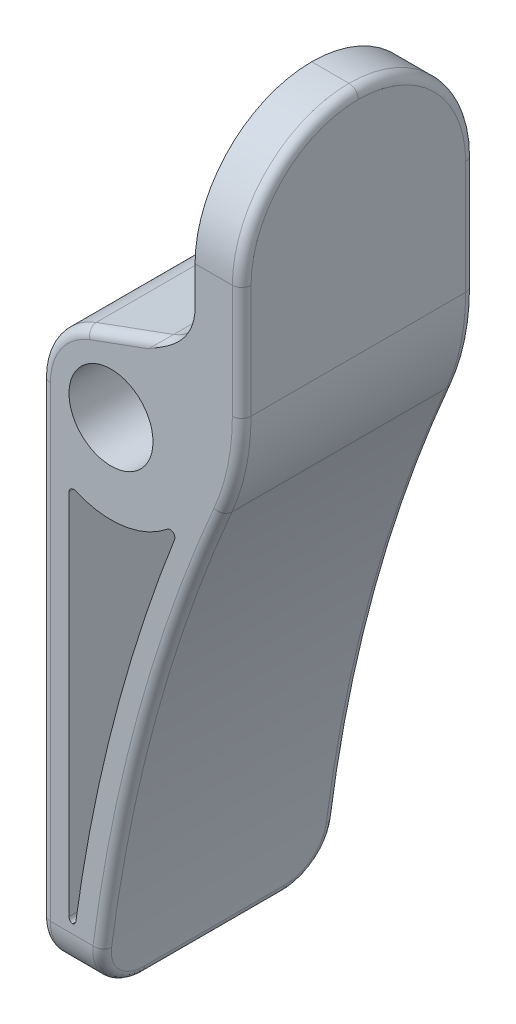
ISO-10303-21;
HEADER;
FILE_DESCRIPTION(('STEP AP214'),'2;1');
FILE_NAME('part.step','',(''),(''),'','','');
FILE_SCHEMA(('AUTOMOTIVE_DESIGN { 1 0 10303 214 1 1 1 1 }'));
ENDSEC;
DATA;
#1=APPLICATION_CONTEXT('core data for automotive mechanical design processes');
#2=APPLICATION_PROTOCOL_DEFINITION('international standard','automotive_design',2000,#1);
#3=PRODUCT_CONTEXT('',#1,'mechanical');
#4=PRODUCT('Part','Part','',(#3));
#5=PRODUCT_RELATED_PRODUCT_CATEGORY('part','',(#4));
#6=PRODUCT_DEFINITION_FORMATION('','',#4);
#7=PRODUCT_DEFINITION_CONTEXT('part definition',#1,'design');
#8=PRODUCT_DEFINITION('design','',#6,#7);
#9=PRODUCT_DEFINITION_SHAPE('','',#8);
#10=(LENGTH_UNIT() NAMED_UNIT(*) SI_UNIT(.MILLI.,.METRE.));
#11=(NAMED_UNIT(*) PLANE_ANGLE_UNIT() SI_UNIT($,.RADIAN.));
#12=(NAMED_UNIT(*) SI_UNIT($,.STERADIAN.) SOLID_ANGLE_UNIT());
#13=UNCERTAINTY_MEASURE_WITH_UNIT(LENGTH_MEASURE(1.E-05),#10,'distance_accuracy_value','');
#14=(GEOMETRIC_REPRESENTATION_CONTEXT(3) GLOBAL_UNCERTAINTY_ASSIGNED_CONTEXT((#13)) GLOBAL_UNIT_ASSIGNED_CONTEXT((#10,
#11,#12)) REPRESENTATION_CONTEXT('',''));
#15=CARTESIAN_POINT('',(0.,0.,0.));
#16=DIRECTION('',(0.,0.,1.));
#17=DIRECTION('',(1.,0.,0.));
#18=AXIS2_PLACEMENT_3D('',#15,#16,#17);
#19=CARTESIAN_POINT('',(152.60613926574,-98.6943628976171,12.5));
#20=DIRECTION('',(0.,0.,1.));
#21=DIRECTION('',(1.,0.,0.));
#22=AXIS2_PLACEMENT_3D('',#19,#20,#21);
#23=PLANE('',#22);
#24=CARTESIAN_POINT('',(-19.9966585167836,-25.9964589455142,12.5));
#25=DIRECTION('',(0.,0.,-1.));
#26=DIRECTION('',(1.,0.,0.));
#27=AXIS2_PLACEMENT_3D('',#24,#25,#26);
#28=CIRCLE('',#27,9.49999999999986);
#29=CARTESIAN_POINT('',(-13.9675030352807,-33.3380721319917,12.5));
#30=VERTEX_POINT('',#29);
#31=CARTESIAN_POINT('',(-23.7966585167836,-34.7033527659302,12.5));
#32=VERTEX_POINT('',#31);
#33=EDGE_CURVE('E1357',#30,#32,#28,.T.);
#34=ORIENTED_EDGE('',*,*,#33,.F.);
#35=CARTESIAN_POINT('',(-13.65017906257,-33.7244728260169,12.5));
#36=DIRECTION('',(0.,0.,1.));
#37=DIRECTION('',(1.,0.,0.));
#38=AXIS2_PLACEMENT_3D('',#35,#36,#37);
#39=CIRCLE('',#38,0.5);
#40=CARTESIAN_POINT('',(-13.1844750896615,-33.9064613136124,12.5));
#41=VERTEX_POINT('',#40);
#42=EDGE_CURVE('E553',#30,#41,#39,.F.);
#43=ORIENTED_EDGE('',*,*,#42,.T.);
#44=CARTESIAN_POINT('',(152.60613926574,-98.6943628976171,12.5));
#45=DIRECTION('',(0.,0.,-1.));
#46=DIRECTION('',(1.,0.,0.));
#47=AXIS2_PLACEMENT_3D('',#44,#45,#46);
#48=CIRCLE('',#47,178.);
#49=CARTESIAN_POINT('',(-23.760913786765,-74.6389560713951,12.5));
#50=VERTEX_POINT('',#49);
#51=EDGE_CURVE('E1346',#50,#41,#48,.T.);
#52=ORIENTED_EDGE('',*,*,#51,.F.);
#53=CARTESIAN_POINT('',(-24.2563268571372,-74.5713847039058,12.5));
#54=DIRECTION('',(0.,0.,1.));
#55=DIRECTION('',(1.,0.,0.));
#56=AXIS2_PLACEMENT_3D('',#53,#54,#55);
#57=CIRCLE('',#56,0.5);
#58=CARTESIAN_POINT('',(-24.1264926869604,-75.0542336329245,12.5));
#59=VERTEX_POINT('',#58);
#60=EDGE_CURVE('E68',#50,#59,#57,.F.);
#61=ORIENTED_EDGE('',*,*,#60,.T.);
#62=CARTESIAN_POINT('',(-23.9966585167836,-74.5713847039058,12.5));
#63=DIRECTION('',(0.,0.,1.));
#64=DIRECTION('',(1.,0.,0.));
#65=AXIS2_PLACEMENT_3D('',#62,#63,#64);
#66=CIRCLE('',#65,0.5);
#67=CARTESIAN_POINT('',(-24.4966585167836,-74.5713847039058,12.5));
#68=VERTEX_POINT('',#67);
#69=EDGE_CURVE('E55',#59,#68,#66,.F.);
#70=ORIENTED_EDGE('',*,*,#69,.T.);
#71=DIRECTION('',(0.,-1.,0.));
#72=VECTOR('',#71,1.);
#73=CARTESIAN_POINT('',(-24.4966585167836,-34.363059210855,12.5));
#74=LINE('',#73,#72);
#75=CARTESIAN_POINT('',(-24.4966585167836,-35.1616103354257,12.5));
#76=VERTEX_POINT('',#75);
#77=EDGE_CURVE('E1352',#76,#68,#74,.T.);
#78=ORIENTED_EDGE('',*,*,#77,.F.);
#79=CARTESIAN_POINT('',(-23.9966585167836,-35.1616103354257,12.5));
#80=DIRECTION('',(0.,0.,1.));
#81=DIRECTION('',(1.,0.,0.));
#82=AXIS2_PLACEMENT_3D('',#79,#80,#81);
#83=CIRCLE('',#82,0.5);
#84=EDGE_CURVE('E547',#76,#32,#83,.F.);
#85=ORIENTED_EDGE('',*,*,#84,.T.);
#86=EDGE_LOOP('',(#34,#43,#52,#61,#70,#78,#85));
#87=FACE_BOUND('',#86,.T.);
#88=DIRECTION('',(1.,0.,0.));
#89=VECTOR('',#88,1.);
#90=CARTESIAN_POINT('',(-21.4966585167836,-75.9964589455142,12.5));
#91=LINE('',#90,#89);
#92=CARTESIAN_POINT('',(-26.4966585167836,-75.9964589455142,12.5));
#93=VERTEX_POINT('',#92);
#94=CARTESIAN_POINT('',(-21.9241021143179,-75.9964589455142,12.5));
#95=VERTEX_POINT('',#94);
#96=EDGE_CURVE('E288',#93,#95,#91,.T.);
#97=ORIENTED_EDGE('',*,*,#96,.T.);
#98=CARTESIAN_POINT('',(152.60613926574,-98.6943628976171,12.5));
#99=DIRECTION('',(0.,0.,1.));
#100=DIRECTION('',(1.,0.,0.));
#101=AXIS2_PLACEMENT_3D('',#98,#99,#100);
#102=CIRCLE('',#101,176.);
#103=CARTESIAN_POINT('',(-8.9575442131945,-28.8862245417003,12.5));
#104=VERTEX_POINT('',#103);
#105=EDGE_CURVE('E584',#95,#104,#102,.F.);
#106=ORIENTED_EDGE('',*,*,#105,.T.);
#107=CARTESIAN_POINT('',(-30.9889555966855,-19.3669329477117,12.5));
#108=DIRECTION('',(0.,0.,1.));
#109=DIRECTION('',(1.,0.,0.));
#110=AXIS2_PLACEMENT_3D('',#107,#108,#109);
#111=CIRCLE('',#110,24.);
#112=CARTESIAN_POINT('',(-6.98895559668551,-19.3669329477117,12.5));
#113=VERTEX_POINT('',#112);
#114=EDGE_CURVE('E593',#104,#113,#111,.T.);
#115=ORIENTED_EDGE('',*,*,#114,.T.);
#116=DIRECTION('',(0.,1.,0.));
#117=VECTOR('',#116,1.);
#118=CARTESIAN_POINT('',(-6.98895559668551,-7.21736724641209,12.5));
#119=LINE('',#118,#117);
#120=CARTESIAN_POINT('',(-6.9889555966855,-7.21736724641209,12.5));
#121=VERTEX_POINT('',#120);
#122=EDGE_CURVE('E1379',#113,#121,#119,.T.);
#123=ORIENTED_EDGE('',*,*,#122,.T.);
#124=DIRECTION('',(-1.,0.,0.));
#125=VECTOR('',#124,1.);
#126=CARTESIAN_POINT('',(-10.9889555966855,-7.21736724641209,12.5));
#127=LINE('',#126,#125);
#128=CARTESIAN_POINT('',(-10.9889555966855,-7.21736724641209,12.5));
#129=VERTEX_POINT('',#128);
#130=EDGE_CURVE('E406',#121,#129,#127,.T.);
#131=ORIENTED_EDGE('',*,*,#130,.T.);
#132=DIRECTION('',(0.,-1.,0.));
#133=VECTOR('',#132,1.);
#134=CARTESIAN_POINT('',(-10.9889555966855,-14.7173672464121,12.5));
#135=LINE('',#134,#133);
#136=CARTESIAN_POINT('',(-10.9889555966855,-11.3111397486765,12.5));
#137=VERTEX_POINT('',#136);
#138=EDGE_CURVE('E1276',#129,#137,#135,.T.);
#139=ORIENTED_EDGE('',*,*,#138,.T.);
#140=CARTESIAN_POINT('',(-10.9889555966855,-11.2217859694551,11.5));
#141=CARTESIAN_POINT('',(-10.9889555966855,-14.7173672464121,11.5));
#142=CARTESIAN_POINT('',(-14.2719721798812,-15.9177382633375,11.5));
#143=CARTESIAN_POINT('',(-10.9889555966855,-11.2217859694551,11.7618979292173));
#144=CARTESIAN_POINT('',(-10.9889555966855,-14.7173672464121,11.599436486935));
#145=CARTESIAN_POINT('',(-14.2719721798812,-15.9177382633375,11.5436496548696));
#146=CARTESIAN_POINT('',(-10.9889555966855,-11.2400842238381,12.0237958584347));
#147=CARTESIAN_POINT('',(-10.9889555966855,-14.7282447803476,11.6989457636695));
#148=CARTESIAN_POINT('',(-14.276890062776,-15.9225861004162,11.5872993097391));
#149=CARTESIAN_POINT('',(-10.9889555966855,-11.3128783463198,12.5431031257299));
#150=CARTESIAN_POINT('',(-10.9889555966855,-14.7712588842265,11.8939878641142));
#151=CARTESIAN_POINT('',(-14.296454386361,-15.9418717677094,11.673850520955));
#152=CARTESIAN_POINT('',(-10.9889555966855,-11.3674557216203,12.8005010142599));
#153=CARTESIAN_POINT('',(-10.9889555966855,-14.8035058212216,11.9896470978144));
#154=CARTESIAN_POINT('',(-14.311122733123,-15.9563311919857,11.7167501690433));
#155=CARTESIAN_POINT('',(-10.9889555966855,-11.5117924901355,13.3064207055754));
#156=CARTESIAN_POINT('',(-10.9889555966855,-14.8880154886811,12.1733159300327));
#157=CARTESIAN_POINT('',(-14.3499150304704,-15.994570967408,11.8010701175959));
#158=CARTESIAN_POINT('',(-10.9889555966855,-11.6017032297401,13.5548992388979));
#159=CARTESIAN_POINT('',(-10.9889555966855,-14.940482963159,12.2613976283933));
#160=CARTESIAN_POINT('',(-14.3740796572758,-16.0183914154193,11.842483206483));
#161=CARTESIAN_POINT('',(-10.9889555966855,-11.8151023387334,14.0387652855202));
#162=CARTESIAN_POINT('',(-10.9889555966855,-15.0634805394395,12.4265088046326));
#163=CARTESIAN_POINT('',(-14.4314333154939,-16.0749281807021,11.9231275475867));
#164=CARTESIAN_POINT('',(-10.9889555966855,-11.9387911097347,14.2740642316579));
#165=CARTESIAN_POINT('',(-10.9889555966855,-15.134280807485,12.503529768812));
#166=CARTESIAN_POINT('',(-14.4646762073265,-16.1076975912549,11.9623440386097));
#167=CARTESIAN_POINT('',(-10.9889555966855,-12.2175879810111,14.7275933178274));
#168=CARTESIAN_POINT('',(-10.9889555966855,-15.2913291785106,12.6434954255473));
#169=CARTESIAN_POINT('',(-14.5396063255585,-16.1815604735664,12.0379322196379));
#170=CARTESIAN_POINT('',(-10.9889555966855,-12.3729199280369,14.9456855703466));
#171=CARTESIAN_POINT('',(-10.9889555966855,-15.3778761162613,12.7063371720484));
#172=CARTESIAN_POINT('',(-14.5813537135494,-16.2227132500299,12.0742809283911));
#173=CARTESIAN_POINT('',(-10.9889555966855,-12.7123308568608,15.361119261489));
#174=CARTESIAN_POINT('',(-10.9889555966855,-15.5632004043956,12.8154042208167));
#175=CARTESIAN_POINT('',(-14.6725746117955,-16.3126348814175,12.1435198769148));
#176=CARTESIAN_POINT('',(-10.9889555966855,-12.8966314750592,15.5582792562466));
#177=CARTESIAN_POINT('',(-10.9889555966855,-15.6622666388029,12.8614319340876));
#178=CARTESIAN_POINT('',(-14.7221076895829,-16.3614624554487,12.1763798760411));
#179=CARTESIAN_POINT('',(-10.9889555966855,-13.290837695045,15.9285160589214));
#180=CARTESIAN_POINT('',(-10.9889555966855,-15.8688811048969,12.934919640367));
#181=CARTESIAN_POINT('',(-14.8280555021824,-16.465901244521,12.2380860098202));
#182=CARTESIAN_POINT('',(-10.9889555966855,-13.5009411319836,16.1013818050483));
#183=CARTESIAN_POINT('',(-10.9889555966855,-15.9766731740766,12.9620996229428));
#184=CARTESIAN_POINT('',(-14.8845234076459,-16.5215648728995,12.2668969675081));
#185=CARTESIAN_POINT('',(-10.9889555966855,-13.9431899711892,16.4200972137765));
#186=CARTESIAN_POINT('',(-10.9889555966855,-16.19654823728,12.9966353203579));
#187=CARTESIAN_POINT('',(-15.0033832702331,-16.638731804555,12.3200162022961));
#188=CARTESIAN_POINT('',(-10.9889555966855,-14.1754946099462,16.5657254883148));
#189=CARTESIAN_POINT('',(-10.9889555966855,-16.3088024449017,13.003650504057));
#190=CARTESIAN_POINT('',(-15.0658180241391,-16.7002772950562,12.3442875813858));
#191=CARTESIAN_POINT('',(-10.9889555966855,-14.6582158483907,16.8274783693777));
#192=CARTESIAN_POINT('',(-10.9889555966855,-16.5330788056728,12.997400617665));
#193=CARTESIAN_POINT('',(-15.1955553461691,-16.8281667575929,12.387913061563));
#194=CARTESIAN_POINT('',(-10.9889555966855,-14.9087462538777,16.9433926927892));
#195=CARTESIAN_POINT('',(-10.9889555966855,-16.6451818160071,12.9837625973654));
#196=CARTESIAN_POINT('',(-15.2628885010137,-16.8945408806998,12.4072321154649));
#197=CARTESIAN_POINT('',(-10.9889555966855,-15.4236817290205,17.1437165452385));
#198=CARTESIAN_POINT('',(-10.9889555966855,-16.8644408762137,12.9366532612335));
#199=CARTESIAN_POINT('',(-15.4012837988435,-17.0309650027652,12.4406194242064));
#200=CARTESIAN_POINT('',(-10.9889555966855,-15.6881561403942,17.2279474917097));
#201=CARTESIAN_POINT('',(-10.9889555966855,-16.9715803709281,12.9028073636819));
#202=CARTESIAN_POINT('',(-15.4723645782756,-17.1010333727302,12.4546579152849));
#203=CARTESIAN_POINT('',(-10.9889555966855,-16.2265005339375,17.3634252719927));
#204=CARTESIAN_POINT('',(-10.9889555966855,-17.1761820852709,12.8167242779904));
#205=CARTESIAN_POINT('',(-15.6170513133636,-17.2436593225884,12.4772375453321));
#206=CARTESIAN_POINT('',(-10.9889555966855,-16.5004030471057,17.4145425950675));
#207=CARTESIAN_POINT('',(-10.9889555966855,-17.2735336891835,12.7641411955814));
#208=CARTESIAN_POINT('',(-15.6906660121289,-17.3162255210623,12.4857570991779));
#209=CARTESIAN_POINT('',(-10.9889555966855,-17.0529536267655,17.4828639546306));
#210=CARTESIAN_POINT('',(-10.9889555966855,-17.4540338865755,12.6430914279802));
#211=CARTESIAN_POINT('',(-15.8391708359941,-17.4626151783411,12.4971439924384));
#212=CARTESIAN_POINT('',(-10.9889555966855,-17.3316100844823,17.5));
#213=CARTESIAN_POINT('',(-10.9889555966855,-17.5369905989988,12.574334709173));
#214=CARTESIAN_POINT('',(-15.9140632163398,-17.5364408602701,12.5));
#215=CARTESIAN_POINT('',(-10.9889555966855,-17.8889229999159,17.5));
#216=CARTESIAN_POINT('',(-10.9889555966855,-17.6846483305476,12.4245434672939));
#217=CARTESIAN_POINT('',(-16.0638479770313,-17.6840922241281,12.5));
#218=CARTESIAN_POINT('',(-10.9889555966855,-18.1675794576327,17.4828639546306));
#219=CARTESIAN_POINT('',(-10.9889555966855,-17.7490970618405,12.3432965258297));
#220=CARTESIAN_POINT('',(-16.138740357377,-17.7579179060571,12.4971439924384));
#221=CARTESIAN_POINT('',(-10.9889555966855,-18.7201300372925,17.4145425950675));
#222=CARTESIAN_POINT('',(-10.9889555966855,-17.8564765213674,12.1731995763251));
#223=CARTESIAN_POINT('',(-16.2872451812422,-17.9043075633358,12.4857570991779));
#224=CARTESIAN_POINT('',(-10.9889555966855,-18.9940325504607,17.3634252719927));
#225=CARTESIAN_POINT('',(-10.9889555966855,-17.8991217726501,12.084229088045));
#226=CARTESIAN_POINT('',(-16.3608598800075,-17.9768737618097,12.4772375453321));
#227=CARTESIAN_POINT('',(-10.9889555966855,-19.5323769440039,17.2279474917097));
#228=CARTESIAN_POINT('',(-10.9889555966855,-17.9607798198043,11.9043077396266));
#229=CARTESIAN_POINT('',(-16.5055466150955,-18.119499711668,12.4546579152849));
#230=CARTESIAN_POINT('',(-10.9889555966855,-19.7968513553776,17.1437165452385));
#231=CARTESIAN_POINT('',(-10.9889555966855,-17.9795053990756,11.8133333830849));
#232=CARTESIAN_POINT('',(-16.5766273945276,-18.189568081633,12.4406194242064));
#233=CARTESIAN_POINT('',(-10.9889555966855,-20.3117868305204,16.9433926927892));
#234=CARTESIAN_POINT('',(-10.9889555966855,-17.9927313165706,11.6357272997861));
#235=CARTESIAN_POINT('',(-16.7150226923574,-18.3259922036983,12.4072321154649));
#236=CARTESIAN_POINT('',(-10.9889555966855,-20.5623172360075,16.8274783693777));
#237=CARTESIAN_POINT('',(-10.9889555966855,-17.9869755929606,11.5491632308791));
#238=CARTESIAN_POINT('',(-16.782355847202,-18.3923663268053,12.387913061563));
#239=CARTESIAN_POINT('',(-10.9889555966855,-21.045038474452,16.5657254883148));
#240=CARTESIAN_POINT('',(-10.9889555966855,-17.9525120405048,11.3869937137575));
#241=CARTESIAN_POINT('',(-16.912093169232,-18.520255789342,12.3442875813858));
#242=CARTESIAN_POINT('',(-10.9889555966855,-21.277343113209,16.4200972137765));
#243=CARTESIAN_POINT('',(-10.9889555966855,-17.9236099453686,11.3115293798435));
#244=CARTESIAN_POINT('',(-16.974527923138,-18.5818012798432,12.3200162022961));
#245=CARTESIAN_POINT('',(-10.9889555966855,-21.7195919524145,16.1013818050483));
#246=CARTESIAN_POINT('',(-10.9889555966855,-17.846234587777,11.1778829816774));
#247=CARTESIAN_POINT('',(-17.0933877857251,-18.6989682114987,12.2668969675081));
#248=CARTESIAN_POINT('',(-10.9889555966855,-21.9296953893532,15.9285160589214));
#249=CARTESIAN_POINT('',(-10.9889555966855,-17.7976525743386,11.1198862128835));
#250=CARTESIAN_POINT('',(-17.1498556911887,-18.7546318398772,12.2380860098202));
#251=CARTESIAN_POINT('',(-10.9889555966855,-22.323901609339,15.5582792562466));
#252=CARTESIAN_POINT('',(-10.9889555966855,-17.686448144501,11.0264586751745));
#253=CARTESIAN_POINT('',(-17.2558035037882,-18.8590706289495,12.1763798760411));
#254=CARTESIAN_POINT('',(-10.9889555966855,-22.5082022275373,15.361119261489));
#255=CARTESIAN_POINT('',(-10.9889555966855,-17.6238140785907,10.9912189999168));
#256=CARTESIAN_POINT('',(-17.3053365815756,-18.9078982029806,12.1435198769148));
#257=CARTESIAN_POINT('',(-10.9889555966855,-22.8476131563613,14.9456855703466));
#258=CARTESIAN_POINT('',(-10.9889555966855,-17.4919224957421,10.9467117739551));
#259=CARTESIAN_POINT('',(-17.3965574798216,-18.9978198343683,12.0742809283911));
#260=CARTESIAN_POINT('',(-10.9889555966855,-23.0029451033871,14.7275933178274));
#261=CARTESIAN_POINT('',(-10.9889555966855,-17.4227452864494,10.9375990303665));
#262=CARTESIAN_POINT('',(-17.4383048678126,-19.0389726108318,12.0379322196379));
#263=CARTESIAN_POINT('',(-10.9889555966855,-23.2817419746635,14.2740642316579));
#264=CARTESIAN_POINT('',(-10.9889555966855,-17.2864224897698,10.9460892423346));
#265=CARTESIAN_POINT('',(-17.5132349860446,-19.1128354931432,11.9623440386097));
#266=CARTESIAN_POINT('',(-10.9889555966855,-23.4054307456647,14.0387652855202));
#267=CARTESIAN_POINT('',(-10.9889555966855,-17.2194252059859,10.963773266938));
#268=CARTESIAN_POINT('',(-17.5464778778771,-19.1456049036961,11.9231275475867));
#269=CARTESIAN_POINT('',(-10.9889555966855,-23.618829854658,13.5548992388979));
#270=CARTESIAN_POINT('',(-10.9889555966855,-17.0963217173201,11.0234090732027));
#271=CARTESIAN_POINT('',(-17.6038315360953,-19.2021416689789,11.842483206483));
#272=CARTESIAN_POINT('',(-10.9889555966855,-23.7087405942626,13.3064207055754));
#273=CARTESIAN_POINT('',(-10.9889555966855,-17.0403915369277,11.065345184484));
#274=CARTESIAN_POINT('',(-17.6279961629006,-19.2259621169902,11.8010701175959));
#275=CARTESIAN_POINT('',(-10.9889555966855,-23.8530773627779,12.8005010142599));
#276=CARTESIAN_POINT('',(-10.9889555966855,-16.9471889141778,11.1677867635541));
#277=CARTESIAN_POINT('',(-17.666788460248,-19.2642018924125,11.7167501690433));
#278=CARTESIAN_POINT('',(-10.9889555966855,-23.9076547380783,12.5431031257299));
#279=CARTESIAN_POINT('',(-10.9889555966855,-16.9100718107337,11.2281794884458));
#280=CARTESIAN_POINT('',(-17.68145680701,-19.2786613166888,11.673850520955));
#281=CARTESIAN_POINT('',(-10.9889555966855,-23.98044886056,12.0237958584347));
#282=CARTESIAN_POINT('',(-10.9889555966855,-16.8598623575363,11.3591360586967));
#283=CARTESIAN_POINT('',(-17.7010211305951,-19.297946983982,11.5872993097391));
#284=CARTESIAN_POINT('',(-10.9889555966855,-23.9987471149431,11.7618979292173));
#285=CARTESIAN_POINT('',(-10.9889555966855,-16.84686077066,11.4295152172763));
#286=CARTESIAN_POINT('',(-17.7059390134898,-19.3027948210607,11.5436496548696));
#287=CARTESIAN_POINT('',(-10.9889555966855,-23.9987471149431,11.2381020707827));
#288=CARTESIAN_POINT('',(-10.9889555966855,-16.84686077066,11.5704847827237));
#289=CARTESIAN_POINT('',(-17.7059390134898,-19.3027948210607,11.4563503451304));
#290=CARTESIAN_POINT('',(-10.9889555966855,-23.98044886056,10.9762041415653));
#291=CARTESIAN_POINT('',(-10.9889555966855,-16.8598623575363,11.6408639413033));
#292=CARTESIAN_POINT('',(-17.7010211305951,-19.297946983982,11.4127006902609));
#293=CARTESIAN_POINT('',(-10.9889555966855,-23.9076547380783,10.4568968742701));
#294=CARTESIAN_POINT('',(-10.9889555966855,-16.9100718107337,11.7718205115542));
#295=CARTESIAN_POINT('',(-17.68145680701,-19.2786613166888,11.326149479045));
#296=CARTESIAN_POINT('',(-10.9889555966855,-23.8530773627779,10.1994989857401));
#297=CARTESIAN_POINT('',(-10.9889555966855,-16.9471889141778,11.8322132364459));
#298=CARTESIAN_POINT('',(-17.666788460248,-19.2642018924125,11.2832498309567));
#299=CARTESIAN_POINT('',(-10.9889555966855,-23.7087405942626,9.69357929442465));
#300=CARTESIAN_POINT('',(-10.9889555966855,-17.0403915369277,11.934654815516));
#301=CARTESIAN_POINT('',(-17.6279961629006,-19.2259621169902,11.1989298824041));
#302=CARTESIAN_POINT('',(-10.9889555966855,-23.618829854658,9.44510076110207));
#303=CARTESIAN_POINT('',(-10.9889555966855,-17.09632171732,11.9765909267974));
#304=CARTESIAN_POINT('',(-17.6038315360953,-19.2021416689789,11.157516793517));
#305=CARTESIAN_POINT('',(-10.9889555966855,-23.4054307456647,8.9612347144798));
#306=CARTESIAN_POINT('',(-10.9889555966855,-17.2194252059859,12.036226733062));
#307=CARTESIAN_POINT('',(-17.5464778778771,-19.1456049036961,11.0768724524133));
#308=CARTESIAN_POINT('',(-10.9889555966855,-23.2817419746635,8.72593576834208));
#309=CARTESIAN_POINT('',(-10.9889555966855,-17.2864224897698,12.0539107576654));
#310=CARTESIAN_POINT('',(-17.5132349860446,-19.1128354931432,11.0376559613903));
#311=CARTESIAN_POINT('',(-10.9889555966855,-23.0029451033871,8.2724066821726));
#312=CARTESIAN_POINT('',(-10.9889555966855,-17.4227452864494,12.0624009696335));
#313=CARTESIAN_POINT('',(-17.4383048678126,-19.0389726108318,10.9620677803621));
#314=CARTESIAN_POINT('',(-10.9889555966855,-22.8476131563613,8.05431442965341));
#315=CARTESIAN_POINT('',(-10.9889555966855,-17.4919224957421,12.0532882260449));
#316=CARTESIAN_POINT('',(-17.3965574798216,-18.9978198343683,10.9257190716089));
#317=CARTESIAN_POINT('',(-10.9889555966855,-22.5082022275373,7.63888073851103));
#318=CARTESIAN_POINT('',(-10.9889555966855,-17.6238140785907,12.0087810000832));
#319=CARTESIAN_POINT('',(-17.3053365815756,-18.9078982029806,10.8564801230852));
#320=CARTESIAN_POINT('',(-10.9889555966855,-22.323901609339,7.44172074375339));
#321=CARTESIAN_POINT('',(-10.9889555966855,-17.686448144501,11.9735413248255));
#322=CARTESIAN_POINT('',(-17.2558035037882,-18.8590706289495,10.8236201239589));
#323=CARTESIAN_POINT('',(-10.9889555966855,-21.9296953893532,7.07148394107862));
#324=CARTESIAN_POINT('',(-10.9889555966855,-17.7976525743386,11.8801137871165));
#325=CARTESIAN_POINT('',(-17.1498556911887,-18.7546318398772,10.7619139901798));
#326=CARTESIAN_POINT('',(-10.9889555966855,-21.7195919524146,6.89861819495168));
#327=CARTESIAN_POINT('',(-10.9889555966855,-17.846234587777,11.8221170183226));
#328=CARTESIAN_POINT('',(-17.0933877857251,-18.6989682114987,10.7331030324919));
#329=CARTESIAN_POINT('',(-10.9889555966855,-21.277343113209,6.57990278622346));
#330=CARTESIAN_POINT('',(-10.9889555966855,-17.9236099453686,11.6884706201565));
#331=CARTESIAN_POINT('',(-16.974527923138,-18.5818012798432,10.6799837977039));
#332=CARTESIAN_POINT('',(-10.9889555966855,-21.045038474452,6.43427451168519));
#333=CARTESIAN_POINT('',(-10.9889555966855,-17.9525120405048,11.6130062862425));
#334=CARTESIAN_POINT('',(-16.912093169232,-18.520255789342,10.6557124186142));
#335=CARTESIAN_POINT('',(-10.9889555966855,-20.5623172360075,6.17252163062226));
#336=CARTESIAN_POINT('',(-10.9889555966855,-17.9869755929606,11.4508367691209));
#337=CARTESIAN_POINT('',(-16.782355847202,-18.3923663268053,10.612086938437));
#338=CARTESIAN_POINT('',(-10.9889555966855,-20.3117868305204,6.05660730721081));
#339=CARTESIAN_POINT('',(-10.9889555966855,-17.9927313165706,11.3642727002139));
#340=CARTESIAN_POINT('',(-16.7150226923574,-18.3259922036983,10.5927678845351));
#341=CARTESIAN_POINT('',(-10.9889555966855,-19.7968513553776,5.85628345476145));
#342=CARTESIAN_POINT('',(-10.9889555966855,-17.9795053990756,11.1866666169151));
#343=CARTESIAN_POINT('',(-16.5766273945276,-18.189568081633,10.5593805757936));
#344=CARTESIAN_POINT('',(-10.9889555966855,-19.5323769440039,5.77205250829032));
#345=CARTESIAN_POINT('',(-10.9889555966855,-17.9607798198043,11.0956922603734));
#346=CARTESIAN_POINT('',(-16.5055466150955,-18.119499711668,10.5453420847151));
#347=CARTESIAN_POINT('',(-10.9889555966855,-18.9940325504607,5.63657472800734));
#348=CARTESIAN_POINT('',(-10.9889555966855,-17.8991217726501,10.915770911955));
#349=CARTESIAN_POINT('',(-16.3608598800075,-17.9768737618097,10.5227624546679));
#350=CARTESIAN_POINT('',(-10.9889555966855,-18.7201300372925,5.58545740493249));
#351=CARTESIAN_POINT('',(-10.9889555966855,-17.8564765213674,10.8268004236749));
#352=CARTESIAN_POINT('',(-16.2872451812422,-17.9043075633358,10.5142429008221));
#353=CARTESIAN_POINT('',(-10.9889555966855,-18.1675794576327,5.51713604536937));
#354=CARTESIAN_POINT('',(-10.9889555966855,-17.7490970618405,10.6567034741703));
#355=CARTESIAN_POINT('',(-16.138740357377,-17.7579179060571,10.5028560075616));
#356=CARTESIAN_POINT('',(-10.9889555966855,-17.8889229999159,5.5));
#357=CARTESIAN_POINT('',(-10.9889555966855,-17.6846483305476,10.5754565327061));
#358=CARTESIAN_POINT('',(-16.0638479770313,-17.6840922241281,10.5));
#359=CARTESIAN_POINT('',(-10.9889555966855,-17.3316100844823,5.5));
#360=CARTESIAN_POINT('',(-10.9889555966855,-17.5369905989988,10.425665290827));
#361=CARTESIAN_POINT('',(-15.9140632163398,-17.5364408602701,10.5));
#362=CARTESIAN_POINT('',(-10.9889555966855,-17.0529536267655,5.51713604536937));
#363=CARTESIAN_POINT('',(-10.9889555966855,-17.4540338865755,10.3569085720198));
#364=CARTESIAN_POINT('',(-15.8391708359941,-17.4626151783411,10.5028560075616));
#365=CARTESIAN_POINT('',(-10.9889555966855,-16.5004030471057,5.58545740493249));
#366=CARTESIAN_POINT('',(-10.9889555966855,-17.2735336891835,10.2358588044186));
#367=CARTESIAN_POINT('',(-15.6906660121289,-17.3162255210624,10.5142429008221));
#368=CARTESIAN_POINT('',(-10.9889555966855,-16.2265005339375,5.63657472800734));
#369=CARTESIAN_POINT('',(-10.9889555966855,-17.1761820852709,10.1832757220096));
#370=CARTESIAN_POINT('',(-15.6170513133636,-17.2436593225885,10.5227624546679));
#371=CARTESIAN_POINT('',(-10.9889555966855,-15.6881561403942,5.77205250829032));
#372=CARTESIAN_POINT('',(-10.9889555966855,-16.9715803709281,10.0971926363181));
#373=CARTESIAN_POINT('',(-15.4723645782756,-17.1010333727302,10.5453420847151));
#374=CARTESIAN_POINT('',(-10.9889555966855,-15.4236817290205,5.85628345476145));
#375=CARTESIAN_POINT('',(-10.9889555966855,-16.8644408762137,10.0633467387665));
#376=CARTESIAN_POINT('',(-15.4012837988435,-17.0309650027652,10.5593805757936));
#377=CARTESIAN_POINT('',(-10.9889555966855,-14.9087462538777,6.05660730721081));
#378=CARTESIAN_POINT('',(-10.9889555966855,-16.6451818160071,10.0162374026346));
#379=CARTESIAN_POINT('',(-15.2628885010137,-16.8945408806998,10.5927678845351));
#380=CARTESIAN_POINT('',(-10.9889555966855,-14.6582158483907,6.17252163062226));
#381=CARTESIAN_POINT('',(-10.9889555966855,-16.5330788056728,10.002599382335));
#382=CARTESIAN_POINT('',(-15.1955553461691,-16.8281667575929,10.612086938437));
#383=CARTESIAN_POINT('',(-10.9889555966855,-14.1754946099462,6.43427451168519));
#384=CARTESIAN_POINT('',(-10.9889555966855,-16.3088024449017,9.99634949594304));
#385=CARTESIAN_POINT('',(-15.0658180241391,-16.7002772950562,10.6557124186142));
#386=CARTESIAN_POINT('',(-10.9889555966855,-13.9431899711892,6.57990278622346));
#387=CARTESIAN_POINT('',(-10.9889555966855,-16.19654823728,10.0033646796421));
#388=CARTESIAN_POINT('',(-15.0033832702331,-16.638731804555,10.6799837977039));
#389=CARTESIAN_POINT('',(-10.9889555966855,-13.5009411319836,6.89861819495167));
#390=CARTESIAN_POINT('',(-10.9889555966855,-15.9766731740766,10.0379003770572));
#391=CARTESIAN_POINT('',(-14.8845234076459,-16.5215648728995,10.7331030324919));
#392=CARTESIAN_POINT('',(-10.9889555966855,-13.290837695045,7.07148394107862));
#393=CARTESIAN_POINT('',(-10.9889555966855,-15.8688811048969,10.065080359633));
#394=CARTESIAN_POINT('',(-14.8280555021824,-16.465901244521,10.7619139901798));
#395=CARTESIAN_POINT('',(-10.9889555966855,-12.8966314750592,7.44172074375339));
#396=CARTESIAN_POINT('',(-10.9889555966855,-15.6622666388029,10.1385680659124));
#397=CARTESIAN_POINT('',(-14.7221076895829,-16.3614624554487,10.8236201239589));
#398=CARTESIAN_POINT('',(-10.9889555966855,-12.7123308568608,7.63888073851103));
#399=CARTESIAN_POINT('',(-10.9889555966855,-15.5632004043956,10.1845957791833));
#400=CARTESIAN_POINT('',(-14.6725746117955,-16.3126348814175,10.8564801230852));
#401=CARTESIAN_POINT('',(-10.9889555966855,-12.3729199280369,8.05431442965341));
#402=CARTESIAN_POINT('',(-10.9889555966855,-15.3778761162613,10.2936628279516));
#403=CARTESIAN_POINT('',(-14.5813537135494,-16.2227132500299,10.9257190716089));
#404=CARTESIAN_POINT('',(-10.9889555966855,-12.2175879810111,8.27240668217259));
#405=CARTESIAN_POINT('',(-10.9889555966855,-15.2913291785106,10.3565045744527));
#406=CARTESIAN_POINT('',(-14.5396063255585,-16.1815604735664,10.9620677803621));
#407=CARTESIAN_POINT('',(-10.9889555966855,-11.9387911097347,8.72593576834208));
#408=CARTESIAN_POINT('',(-10.9889555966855,-15.134280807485,10.496470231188));
#409=CARTESIAN_POINT('',(-14.4646762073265,-16.107697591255,11.0376559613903));
#410=CARTESIAN_POINT('',(-10.9889555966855,-11.8151023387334,8.9612347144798));
#411=CARTESIAN_POINT('',(-10.9889555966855,-15.0634805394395,10.5734911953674));
#412=CARTESIAN_POINT('',(-14.4314333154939,-16.0749281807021,11.0768724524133));
#413=CARTESIAN_POINT('',(-10.9889555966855,-11.6017032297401,9.44510076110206));
#414=CARTESIAN_POINT('',(-10.9889555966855,-14.940482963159,10.7386023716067));
#415=CARTESIAN_POINT('',(-14.3740796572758,-16.0183914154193,11.157516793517));
#416=CARTESIAN_POINT('',(-10.9889555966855,-11.5117924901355,9.69357929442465));
#417=CARTESIAN_POINT('',(-10.9889555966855,-14.8880154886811,10.8266840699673));
#418=CARTESIAN_POINT('',(-14.3499150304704,-15.994570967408,11.1989298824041));
#419=CARTESIAN_POINT('',(-10.9889555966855,-11.3674557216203,10.1994989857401));
#420=CARTESIAN_POINT('',(-10.9889555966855,-14.8035058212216,11.0103529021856));
#421=CARTESIAN_POINT('',(-14.311122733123,-15.9563311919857,11.2832498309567));
#422=CARTESIAN_POINT('',(-10.9889555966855,-11.3128783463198,10.4568968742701));
#423=CARTESIAN_POINT('',(-10.9889555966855,-14.7712588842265,11.1060121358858));
#424=CARTESIAN_POINT('',(-14.296454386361,-15.9418717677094,11.326149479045));
#425=CARTESIAN_POINT('',(-10.9889555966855,-11.2400842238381,10.9762041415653));
#426=CARTESIAN_POINT('',(-10.9889555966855,-14.7282447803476,11.3010542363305));
#427=CARTESIAN_POINT('',(-14.276890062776,-15.9225861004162,11.4127006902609));
#428=CARTESIAN_POINT('',(-10.9889555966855,-11.2217859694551,11.2381020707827));
#429=CARTESIAN_POINT('',(-10.9889555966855,-14.7173672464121,11.400563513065));
#430=CARTESIAN_POINT('',(-14.2719721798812,-15.9177382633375,11.4563503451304));
#431=CARTESIAN_POINT('',(-10.9889555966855,-11.2217859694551,11.5));
#432=CARTESIAN_POINT('',(-10.9889555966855,-14.7173672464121,11.5));
#433=CARTESIAN_POINT('',(-14.2719721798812,-15.9177382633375,11.5));
#434=(BOUNDED_SURFACE() B_SPLINE_SURFACE(3,2,((#140,#141,#142),(#143,#144,#145),(#146,#147,
#148),(#149,#150,#151),(#152,#153,#154),(#155,#156,#157),(#158,#159,#160),(#161,#162,#163),
(#164,#165,#166),(#167,#168,#169),(#170,#171,#172),(#173,#174,#175),(#176,#177,#178),(#179,#180,
#181),(#182,#183,#184),(#185,#186,#187),(#188,#189,#190),(#191,#192,#193),(#194,#195,#196),
(#197,#198,#199),(#200,#201,#202),(#203,#204,#205),(#206,#207,#208),(#209,#210,#211),(#212,#213,
#214),(#215,#216,#217),(#218,#219,#220),(#221,#222,#223),(#224,#225,#226),(#227,#228,#229),
(#230,#231,#232),(#233,#234,#235),(#236,#237,#238),(#239,#240,#241),(#242,#243,#244),(#245,#246,
#247),(#248,#249,#250),(#251,#252,#253),(#254,#255,#256),(#257,#258,#259),(#260,#261,#262),
(#263,#264,#265),(#266,#267,#268),(#269,#270,#271),(#272,#273,#274),(#275,#276,#277),(#278,#279,
#280),(#281,#282,#283),(#284,#285,#286),(#287,#288,#289),(#290,#291,#292),(#293,#294,#295),
(#296,#297,#298),(#299,#300,#301),(#302,#303,#304),(#305,#306,#307),(#308,#309,#310),(#311,#312,
#313),(#314,#315,#316),(#317,#318,#319),(#320,#321,#322),(#323,#324,#325),(#326,#327,#328),
(#329,#330,#331),(#332,#333,#334),(#335,#336,#337),(#338,#339,#340),(#341,#342,#343),(#344,#345,
#346),(#347,#348,#349),(#350,#351,#352),(#353,#354,#355),(#356,#357,#358),(#359,#360,#361),
(#362,#363,#364),(#365,#366,#367),(#368,#369,#370),(#371,#372,#373),(#374,#375,#376),(#377,#378,
#379),(#380,#381,#382),(#383,#384,#385),(#386,#387,#388),(#389,#390,#391),(#392,#393,#394),
(#395,#396,#397),(#398,#399,#400),(#401,#402,#403),(#404,#405,#406),(#407,#408,#409),(#410,#411,
#412),(#413,#414,#415),(#416,#417,#418),(#419,#420,#421),(#422,#423,#424),(#425,#426,#427),
(#428,#429,#430),(#431,#432,#433)),.UNSPECIFIED.,.T.,.F.,.F.) B_SPLINE_SURFACE_WITH_KNOTS((4,2,
2,2,2,2,2,2,2,2,2,2,2,2,2,2,2,2,2,2,2,2,2,2,2,2,2,2,2,2,2,2,2,2,2,2,2,2,2,2,2,2,2,2,2,2,2,2,4),
(3,3),(0.,0.785061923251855,1.57189360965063,2.3621329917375,3.15716664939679,3.95803297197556,
4.76535507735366,5.57930675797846,6.39961124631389,7.22556996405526,8.05611679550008,
8.88989267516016,9.72533513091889,10.5607775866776,11.3945534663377,12.2251002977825,
13.0510590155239,13.8713635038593,14.6853151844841,15.4926372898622,16.293503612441,
17.0885372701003,17.8787766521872,18.6656083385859,19.4506702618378,20.2357321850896,
21.0225638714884,21.8128032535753,22.6078369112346,23.4087032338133,24.2160253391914,
25.0299770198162,25.8502815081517,26.676240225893,27.5067870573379,28.3405629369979,
29.1760053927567,30.0114478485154,30.8452237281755,31.6757705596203,32.5017292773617,
33.3220337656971,34.1359854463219,34.9433075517,35.7441738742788,36.5392075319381,
37.3294469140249,38.1162786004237,38.9013405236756),(0.,1.),
.UNSPECIFIED.) GEOMETRIC_REPRESENTATION_ITEM() RATIONAL_B_SPLINE_SURFACE(((1.,0.81957204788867,
1.),(1.,0.81957204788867,1.),(1.,0.819272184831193,1.),(1.,0.818077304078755,1.),(1.,
0.817180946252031,1.),(1.,0.814803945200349,1.),(1.,0.813320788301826,1.),(1.,0.809787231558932,
1.),(1.,0.807733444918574,1.),(1.,0.803081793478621,1.),(1.,0.800480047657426,1.),(1.,
0.794761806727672,1.),(1.,0.791641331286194,1.),(1.,0.784921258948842,1.),(1.,0.781317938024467,
1.),(1.,0.773674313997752,1.),(1.,0.76963081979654,1.),(1.,0.761155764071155,1.),(1.,
0.756721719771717,1.),(1.,0.747521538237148,1.),(1.,0.742753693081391,1.),(1.,0.732949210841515,
1.),(1.,0.727911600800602,1.),(1.,0.717638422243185,1.),(1.,0.712402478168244,1.),(1.,
0.701811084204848,1.),(1.,0.696455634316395,1.),(1.,0.685711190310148,1.),(1.,0.680322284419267,
1.),(1.,0.669603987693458,1.),(1.,0.664274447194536,1.),(1.,0.653774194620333,1.),(1.,
0.648602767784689,1.),(1.,0.638522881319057,1.),(1.,0.63361286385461,1.),(1.,0.624162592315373,
1.),(1.,0.619619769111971,1.),(1.,0.611010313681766,1.),(1.,0.606940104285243,1.),(1.,
0.599378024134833,1.),(1.,0.595881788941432,1.),(1.,0.589560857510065,1.),(1.,0.586731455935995,
1.),(1.,0.581823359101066,1.),(1.,0.579740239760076,1.),(1.,0.576384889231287,1.),(1.,
0.57510920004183,1.),(1.,0.573405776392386,1.),(1.,0.572976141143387,1.),(1.,0.572976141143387,
1.),(1.,0.573405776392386,1.),(1.,0.57510920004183,1.),(1.,0.576384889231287,1.),(1.,
0.579740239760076,1.),(1.,0.581823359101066,1.),(1.,0.586731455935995,1.),(1.,0.589560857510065,
1.),(1.,0.595881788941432,1.),(1.,0.599378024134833,1.),(1.,0.606940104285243,1.),(1.,
0.611010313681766,1.),(1.,0.619619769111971,1.),(1.,0.624162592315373,1.),(1.,0.63361286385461,
1.),(1.,0.638522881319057,1.),(1.,0.648602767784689,1.),(1.,0.653774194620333,1.),(1.,
0.664274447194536,1.),(1.,0.669603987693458,1.),(1.,0.680322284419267,1.),(1.,0.685711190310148,
1.),(1.,0.696455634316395,1.),(1.,0.701811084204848,1.),(1.,0.712402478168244,1.),(1.,
0.717638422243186,1.),(1.,0.727911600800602,1.),(1.,0.732949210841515,1.),(1.,0.742753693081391,
1.),(1.,0.747521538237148,1.),(1.,0.756721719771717,1.),(1.,0.761155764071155,1.),(1.,
0.76963081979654,1.),(1.,0.773674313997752,1.),(1.,0.781317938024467,1.),(1.,0.784921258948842,
1.),(1.,0.791641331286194,1.),(1.,0.794761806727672,1.),(1.,0.800480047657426,1.),(1.,
0.803081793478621,1.),(1.,0.807733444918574,1.),(1.,0.809787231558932,1.),(1.,0.813320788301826,
1.),(1.,0.814803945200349,1.),(1.,0.817180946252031,1.),(1.,0.818077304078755,1.),(1.,
0.819272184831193,1.),(1.,0.81957204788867,1.),(1.,0.81957204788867,1.))) REPRESENTATION_ITEM('') SURFACE());
#435=CARTESIAN_POINT('',(-10.9889555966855,-11.3111397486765,12.5));
#436=CARTESIAN_POINT('',(-10.9889333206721,-11.46186575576,12.5));
#437=CARTESIAN_POINT('',(-10.9955554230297,-11.6125769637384,12.5));
#438=CARTESIAN_POINT('',(-11.0218247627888,-11.9128140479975,12.5));
#439=CARTESIAN_POINT('',(-11.0414678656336,-12.0623402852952,12.5));
#440=CARTESIAN_POINT('',(-11.09343439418,-12.3586839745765,12.5));
#441=CARTESIAN_POINT('',(-11.1257179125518,-12.5055084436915,12.5));
#442=CARTESIAN_POINT('',(-11.2025596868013,-12.7959112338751,12.5));
#443=CARTESIAN_POINT('',(-11.2471185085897,-12.9394894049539,12.5));
#444=CARTESIAN_POINT('',(-11.3479297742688,-13.2222858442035,12.5));
#445=CARTESIAN_POINT('',(-11.4041686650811,-13.3615089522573,12.5));
#446=CARTESIAN_POINT('',(-11.5277574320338,-13.6349880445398,12.5));
#447=CARTESIAN_POINT('',(-11.5951116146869,-13.769242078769,12.5));
#448=CARTESIAN_POINT('',(-11.7401240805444,-14.0319430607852,12.5));
#449=CARTESIAN_POINT('',(-11.8177757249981,-14.1603936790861,12.5));
#450=CARTESIAN_POINT('',(-11.9825367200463,-14.4110131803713,12.5));
#451=CARTESIAN_POINT('',(-12.0696441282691,-14.5331833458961,12.5));
#452=CARTESIAN_POINT('',(-12.2915571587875,-14.8218941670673,12.5));
#453=CARTESIAN_POINT('',(-12.43081314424,-14.9850283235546,12.5));
#454=CARTESIAN_POINT('',(-12.7237389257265,-15.2977771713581,12.5));
#455=CARTESIAN_POINT('',(-12.8774151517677,-15.4473857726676,12.5));
#456=CARTESIAN_POINT('',(-13.1963969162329,-15.7345535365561,12.5));
#457=CARTESIAN_POINT('',(-13.361736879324,-15.8720740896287,12.5));
#458=CARTESIAN_POINT('',(-13.7004717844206,-16.1366697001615,12.5));
#459=CARTESIAN_POINT('',(-13.8738666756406,-16.263744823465,12.5));
#460=CARTESIAN_POINT('',(-14.3007232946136,-16.5625093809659,12.5));
#461=CARTESIAN_POINT('',(-14.556925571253,-16.730236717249,12.5));
#462=CARTESIAN_POINT('',(-15.0740322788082,-17.0571399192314,12.5));
#463=CARTESIAN_POINT('',(-15.3349286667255,-17.2163288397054,12.5));
#464=CARTESIAN_POINT('',(-15.7232073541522,-17.4507064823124,12.5));
#465=CARTESIAN_POINT('',(-15.8500153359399,-17.5268529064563,12.5));
#466=CARTESIAN_POINT('',(-15.9808723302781,-17.6054137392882,12.5));
#467=CARTESIAN_POINT('',(-15.9849139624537,-17.607840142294,12.5));
#468=CARTESIAN_POINT('',(-15.9889555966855,-17.6102665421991,12.5));
#469=B_SPLINE_CURVE_WITH_KNOTS('',3,(#435,#436,#437,#438,#439,#440,#441,#442,#443,#444,#445,
#446,#447,#448,#449,#450,#451,#452,#453,#454,#455,#456,#457,#458,#459,#460,#461,#462,#463,#464,
#465,#466,#467,#468),.UNSPECIFIED.,.F.,.F.,(4,2,2,2,2,2,2,2,2,2,2,2,2,2,2,2,4),(0.,
0.45201067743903,0.903877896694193,1.35432987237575,1.80480261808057,2.25475554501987,
2.70488321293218,3.1547220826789,3.60446872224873,4.24683719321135,4.88949347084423,
5.53413299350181,6.17876845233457,7.09707105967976,8.01392707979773,8.45766946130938,
8.47181159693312),.UNSPECIFIED.);
#470=CARTESIAN_POINT('',(-15.9889555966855,-17.6102665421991,12.5));
#471=VERTEX_POINT('',#470);
#472=EDGE_CURVE('E326',#137,#471,#469,.T.);
#473=ORIENTED_EDGE('',*,*,#472,.T.);
#474=DIRECTION('',(-0.939190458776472,-0.343396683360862,0.));
#475=VECTOR('',#474,1.);
#476=CARTESIAN_POINT('',(-22.2287369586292,-19.8917209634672,12.5));
#477=LINE('',#476,#475);
#478=CARTESIAN_POINT('',(-22.2287369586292,-19.8917209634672,12.5));
#479=VERTEX_POINT('',#478);
#480=EDGE_CURVE('E758',#471,#479,#477,.T.);
#481=ORIENTED_EDGE('',*,*,#480,.T.);
#482=CARTESIAN_POINT('',(-19.9966585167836,-25.9964589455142,12.5));
#483=DIRECTION('',(0.,0.,1.));
#484=DIRECTION('',(1.,0.,0.));
#485=AXIS2_PLACEMENT_3D('',#482,#483,#484);
#486=CIRCLE('',#485,6.5);
#487=CARTESIAN_POINT('',(-26.4966585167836,-25.9964589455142,12.5));
#488=VERTEX_POINT('',#487);
#489=EDGE_CURVE('E291',#479,#488,#486,.T.);
#490=ORIENTED_EDGE('',*,*,#489,.T.);
#491=DIRECTION('',(0.,-1.,0.));
#492=VECTOR('',#491,1.);
#493=CARTESIAN_POINT('',(-26.4966585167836,-75.9964589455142,12.5));
#494=LINE('',#493,#492);
#495=EDGE_CURVE('E753',#488,#93,#494,.T.);
#496=ORIENTED_EDGE('',*,*,#495,.T.);
#497=EDGE_LOOP('',(#97,#106,#115,#123,#131,#139,#473,#481,#490,#496));
#498=FACE_BOUND('',#497,.T.);
#499=CARTESIAN_POINT('',(-19.9966585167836,-25.9964589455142,12.5));
#500=DIRECTION('',(0.,0.,1.));
#501=DIRECTION('',(1.,0.,0.));
#502=AXIS2_PLACEMENT_3D('',#499,#500,#501);
#503=CIRCLE('',#502,4.5);
#504=CARTESIAN_POINT('',(-15.4966585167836,-25.9964589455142,12.5));
#505=VERTEX_POINT('',#504);
#506=EDGE_CURVE('E301',#505,#505,#503,.T.);
#507=ORIENTED_EDGE('',*,*,#506,.F.);
#508=EDGE_LOOP('',(#507));
#509=FACE_BOUND('',#508,.T.);
#510=ADVANCED_FACE('F45',(#87,#498,#509),#23,.T.);
#511=CARTESIAN_POINT('',(152.60613926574,-98.6943628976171,-12.5));
#512=DIRECTION('',(0.,0.,1.));
#513=DIRECTION('',(1.,0.,0.));
#514=AXIS2_PLACEMENT_3D('',#511,#512,#513);
#515=PLANE('',#514);
#516=CARTESIAN_POINT('',(152.60613926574,-98.6943628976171,-12.5));
#517=DIRECTION('',(0.,0.,1.));
#518=DIRECTION('',(1.,0.,0.));
#519=AXIS2_PLACEMENT_3D('',#516,#517,#518);
#520=CIRCLE('',#519,178.);
#521=CARTESIAN_POINT('',(-13.1844750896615,-33.9064613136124,-12.5));
#522=VERTEX_POINT('',#521);
#523=CARTESIAN_POINT('',(-23.760913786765,-74.6389560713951,-12.5));
#524=VERTEX_POINT('',#523);
#525=EDGE_CURVE('E1341',#522,#524,#520,.T.);
#526=ORIENTED_EDGE('',*,*,#525,.F.);
#527=CARTESIAN_POINT('',(-13.65017906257,-33.7244728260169,-12.5));
#528=DIRECTION('',(0.,0.,1.));
#529=DIRECTION('',(1.,0.,0.));
#530=AXIS2_PLACEMENT_3D('',#527,#528,#529);
#531=CIRCLE('',#530,0.5);
#532=CARTESIAN_POINT('',(-13.9675030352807,-33.3380721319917,-12.5));
#533=VERTEX_POINT('',#532);
#534=EDGE_CURVE('E550',#522,#533,#531,.T.);
#535=ORIENTED_EDGE('',*,*,#534,.T.);
#536=CARTESIAN_POINT('',(-19.9966585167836,-25.9964589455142,-12.5));
#537=DIRECTION('',(0.,0.,1.));
#538=DIRECTION('',(1.,0.,0.));
#539=AXIS2_PLACEMENT_3D('',#536,#537,#538);
#540=CIRCLE('',#539,9.49999999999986);
#541=CARTESIAN_POINT('',(-23.7966585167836,-34.7033527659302,-12.5));
#542=VERTEX_POINT('',#541);
#543=EDGE_CURVE('E1337',#542,#533,#540,.T.);
#544=ORIENTED_EDGE('',*,*,#543,.F.);
#545=CARTESIAN_POINT('',(-23.9966585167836,-35.1616103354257,-12.5));
#546=DIRECTION('',(0.,0.,1.));
#547=DIRECTION('',(1.,0.,0.));
#548=AXIS2_PLACEMENT_3D('',#545,#546,#547);
#549=CIRCLE('',#548,0.5);
#550=CARTESIAN_POINT('',(-24.4966585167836,-35.1616103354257,-12.5));
#551=VERTEX_POINT('',#550);
#552=EDGE_CURVE('E542',#542,#551,#549,.T.);
#553=ORIENTED_EDGE('',*,*,#552,.T.);
#554=DIRECTION('',(0.,1.,0.));
#555=VECTOR('',#554,1.);
#556=CARTESIAN_POINT('',(-24.4966585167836,-34.363059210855,-12.5));
#557=LINE('',#556,#555);
#558=CARTESIAN_POINT('',(-24.4966585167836,-74.5713847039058,-12.5));
#559=VERTEX_POINT('',#558);
#560=EDGE_CURVE('E601',#559,#551,#557,.T.);
#561=ORIENTED_EDGE('',*,*,#560,.F.);
#562=CARTESIAN_POINT('',(-23.9966585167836,-74.5713847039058,-12.5));
#563=DIRECTION('',(0.,0.,1.));
#564=DIRECTION('',(1.,0.,0.));
#565=AXIS2_PLACEMENT_3D('',#562,#563,#564);
#566=CIRCLE('',#565,0.5);
#567=CARTESIAN_POINT('',(-24.1264926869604,-75.0542336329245,-12.5));
#568=VERTEX_POINT('',#567);
#569=EDGE_CURVE('E11',#559,#568,#566,.T.);
#570=ORIENTED_EDGE('',*,*,#569,.T.);
#571=CARTESIAN_POINT('',(-24.2563268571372,-74.5713847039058,-12.5));
#572=DIRECTION('',(0.,0.,1.));
#573=DIRECTION('',(1.,0.,0.));
#574=AXIS2_PLACEMENT_3D('',#571,#572,#573);
#575=CIRCLE('',#574,0.5);
#576=EDGE_CURVE('E530',#568,#524,#575,.T.);
#577=ORIENTED_EDGE('',*,*,#576,.T.);
#578=EDGE_LOOP('',(#526,#535,#544,#553,#561,#570,#577));
#579=FACE_BOUND('',#578,.T.);
#580=DIRECTION('',(-1.,0.,0.));
#581=VECTOR('',#580,1.);
#582=CARTESIAN_POINT('',(152.60613926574,-7.21736724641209,-12.5));
#583=LINE('',#582,#581);
#584=CARTESIAN_POINT('',(-10.9889555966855,-7.21736724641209,-12.5));
#585=VERTEX_POINT('',#584);
#586=CARTESIAN_POINT('',(-6.9889555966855,-7.21736724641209,-12.5));
#587=VERTEX_POINT('',#586);
#588=EDGE_CURVE('E402',#585,#587,#583,.F.);
#589=ORIENTED_EDGE('',*,*,#588,.T.);
#590=DIRECTION('',(0.,1.,0.));
#591=VECTOR('',#590,1.);
#592=CARTESIAN_POINT('',(-6.9889555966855,-98.6943628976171,-12.5));
#593=LINE('',#592,#591);
#594=CARTESIAN_POINT('',(-6.9889555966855,-19.3669329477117,-12.5));
#595=VERTEX_POINT('',#594);
#596=EDGE_CURVE('E438',#587,#595,#593,.F.);
#597=ORIENTED_EDGE('',*,*,#596,.T.);
#598=CARTESIAN_POINT('',(-30.9889555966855,-19.3669329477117,-12.5));
#599=DIRECTION('',(0.,0.,1.));
#600=DIRECTION('',(1.,0.,0.));
#601=AXIS2_PLACEMENT_3D('',#598,#599,#600);
#602=CIRCLE('',#601,24.);
#603=CARTESIAN_POINT('',(-8.9575442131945,-28.8862245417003,-12.5));
#604=VERTEX_POINT('',#603);
#605=EDGE_CURVE('E435',#595,#604,#602,.F.);
#606=ORIENTED_EDGE('',*,*,#605,.T.);
#607=CARTESIAN_POINT('',(152.60613926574,-98.6943628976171,-12.5));
#608=DIRECTION('',(0.,0.,1.));
#609=DIRECTION('',(1.,0.,0.));
#610=AXIS2_PLACEMENT_3D('',#607,#608,#609);
#611=CIRCLE('',#610,176.);
#612=CARTESIAN_POINT('',(-21.9241021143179,-75.9964589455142,-12.5));
#613=VERTEX_POINT('',#612);
#614=EDGE_CURVE('E432',#604,#613,#611,.T.);
#615=ORIENTED_EDGE('',*,*,#614,.T.);
#616=DIRECTION('',(1.,0.,0.));
#617=VECTOR('',#616,1.);
#618=CARTESIAN_POINT('',(152.606139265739,-75.9964589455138,-12.5));
#619=LINE('',#618,#617);
#620=CARTESIAN_POINT('',(-26.4966585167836,-75.9964589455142,-12.5));
#621=VERTEX_POINT('',#620);
#622=EDGE_CURVE('E698',#613,#621,#619,.F.);
#623=ORIENTED_EDGE('',*,*,#622,.T.);
#624=DIRECTION('',(0.,-1.,0.));
#625=VECTOR('',#624,1.);
#626=CARTESIAN_POINT('',(-26.4966585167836,-98.6943628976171,-12.5));
#627=LINE('',#626,#625);
#628=CARTESIAN_POINT('',(-26.4966585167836,-25.9964589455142,-12.5));
#629=VERTEX_POINT('',#628);
#630=EDGE_CURVE('E742',#621,#629,#627,.F.);
#631=ORIENTED_EDGE('',*,*,#630,.T.);
#632=CARTESIAN_POINT('',(-19.9966585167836,-25.9964589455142,-12.5));
#633=DIRECTION('',(0.,0.,1.));
#634=DIRECTION('',(1.,0.,0.));
#635=AXIS2_PLACEMENT_3D('',#632,#633,#634);
#636=CIRCLE('',#635,6.5);
#637=CARTESIAN_POINT('',(-22.2287369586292,-19.8917209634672,-12.5));
#638=VERTEX_POINT('',#637);
#639=EDGE_CURVE('E745',#629,#638,#636,.F.);
#640=ORIENTED_EDGE('',*,*,#639,.T.);
#641=DIRECTION('',(-0.939190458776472,-0.343396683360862,0.));
#642=VECTOR('',#641,1.);
#643=CARTESIAN_POINT('',(106.574361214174,27.2026210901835,-12.5));
#644=LINE('',#643,#642);
#645=CARTESIAN_POINT('',(-15.9889555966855,-17.6102665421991,-12.5));
#646=VERTEX_POINT('',#645);
#647=EDGE_CURVE('E265',#638,#646,#644,.F.);
#648=ORIENTED_EDGE('',*,*,#647,.T.);
#649=CARTESIAN_POINT('',(-10.9889555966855,-23.9987471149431,-11.5));
#650=CARTESIAN_POINT('',(-10.9889555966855,-16.8468607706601,-11.5));
#651=CARTESIAN_POINT('',(-17.7059390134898,-19.3027948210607,-11.5));
#652=CARTESIAN_POINT('',(-10.9889555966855,-23.9987471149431,-11.7618979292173));
#653=CARTESIAN_POINT('',(-10.9889555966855,-16.8468607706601,-11.4295152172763));
#654=CARTESIAN_POINT('',(-17.7059390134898,-19.3027948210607,-11.5436496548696));
#655=CARTESIAN_POINT('',(-10.9889555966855,-23.98044886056,-12.0237958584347));
#656=CARTESIAN_POINT('',(-10.9889555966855,-16.8598623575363,-11.3591360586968));
#657=CARTESIAN_POINT('',(-17.7010211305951,-19.297946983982,-11.5872993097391));
#658=CARTESIAN_POINT('',(-10.9889555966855,-23.9076547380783,-12.5431031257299));
#659=CARTESIAN_POINT('',(-10.9889555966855,-16.9100718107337,-11.2281794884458));
#660=CARTESIAN_POINT('',(-17.68145680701,-19.2786613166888,-11.673850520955));
#661=CARTESIAN_POINT('',(-10.9889555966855,-23.8530773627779,-12.8005010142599));
#662=CARTESIAN_POINT('',(-10.9889555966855,-16.9471889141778,-11.1677867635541));
#663=CARTESIAN_POINT('',(-17.666788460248,-19.2642018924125,-11.7167501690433));
#664=CARTESIAN_POINT('',(-10.9889555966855,-23.7087405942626,-13.3064207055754));
#665=CARTESIAN_POINT('',(-10.9889555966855,-17.0403915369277,-11.065345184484));
#666=CARTESIAN_POINT('',(-17.6279961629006,-19.2259621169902,-11.8010701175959));
#667=CARTESIAN_POINT('',(-10.9889555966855,-23.618829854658,-13.5548992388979));
#668=CARTESIAN_POINT('',(-10.9889555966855,-17.0963217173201,-11.0234090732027));
#669=CARTESIAN_POINT('',(-17.6038315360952,-19.2021416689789,-11.842483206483));
#670=CARTESIAN_POINT('',(-10.9889555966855,-23.4054307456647,-14.0387652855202));
#671=CARTESIAN_POINT('',(-10.9889555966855,-17.2194252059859,-10.963773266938));
#672=CARTESIAN_POINT('',(-17.5464778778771,-19.1456049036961,-11.9231275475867));
#673=CARTESIAN_POINT('',(-10.9889555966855,-23.2817419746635,-14.2740642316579));
#674=CARTESIAN_POINT('',(-10.9889555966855,-17.2864224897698,-10.9460892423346));
#675=CARTESIAN_POINT('',(-17.5132349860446,-19.1128354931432,-11.9623440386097));
#676=CARTESIAN_POINT('',(-10.9889555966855,-23.0029451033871,-14.7275933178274));
#677=CARTESIAN_POINT('',(-10.9889555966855,-17.4227452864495,-10.9375990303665));
#678=CARTESIAN_POINT('',(-17.4383048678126,-19.0389726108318,-12.0379322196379));
#679=CARTESIAN_POINT('',(-10.9889555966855,-22.8476131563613,-14.9456855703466));
#680=CARTESIAN_POINT('',(-10.9889555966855,-17.4919224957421,-10.9467117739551));
#681=CARTESIAN_POINT('',(-17.3965574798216,-18.9978198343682,-12.0742809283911));
#682=CARTESIAN_POINT('',(-10.9889555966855,-22.5082022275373,-15.361119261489));
#683=CARTESIAN_POINT('',(-10.9889555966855,-17.6238140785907,-10.9912189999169));
#684=CARTESIAN_POINT('',(-17.3053365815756,-18.9078982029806,-12.1435198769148));
#685=CARTESIAN_POINT('',(-10.9889555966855,-22.323901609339,-15.5582792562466));
#686=CARTESIAN_POINT('',(-10.9889555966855,-17.686448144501,-11.0264586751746));
#687=CARTESIAN_POINT('',(-17.2558035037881,-18.8590706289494,-12.1763798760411));
#688=CARTESIAN_POINT('',(-10.9889555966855,-21.9296953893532,-15.9285160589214));
#689=CARTESIAN_POINT('',(-10.9889555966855,-17.7976525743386,-11.1198862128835));
#690=CARTESIAN_POINT('',(-17.1498556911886,-18.7546318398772,-12.2380860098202));
#691=CARTESIAN_POINT('',(-10.9889555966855,-21.7195919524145,-16.1013818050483));
#692=CARTESIAN_POINT('',(-10.9889555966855,-17.846234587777,-11.1778829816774));
#693=CARTESIAN_POINT('',(-17.0933877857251,-18.6989682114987,-12.2668969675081));
#694=CARTESIAN_POINT('',(-10.9889555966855,-21.277343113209,-16.4200972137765));
#695=CARTESIAN_POINT('',(-10.9889555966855,-17.9236099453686,-11.3115293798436));
#696=CARTESIAN_POINT('',(-16.974527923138,-18.5818012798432,-12.3200162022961));
#697=CARTESIAN_POINT('',(-10.9889555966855,-21.045038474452,-16.5657254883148));
#698=CARTESIAN_POINT('',(-10.9889555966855,-17.9525120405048,-11.3869937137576));
#699=CARTESIAN_POINT('',(-16.912093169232,-18.520255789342,-12.3442875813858));
#700=CARTESIAN_POINT('',(-10.9889555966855,-20.5623172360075,-16.8274783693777));
#701=CARTESIAN_POINT('',(-10.9889555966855,-17.9869755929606,-11.5491632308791));
#702=CARTESIAN_POINT('',(-16.782355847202,-18.3923663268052,-12.387913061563));
#703=CARTESIAN_POINT('',(-10.9889555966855,-20.3117868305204,-16.9433926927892));
#704=CARTESIAN_POINT('',(-10.9889555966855,-17.9927313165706,-11.6357272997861));
#705=CARTESIAN_POINT('',(-16.7150226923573,-18.3259922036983,-12.4072321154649));
#706=CARTESIAN_POINT('',(-10.9889555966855,-19.7968513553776,-17.1437165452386));
#707=CARTESIAN_POINT('',(-10.9889555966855,-17.9795053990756,-11.8133333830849));
#708=CARTESIAN_POINT('',(-16.5766273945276,-18.189568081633,-12.4406194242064));
#709=CARTESIAN_POINT('',(-10.9889555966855,-19.5323769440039,-17.2279474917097));
#710=CARTESIAN_POINT('',(-10.9889555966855,-17.9607798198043,-11.9043077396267));
#711=CARTESIAN_POINT('',(-16.5055466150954,-18.1194997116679,-12.4546579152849));
#712=CARTESIAN_POINT('',(-10.9889555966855,-18.9940325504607,-17.3634252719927));
#713=CARTESIAN_POINT('',(-10.9889555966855,-17.8991217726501,-12.0842290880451));
#714=CARTESIAN_POINT('',(-16.3608598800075,-17.9768737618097,-12.4772375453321));
#715=CARTESIAN_POINT('',(-10.9889555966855,-18.7201300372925,-17.4145425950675));
#716=CARTESIAN_POINT('',(-10.9889555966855,-17.8564765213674,-12.1731995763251));
#717=CARTESIAN_POINT('',(-16.2872451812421,-17.9043075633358,-12.4857570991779));
#718=CARTESIAN_POINT('',(-10.9889555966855,-18.1675794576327,-17.4828639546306));
#719=CARTESIAN_POINT('',(-10.9889555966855,-17.7490970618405,-12.3432965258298));
#720=CARTESIAN_POINT('',(-16.1387403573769,-17.7579179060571,-12.4971439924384));
#721=CARTESIAN_POINT('',(-10.9889555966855,-17.8889229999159,-17.5));
#722=CARTESIAN_POINT('',(-10.9889555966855,-17.6846483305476,-12.424543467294));
#723=CARTESIAN_POINT('',(-16.0638479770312,-17.6840922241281,-12.5));
#724=CARTESIAN_POINT('',(-10.9889555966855,-17.3316100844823,-17.5));
#725=CARTESIAN_POINT('',(-10.9889555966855,-17.5369905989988,-12.574334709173));
#726=CARTESIAN_POINT('',(-15.9140632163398,-17.5364408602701,-12.5));
#727=CARTESIAN_POINT('',(-10.9889555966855,-17.0529536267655,-17.4828639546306));
#728=CARTESIAN_POINT('',(-10.9889555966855,-17.4540338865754,-12.6430914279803));
#729=CARTESIAN_POINT('',(-15.8391708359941,-17.462615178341,-12.4971439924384));
#730=CARTESIAN_POINT('',(-10.9889555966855,-16.5004030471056,-17.4145425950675));
#731=CARTESIAN_POINT('',(-10.9889555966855,-17.2735336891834,-12.7641411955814));
#732=CARTESIAN_POINT('',(-15.6906660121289,-17.3162255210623,-12.4857570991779));
#733=CARTESIAN_POINT('',(-10.9889555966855,-16.2265005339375,-17.3634252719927));
#734=CARTESIAN_POINT('',(-10.9889555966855,-17.1761820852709,-12.8167242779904));
#735=CARTESIAN_POINT('',(-15.6170513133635,-17.2436593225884,-12.4772375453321));
#736=CARTESIAN_POINT('',(-10.9889555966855,-15.6881561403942,-17.2279474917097));
#737=CARTESIAN_POINT('',(-10.9889555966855,-16.9715803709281,-12.9028073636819));
#738=CARTESIAN_POINT('',(-15.4723645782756,-17.1010333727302,-12.4546579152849));
#739=CARTESIAN_POINT('',(-10.9889555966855,-15.4236817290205,-17.1437165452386));
#740=CARTESIAN_POINT('',(-10.9889555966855,-16.8644408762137,-12.9366532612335));
#741=CARTESIAN_POINT('',(-15.4012837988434,-17.0309650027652,-12.4406194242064));
#742=CARTESIAN_POINT('',(-10.9889555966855,-14.9087462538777,-16.9433926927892));
#743=CARTESIAN_POINT('',(-10.9889555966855,-16.645181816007,-12.9837625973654));
#744=CARTESIAN_POINT('',(-15.2628885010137,-16.8945408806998,-12.4072321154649));
#745=CARTESIAN_POINT('',(-10.9889555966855,-14.6582158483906,-16.8274783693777));
#746=CARTESIAN_POINT('',(-10.9889555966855,-16.5330788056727,-12.997400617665));
#747=CARTESIAN_POINT('',(-15.195555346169,-16.8281667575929,-12.387913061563));
#748=CARTESIAN_POINT('',(-10.9889555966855,-14.1754946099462,-16.5657254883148));
#749=CARTESIAN_POINT('',(-10.9889555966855,-16.3088024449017,-13.003650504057));
#750=CARTESIAN_POINT('',(-15.065818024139,-16.7002772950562,-12.3442875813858));
#751=CARTESIAN_POINT('',(-10.9889555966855,-13.9431899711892,-16.4200972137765));
#752=CARTESIAN_POINT('',(-10.9889555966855,-16.19654823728,-12.9966353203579));
#753=CARTESIAN_POINT('',(-15.003383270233,-16.638731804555,-12.3200162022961));
#754=CARTESIAN_POINT('',(-10.9889555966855,-13.5009411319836,-16.1013818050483));
#755=CARTESIAN_POINT('',(-10.9889555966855,-15.9766731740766,-12.9620996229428));
#756=CARTESIAN_POINT('',(-14.8845234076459,-16.5215648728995,-12.2668969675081));
#757=CARTESIAN_POINT('',(-10.9889555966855,-13.290837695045,-15.9285160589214));
#758=CARTESIAN_POINT('',(-10.9889555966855,-15.8688811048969,-12.934919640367));
#759=CARTESIAN_POINT('',(-14.8280555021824,-16.465901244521,-12.2380860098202));
#760=CARTESIAN_POINT('',(-10.9889555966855,-12.8966314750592,-15.5582792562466));
#761=CARTESIAN_POINT('',(-10.9889555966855,-15.6622666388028,-12.8614319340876));
#762=CARTESIAN_POINT('',(-14.7221076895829,-16.3614624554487,-12.1763798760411));
#763=CARTESIAN_POINT('',(-10.9889555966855,-12.7123308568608,-15.361119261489));
#764=CARTESIAN_POINT('',(-10.9889555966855,-15.5632004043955,-12.8154042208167));
#765=CARTESIAN_POINT('',(-14.6725746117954,-16.3126348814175,-12.1435198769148));
#766=CARTESIAN_POINT('',(-10.9889555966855,-12.3729199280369,-14.9456855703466));
#767=CARTESIAN_POINT('',(-10.9889555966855,-15.3778761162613,-12.7063371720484));
#768=CARTESIAN_POINT('',(-14.5813537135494,-16.2227132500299,-12.0742809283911));
#769=CARTESIAN_POINT('',(-10.9889555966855,-12.2175879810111,-14.7275933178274));
#770=CARTESIAN_POINT('',(-10.9889555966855,-15.2913291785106,-12.6434954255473));
#771=CARTESIAN_POINT('',(-14.5396063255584,-16.1815604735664,-12.0379322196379));
#772=CARTESIAN_POINT('',(-10.9889555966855,-11.9387911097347,-14.2740642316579));
#773=CARTESIAN_POINT('',(-10.9889555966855,-15.1342808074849,-12.503529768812));
#774=CARTESIAN_POINT('',(-14.4646762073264,-16.1076975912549,-11.9623440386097));
#775=CARTESIAN_POINT('',(-10.9889555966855,-11.8151023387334,-14.0387652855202));
#776=CARTESIAN_POINT('',(-10.9889555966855,-15.0634805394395,-12.4265088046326));
#777=CARTESIAN_POINT('',(-14.4314333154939,-16.0749281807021,-11.9231275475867));
#778=CARTESIAN_POINT('',(-10.9889555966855,-11.6017032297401,-13.5548992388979));
#779=CARTESIAN_POINT('',(-10.9889555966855,-14.940482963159,-12.2613976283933));
#780=CARTESIAN_POINT('',(-14.3740796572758,-16.0183914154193,-11.842483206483));
#781=CARTESIAN_POINT('',(-10.9889555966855,-11.5117924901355,-13.3064207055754));
#782=CARTESIAN_POINT('',(-10.9889555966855,-14.8880154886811,-12.1733159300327));
#783=CARTESIAN_POINT('',(-14.3499150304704,-15.994570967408,-11.8010701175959));
#784=CARTESIAN_POINT('',(-10.9889555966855,-11.3674557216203,-12.8005010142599));
#785=CARTESIAN_POINT('',(-10.9889555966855,-14.8035058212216,-11.9896470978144));
#786=CARTESIAN_POINT('',(-14.311122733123,-15.9563311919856,-11.7167501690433));
#787=CARTESIAN_POINT('',(-10.9889555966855,-11.3128783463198,-12.5431031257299));
#788=CARTESIAN_POINT('',(-10.9889555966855,-14.7712588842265,-11.8939878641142));
#789=CARTESIAN_POINT('',(-14.296454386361,-15.9418717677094,-11.673850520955));
#790=CARTESIAN_POINT('',(-10.9889555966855,-11.2400842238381,-12.0237958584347));
#791=CARTESIAN_POINT('',(-10.9889555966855,-14.7282447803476,-11.6989457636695));
#792=CARTESIAN_POINT('',(-14.2768900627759,-15.9225861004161,-11.5872993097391));
#793=CARTESIAN_POINT('',(-10.9889555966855,-11.2217859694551,-11.7618979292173));
#794=CARTESIAN_POINT('',(-10.9889555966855,-14.7173672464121,-11.599436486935));
#795=CARTESIAN_POINT('',(-14.2719721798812,-15.9177382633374,-11.5436496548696));
#796=CARTESIAN_POINT('',(-10.9889555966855,-11.2217859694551,-11.2381020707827));
#797=CARTESIAN_POINT('',(-10.9889555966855,-14.7173672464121,-11.400563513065));
#798=CARTESIAN_POINT('',(-14.2719721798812,-15.9177382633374,-11.4563503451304));
#799=CARTESIAN_POINT('',(-10.9889555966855,-11.2400842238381,-10.9762041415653));
#800=CARTESIAN_POINT('',(-10.9889555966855,-14.7282447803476,-11.3010542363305));
#801=CARTESIAN_POINT('',(-14.2768900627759,-15.9225861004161,-11.4127006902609));
#802=CARTESIAN_POINT('',(-10.9889555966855,-11.3128783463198,-10.4568968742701));
#803=CARTESIAN_POINT('',(-10.9889555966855,-14.7712588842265,-11.1060121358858));
#804=CARTESIAN_POINT('',(-14.296454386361,-15.9418717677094,-11.326149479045));
#805=CARTESIAN_POINT('',(-10.9889555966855,-11.3674557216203,-10.1994989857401));
#806=CARTESIAN_POINT('',(-10.9889555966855,-14.8035058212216,-11.0103529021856));
#807=CARTESIAN_POINT('',(-14.311122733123,-15.9563311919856,-11.2832498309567));
#808=CARTESIAN_POINT('',(-10.9889555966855,-11.5117924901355,-9.69357929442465));
#809=CARTESIAN_POINT('',(-10.9889555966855,-14.8880154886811,-10.8266840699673));
#810=CARTESIAN_POINT('',(-14.3499150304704,-15.994570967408,-11.1989298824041));
#811=CARTESIAN_POINT('',(-10.9889555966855,-11.6017032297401,-9.44510076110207));
#812=CARTESIAN_POINT('',(-10.9889555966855,-14.940482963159,-10.7386023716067));
#813=CARTESIAN_POINT('',(-14.3740796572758,-16.0183914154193,-11.157516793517));
#814=CARTESIAN_POINT('',(-10.9889555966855,-11.8151023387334,-8.9612347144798));
#815=CARTESIAN_POINT('',(-10.9889555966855,-15.0634805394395,-10.5734911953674));
#816=CARTESIAN_POINT('',(-14.4314333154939,-16.0749281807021,-11.0768724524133));
#817=CARTESIAN_POINT('',(-10.9889555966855,-11.9387911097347,-8.72593576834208));
#818=CARTESIAN_POINT('',(-10.9889555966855,-15.1342808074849,-10.496470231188));
#819=CARTESIAN_POINT('',(-14.4646762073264,-16.1076975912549,-11.0376559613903));
#820=CARTESIAN_POINT('',(-10.9889555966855,-12.2175879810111,-8.2724066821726));
#821=CARTESIAN_POINT('',(-10.9889555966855,-15.2913291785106,-10.3565045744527));
#822=CARTESIAN_POINT('',(-14.5396063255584,-16.1815604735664,-10.9620677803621));
#823=CARTESIAN_POINT('',(-10.9889555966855,-12.3729199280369,-8.05431442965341));
#824=CARTESIAN_POINT('',(-10.9889555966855,-15.3778761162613,-10.2936628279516));
#825=CARTESIAN_POINT('',(-14.5813537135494,-16.2227132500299,-10.9257190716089));
#826=CARTESIAN_POINT('',(-10.9889555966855,-12.7123308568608,-7.63888073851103));
#827=CARTESIAN_POINT('',(-10.9889555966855,-15.5632004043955,-10.1845957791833));
#828=CARTESIAN_POINT('',(-14.6725746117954,-16.3126348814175,-10.8564801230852));
#829=CARTESIAN_POINT('',(-10.9889555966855,-12.8966314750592,-7.44172074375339));
#830=CARTESIAN_POINT('',(-10.9889555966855,-15.6622666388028,-10.1385680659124));
#831=CARTESIAN_POINT('',(-14.7221076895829,-16.3614624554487,-10.8236201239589));
#832=CARTESIAN_POINT('',(-10.9889555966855,-13.290837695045,-7.07148394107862));
#833=CARTESIAN_POINT('',(-10.9889555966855,-15.8688811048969,-10.065080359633));
#834=CARTESIAN_POINT('',(-14.8280555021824,-16.465901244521,-10.7619139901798));
#835=CARTESIAN_POINT('',(-10.9889555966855,-13.5009411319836,-6.89861819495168));
#836=CARTESIAN_POINT('',(-10.9889555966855,-15.9766731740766,-10.0379003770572));
#837=CARTESIAN_POINT('',(-14.8845234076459,-16.5215648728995,-10.7331030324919));
#838=CARTESIAN_POINT('',(-10.9889555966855,-13.9431899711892,-6.57990278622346));
#839=CARTESIAN_POINT('',(-10.9889555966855,-16.19654823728,-10.0033646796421));
#840=CARTESIAN_POINT('',(-15.003383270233,-16.638731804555,-10.6799837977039));
#841=CARTESIAN_POINT('',(-10.9889555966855,-14.1754946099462,-6.43427451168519));
#842=CARTESIAN_POINT('',(-10.9889555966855,-16.3088024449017,-9.99634949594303));
#843=CARTESIAN_POINT('',(-15.065818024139,-16.7002772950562,-10.6557124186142));
#844=CARTESIAN_POINT('',(-10.9889555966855,-14.6582158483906,-6.17252163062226));
#845=CARTESIAN_POINT('',(-10.9889555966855,-16.5330788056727,-10.002599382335));
#846=CARTESIAN_POINT('',(-15.195555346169,-16.8281667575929,-10.612086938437));
#847=CARTESIAN_POINT('',(-10.9889555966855,-14.9087462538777,-6.05660730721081));
#848=CARTESIAN_POINT('',(-10.9889555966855,-16.645181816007,-10.0162374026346));
#849=CARTESIAN_POINT('',(-15.2628885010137,-16.8945408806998,-10.5927678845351));
#850=CARTESIAN_POINT('',(-10.9889555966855,-15.4236817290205,-5.85628345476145));
#851=CARTESIAN_POINT('',(-10.9889555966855,-16.8644408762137,-10.0633467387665));
#852=CARTESIAN_POINT('',(-15.4012837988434,-17.0309650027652,-10.5593805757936));
#853=CARTESIAN_POINT('',(-10.9889555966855,-15.6881561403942,-5.77205250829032));
#854=CARTESIAN_POINT('',(-10.9889555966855,-16.9715803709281,-10.0971926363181));
#855=CARTESIAN_POINT('',(-15.4723645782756,-17.1010333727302,-10.5453420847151));
#856=CARTESIAN_POINT('',(-10.9889555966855,-16.2265005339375,-5.63657472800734));
#857=CARTESIAN_POINT('',(-10.9889555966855,-17.1761820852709,-10.1832757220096));
#858=CARTESIAN_POINT('',(-15.6170513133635,-17.2436593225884,-10.5227624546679));
#859=CARTESIAN_POINT('',(-10.9889555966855,-16.5004030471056,-5.58545740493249));
#860=CARTESIAN_POINT('',(-10.9889555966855,-17.2735336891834,-10.2358588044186));
#861=CARTESIAN_POINT('',(-15.6906660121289,-17.3162255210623,-10.5142429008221));
#862=CARTESIAN_POINT('',(-10.9889555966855,-17.0529536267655,-5.51713604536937));
#863=CARTESIAN_POINT('',(-10.9889555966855,-17.4540338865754,-10.3569085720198));
#864=CARTESIAN_POINT('',(-15.8391708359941,-17.462615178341,-10.5028560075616));
#865=CARTESIAN_POINT('',(-10.9889555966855,-17.3316100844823,-5.5));
#866=CARTESIAN_POINT('',(-10.9889555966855,-17.5369905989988,-10.425665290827));
#867=CARTESIAN_POINT('',(-15.9140632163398,-17.5364408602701,-10.5));
#868=CARTESIAN_POINT('',(-10.9889555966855,-17.8889229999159,-5.5));
#869=CARTESIAN_POINT('',(-10.9889555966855,-17.6846483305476,-10.575456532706));
#870=CARTESIAN_POINT('',(-16.0638479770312,-17.6840922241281,-10.5));
#871=CARTESIAN_POINT('',(-10.9889555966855,-18.1675794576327,-5.51713604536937));
#872=CARTESIAN_POINT('',(-10.9889555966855,-17.7490970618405,-10.6567034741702));
#873=CARTESIAN_POINT('',(-16.1387403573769,-17.7579179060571,-10.5028560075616));
#874=CARTESIAN_POINT('',(-10.9889555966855,-18.7201300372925,-5.58545740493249));
#875=CARTESIAN_POINT('',(-10.9889555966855,-17.8564765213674,-10.8268004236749));
#876=CARTESIAN_POINT('',(-16.2872451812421,-17.9043075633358,-10.5142429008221));
#877=CARTESIAN_POINT('',(-10.9889555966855,-18.9940325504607,-5.63657472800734));
#878=CARTESIAN_POINT('',(-10.9889555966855,-17.8991217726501,-10.9157709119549));
#879=CARTESIAN_POINT('',(-16.3608598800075,-17.9768737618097,-10.5227624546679));
#880=CARTESIAN_POINT('',(-10.9889555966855,-19.5323769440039,-5.77205250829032));
#881=CARTESIAN_POINT('',(-10.9889555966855,-17.9607798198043,-11.0956922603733));
#882=CARTESIAN_POINT('',(-16.5055466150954,-18.1194997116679,-10.5453420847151));
#883=CARTESIAN_POINT('',(-10.9889555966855,-19.7968513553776,-5.85628345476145));
#884=CARTESIAN_POINT('',(-10.9889555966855,-17.9795053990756,-11.1866666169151));
#885=CARTESIAN_POINT('',(-16.5766273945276,-18.189568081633,-10.5593805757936));
#886=CARTESIAN_POINT('',(-10.9889555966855,-20.3117868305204,-6.05660730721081));
#887=CARTESIAN_POINT('',(-10.9889555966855,-17.9927313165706,-11.3642727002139));
#888=CARTESIAN_POINT('',(-16.7150226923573,-18.3259922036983,-10.5927678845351));
#889=CARTESIAN_POINT('',(-10.9889555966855,-20.5623172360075,-6.17252163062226));
#890=CARTESIAN_POINT('',(-10.9889555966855,-17.9869755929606,-11.4508367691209));
#891=CARTESIAN_POINT('',(-16.782355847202,-18.3923663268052,-10.612086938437));
#892=CARTESIAN_POINT('',(-10.9889555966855,-21.045038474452,-6.43427451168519));
#893=CARTESIAN_POINT('',(-10.9889555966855,-17.9525120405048,-11.6130062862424));
#894=CARTESIAN_POINT('',(-16.912093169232,-18.520255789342,-10.6557124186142));
#895=CARTESIAN_POINT('',(-10.9889555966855,-21.2773431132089,-6.57990278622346));
#896=CARTESIAN_POINT('',(-10.9889555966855,-17.9236099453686,-11.6884706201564));
#897=CARTESIAN_POINT('',(-16.974527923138,-18.5818012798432,-10.6799837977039));
#898=CARTESIAN_POINT('',(-10.9889555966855,-21.7195919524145,-6.89861819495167));
#899=CARTESIAN_POINT('',(-10.9889555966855,-17.846234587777,-11.8221170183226));
#900=CARTESIAN_POINT('',(-17.0933877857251,-18.6989682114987,-10.7331030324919));
#901=CARTESIAN_POINT('',(-10.9889555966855,-21.9296953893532,-7.07148394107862));
#902=CARTESIAN_POINT('',(-10.9889555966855,-17.7976525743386,-11.8801137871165));
#903=CARTESIAN_POINT('',(-17.1498556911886,-18.7546318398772,-10.7619139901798));
#904=CARTESIAN_POINT('',(-10.9889555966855,-22.323901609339,-7.44172074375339));
#905=CARTESIAN_POINT('',(-10.9889555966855,-17.686448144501,-11.9735413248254));
#906=CARTESIAN_POINT('',(-17.2558035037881,-18.8590706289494,-10.8236201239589));
#907=CARTESIAN_POINT('',(-10.9889555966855,-22.5082022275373,-7.63888073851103));
#908=CARTESIAN_POINT('',(-10.9889555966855,-17.6238140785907,-12.0087810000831));
#909=CARTESIAN_POINT('',(-17.3053365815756,-18.9078982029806,-10.8564801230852));
#910=CARTESIAN_POINT('',(-10.9889555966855,-22.8476131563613,-8.05431442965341));
#911=CARTESIAN_POINT('',(-10.9889555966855,-17.4919224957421,-12.0532882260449));
#912=CARTESIAN_POINT('',(-17.3965574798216,-18.9978198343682,-10.9257190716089));
#913=CARTESIAN_POINT('',(-10.9889555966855,-23.0029451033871,-8.27240668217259));
#914=CARTESIAN_POINT('',(-10.9889555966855,-17.4227452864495,-12.0624009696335));
#915=CARTESIAN_POINT('',(-17.4383048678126,-19.0389726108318,-10.9620677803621));
#916=CARTESIAN_POINT('',(-10.9889555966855,-23.2817419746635,-8.72593576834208));
#917=CARTESIAN_POINT('',(-10.9889555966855,-17.2864224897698,-12.0539107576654));
#918=CARTESIAN_POINT('',(-17.5132349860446,-19.1128354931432,-11.0376559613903));
#919=CARTESIAN_POINT('',(-10.9889555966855,-23.4054307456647,-8.9612347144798));
#920=CARTESIAN_POINT('',(-10.9889555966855,-17.2194252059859,-12.036226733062));
#921=CARTESIAN_POINT('',(-17.5464778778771,-19.1456049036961,-11.0768724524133));
#922=CARTESIAN_POINT('',(-10.9889555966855,-23.618829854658,-9.44510076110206));
#923=CARTESIAN_POINT('',(-10.9889555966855,-17.09632171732,-11.9765909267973));
#924=CARTESIAN_POINT('',(-17.6038315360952,-19.2021416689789,-11.157516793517));
#925=CARTESIAN_POINT('',(-10.9889555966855,-23.7087405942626,-9.69357929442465));
#926=CARTESIAN_POINT('',(-10.9889555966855,-17.0403915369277,-11.934654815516));
#927=CARTESIAN_POINT('',(-17.6279961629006,-19.2259621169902,-11.1989298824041));
#928=CARTESIAN_POINT('',(-10.9889555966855,-23.8530773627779,-10.1994989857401));
#929=CARTESIAN_POINT('',(-10.9889555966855,-16.9471889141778,-11.8322132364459));
#930=CARTESIAN_POINT('',(-17.666788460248,-19.2642018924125,-11.2832498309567));
#931=CARTESIAN_POINT('',(-10.9889555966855,-23.9076547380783,-10.4568968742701));
#932=CARTESIAN_POINT('',(-10.9889555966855,-16.9100718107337,-11.7718205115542));
#933=CARTESIAN_POINT('',(-17.68145680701,-19.2786613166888,-11.326149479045));
#934=CARTESIAN_POINT('',(-10.9889555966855,-23.98044886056,-10.9762041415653));
#935=CARTESIAN_POINT('',(-10.9889555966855,-16.8598623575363,-11.6408639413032));
#936=CARTESIAN_POINT('',(-17.7010211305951,-19.297946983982,-11.4127006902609));
#937=CARTESIAN_POINT('',(-10.9889555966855,-23.9987471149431,-11.2381020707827));
#938=CARTESIAN_POINT('',(-10.9889555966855,-16.8468607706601,-11.5704847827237));
#939=CARTESIAN_POINT('',(-17.7059390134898,-19.3027948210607,-11.4563503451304));
#940=CARTESIAN_POINT('',(-10.9889555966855,-23.9987471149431,-11.5));
#941=CARTESIAN_POINT('',(-10.9889555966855,-16.8468607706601,-11.5));
#942=CARTESIAN_POINT('',(-17.7059390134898,-19.3027948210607,-11.5));
#943=(BOUNDED_SURFACE() B_SPLINE_SURFACE(3,2,((#649,#650,#651),(#652,#653,#654),(#655,#656,
#657),(#658,#659,#660),(#661,#662,#663),(#664,#665,#666),(#667,#668,#669),(#670,#671,#672),
(#673,#674,#675),(#676,#677,#678),(#679,#680,#681),(#682,#683,#684),(#685,#686,#687),(#688,#689,
#690),(#691,#692,#693),(#694,#695,#696),(#697,#698,#699),(#700,#701,#702),(#703,#704,#705),
(#706,#707,#708),(#709,#710,#711),(#712,#713,#714),(#715,#716,#717),(#718,#719,#720),(#721,#722,
#723),(#724,#725,#726),(#727,#728,#729),(#730,#731,#732),(#733,#734,#735),(#736,#737,#738),
(#739,#740,#741),(#742,#743,#744),(#745,#746,#747),(#748,#749,#750),(#751,#752,#753),(#754,#755,
#756),(#757,#758,#759),(#760,#761,#762),(#763,#764,#765),(#766,#767,#768),(#769,#770,#771),
(#772,#773,#774),(#775,#776,#777),(#778,#779,#780),(#781,#782,#783),(#784,#785,#786),(#787,#788,
#789),(#790,#791,#792),(#793,#794,#795),(#796,#797,#798),(#799,#800,#801),(#802,#803,#804),
(#805,#806,#807),(#808,#809,#810),(#811,#812,#813),(#814,#815,#816),(#817,#818,#819),(#820,#821,
#822),(#823,#824,#825),(#826,#827,#828),(#829,#830,#831),(#832,#833,#834),(#835,#836,#837),
(#838,#839,#840),(#841,#842,#843),(#844,#845,#846),(#847,#848,#849),(#850,#851,#852),(#853,#854,
#855),(#856,#857,#858),(#859,#860,#861),(#862,#863,#864),(#865,#866,#867),(#868,#869,#870),
(#871,#872,#873),(#874,#875,#876),(#877,#878,#879),(#880,#881,#882),(#883,#884,#885),(#886,#887,
#888),(#889,#890,#891),(#892,#893,#894),(#895,#896,#897),(#898,#899,#900),(#901,#902,#903),
(#904,#905,#906),(#907,#908,#909),(#910,#911,#912),(#913,#914,#915),(#916,#917,#918),(#919,#920,
#921),(#922,#923,#924),(#925,#926,#927),(#928,#929,#930),(#931,#932,#933),(#934,#935,#936),
(#937,#938,#939),(#940,#941,#942)),.UNSPECIFIED.,.T.,.F.,.F.) B_SPLINE_SURFACE_WITH_KNOTS((4,2,
2,2,2,2,2,2,2,2,2,2,2,2,2,2,2,2,2,2,2,2,2,2,2,2,2,2,2,2,2,2,2,2,2,2,2,2,2,2,2,2,2,2,2,2,2,2,4),
(3,3),(0.,0.785061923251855,1.57189360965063,2.3621329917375,3.15716664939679,3.95803297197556,
4.76535507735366,5.57930675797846,6.39961124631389,7.22556996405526,8.05611679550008,
8.88989267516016,9.72533513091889,10.5607775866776,11.3945534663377,12.2251002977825,
13.0510590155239,13.8713635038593,14.6853151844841,15.4926372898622,16.293503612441,
17.0885372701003,17.8787766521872,18.6656083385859,19.4506702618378,20.2357321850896,
21.0225638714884,21.8128032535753,22.6078369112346,23.4087032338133,24.2160253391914,
25.0299770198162,25.8502815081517,26.676240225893,27.5067870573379,28.3405629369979,
29.1760053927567,30.0114478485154,30.8452237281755,31.6757705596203,32.5017292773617,
33.3220337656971,34.1359854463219,34.9433075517,35.7441738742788,36.5392075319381,
37.3294469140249,38.1162786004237,38.9013405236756),(0.,1.),
.UNSPECIFIED.) GEOMETRIC_REPRESENTATION_ITEM() RATIONAL_B_SPLINE_SURFACE(((1.,0.572976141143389,
1.),(1.,0.572976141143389,1.),(1.,0.573405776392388,1.),(1.,0.575109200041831,1.),(1.,
0.576384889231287,1.),(1.,0.579740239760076,1.),(1.,0.581823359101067,1.),(1.,0.586731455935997,
1.),(1.,0.589560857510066,1.),(1.,0.595881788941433,1.),(1.,0.599378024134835,1.),(1.,
0.606940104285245,1.),(1.,0.611010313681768,1.),(1.,0.619619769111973,1.),(1.,0.624162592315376,
1.),(1.,0.633612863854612,1.),(1.,0.638522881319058,1.),(1.,0.64860276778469,1.),(1.,
0.653774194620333,1.),(1.,0.664274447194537,1.),(1.,0.66960398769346,1.),(1.,0.680322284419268,
1.),(1.,0.685711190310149,1.),(1.,0.696455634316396,1.),(1.,0.70181108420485,1.),(1.,
0.712402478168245,1.),(1.,0.717638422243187,1.),(1.,0.727911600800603,1.),(1.,0.732949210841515,
1.),(1.,0.742753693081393,1.),(1.,0.74752153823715,1.),(1.,0.756721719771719,1.),(1.,
0.761155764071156,1.),(1.,0.76963081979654,1.),(1.,0.773674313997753,1.),(1.,0.781317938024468,
1.),(1.,0.784921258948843,1.),(1.,0.791641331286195,1.),(1.,0.794761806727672,1.),(1.,
0.800480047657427,1.),(1.,0.803081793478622,1.),(1.,0.807733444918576,1.),(1.,0.809787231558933,
1.),(1.,0.813320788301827,1.),(1.,0.814803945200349,1.),(1.,0.817180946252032,1.),(1.,
0.818077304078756,1.),(1.,0.819272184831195,1.),(1.,0.819572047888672,1.),(1.,0.819572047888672,
1.),(1.,0.819272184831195,1.),(1.,0.818077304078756,1.),(1.,0.817180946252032,1.),(1.,
0.81480394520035,1.),(1.,0.813320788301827,1.),(1.,0.809787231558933,1.),(1.,0.807733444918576,
1.),(1.,0.803081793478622,1.),(1.,0.800480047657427,1.),(1.,0.794761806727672,1.),(1.,
0.791641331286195,1.),(1.,0.784921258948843,1.),(1.,0.781317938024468,1.),(1.,0.773674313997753,
1.),(1.,0.769630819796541,1.),(1.,0.761155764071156,1.),(1.,0.756721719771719,1.),(1.,
0.74752153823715,1.),(1.,0.742753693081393,1.),(1.,0.732949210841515,1.),(1.,0.727911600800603,
1.),(1.,0.717638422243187,1.),(1.,0.712402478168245,1.),(1.,0.70181108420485,1.),(1.,
0.696455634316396,1.),(1.,0.685711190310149,1.),(1.,0.680322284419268,1.),(1.,0.66960398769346,
1.),(1.,0.664274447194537,1.),(1.,0.653774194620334,1.),(1.,0.64860276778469,1.),(1.,
0.638522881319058,1.),(1.,0.633612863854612,1.),(1.,0.624162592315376,1.),(1.,0.619619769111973,
1.),(1.,0.611010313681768,1.),(1.,0.606940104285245,1.),(1.,0.599378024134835,1.),(1.,
0.595881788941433,1.),(1.,0.589560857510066,1.),(1.,0.586731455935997,1.),(1.,0.581823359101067,
1.),(1.,0.579740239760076,1.),(1.,0.576384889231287,1.),(1.,0.575109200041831,1.),(1.,
0.573405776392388,1.),(1.,0.572976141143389,1.),(1.,0.572976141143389,1.))) REPRESENTATION_ITEM('') SURFACE());
#944=CARTESIAN_POINT('',(-10.9889555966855,-11.3111397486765,-12.5));
#945=CARTESIAN_POINT('',(-10.9889333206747,-11.4618657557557,-12.5));
#946=CARTESIAN_POINT('',(-10.9955554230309,-11.6125769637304,-12.5));
#947=CARTESIAN_POINT('',(-11.0218247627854,-11.9128140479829,-12.5));
#948=CARTESIAN_POINT('',(-11.0414678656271,-12.0623402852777,-12.5));
#949=CARTESIAN_POINT('',(-11.0934343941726,-12.3586839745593,-12.5));
#950=CARTESIAN_POINT('',(-11.1257179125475,-12.5055084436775,-12.5));
#951=CARTESIAN_POINT('',(-11.2025596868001,-12.7959112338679,-12.5));
#952=CARTESIAN_POINT('',(-11.2471185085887,-12.9394894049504,-12.5));
#953=CARTESIAN_POINT('',(-11.3479297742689,-13.2222858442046,-12.5));
#954=CARTESIAN_POINT('',(-11.404168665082,-13.3615089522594,-12.5));
#955=CARTESIAN_POINT('',(-11.5277574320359,-13.6349880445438,-12.5));
#956=CARTESIAN_POINT('',(-11.5951116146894,-13.7692420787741,-12.5));
#957=CARTESIAN_POINT('',(-11.7401240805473,-14.0319430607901,-12.5));
#958=CARTESIAN_POINT('',(-11.8177757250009,-14.1603936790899,-12.5));
#959=CARTESIAN_POINT('',(-11.9825367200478,-14.4110131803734,-12.5));
#960=CARTESIAN_POINT('',(-12.0696441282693,-14.5331833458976,-12.5));
#961=CARTESIAN_POINT('',(-12.2915571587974,-14.8218941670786,-12.5));
#962=CARTESIAN_POINT('',(-12.4308131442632,-14.9850283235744,-12.5));
#963=CARTESIAN_POINT('',(-12.7237389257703,-15.2977771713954,-12.5));
#964=CARTESIAN_POINT('',(-12.8774151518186,-15.4473857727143,-12.5));
#965=CARTESIAN_POINT('',(-13.196396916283,-15.7345535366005,-12.5));
#966=CARTESIAN_POINT('',(-13.3617368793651,-15.872074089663,-12.5));
#967=CARTESIAN_POINT('',(-13.700471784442,-16.1366697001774,-12.5));
#968=CARTESIAN_POINT('',(-13.8738666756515,-16.2637448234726,-12.5));
#969=CARTESIAN_POINT('',(-14.3007232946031,-16.5625093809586,-12.5));
#970=CARTESIAN_POINT('',(-14.5569255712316,-16.7302367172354,-12.5));
#971=CARTESIAN_POINT('',(-15.0740322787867,-17.0571399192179,-12.5));
#972=CARTESIAN_POINT('',(-15.3349286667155,-17.2163288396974,-12.5));
#973=CARTESIAN_POINT('',(-15.7232073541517,-17.4507064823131,-12.5));
#974=CARTESIAN_POINT('',(-15.8500153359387,-17.5268529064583,-12.5));
#975=CARTESIAN_POINT('',(-15.980872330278,-17.6054137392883,-12.5));
#976=CARTESIAN_POINT('',(-15.9849139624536,-17.607840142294,-12.5));
#977=CARTESIAN_POINT('',(-15.9889555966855,-17.6102665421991,-12.5));
#978=B_SPLINE_CURVE_WITH_KNOTS('',3,(#944,#945,#946,#947,#948,#949,#950,#951,#952,#953,#954,
#955,#956,#957,#958,#959,#960,#961,#962,#963,#964,#965,#966,#967,#968,#969,#970,#971,#972,#973,
#974,#975,#976,#977),.UNSPECIFIED.,.F.,.F.,(4,2,2,2,2,2,2,2,2,2,2,2,2,2,2,2,4),(0.,
0.452010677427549,0.903877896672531,1.35432987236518,1.80480261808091,2.25475554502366,
2.70488321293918,3.15472208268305,3.60446872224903,4.24683719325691,4.88949347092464,
5.53413299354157,6.17876845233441,7.0970710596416,8.01392707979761,8.45766946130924,
8.47181159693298),.UNSPECIFIED.);
#979=CARTESIAN_POINT('',(-10.9889555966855,-11.3111397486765,-12.5));
#980=VERTEX_POINT('',#979);
#981=EDGE_CURVE('E335',#646,#980,#978,.F.);
#982=ORIENTED_EDGE('',*,*,#981,.T.);
#983=DIRECTION('',(0.,-1.,0.));
#984=VECTOR('',#983,1.);
#985=CARTESIAN_POINT('',(-10.9889555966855,-14.7173672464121,-12.5));
#986=LINE('',#985,#984);
#987=EDGE_CURVE('E1271',#585,#980,#986,.T.);
#988=ORIENTED_EDGE('',*,*,#987,.F.);
#989=EDGE_LOOP('',(#589,#597,#606,#615,#623,#631,#640,#648,#982,#988));
#990=FACE_BOUND('',#989,.T.);
#991=CARTESIAN_POINT('',(-19.9966585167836,-25.9964589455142,-12.5));
#992=DIRECTION('',(0.,0.,1.));
#993=DIRECTION('',(1.,0.,0.));
#994=AXIS2_PLACEMENT_3D('',#991,#992,#993);
#995=CIRCLE('',#994,4.5);
#996=CARTESIAN_POINT('',(-15.4966585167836,-25.9964589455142,-12.5));
#997=VERTEX_POINT('',#996);
#998=EDGE_CURVE('E293',#997,#997,#995,.T.);
#999=ORIENTED_EDGE('',*,*,#998,.T.);
#1000=EDGE_LOOP('',(#999));
#1001=FACE_BOUND('',#1000,.T.);
#1002=ADVANCED_FACE('F352',(#579,#990,#1001),#515,.F.);
#1003=CARTESIAN_POINT('',(152.60613926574,-98.6943628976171,12.5));
#1004=DIRECTION('',(0.,0.,-1.));
#1005=DIRECTION('',(-1.,0.,0.));
#1006=AXIS2_PLACEMENT_3D('',#1003,#1004,#1005);
#1007=CYLINDRICAL_SURFACE('',#1006,175.);
#1008=CARTESIAN_POINT('',(-20.7547825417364,-74.7989493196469,-11.2709809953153));
#1009=CARTESIAN_POINT('',(-20.7075169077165,-74.4560377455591,-12.2587069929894));
#1010=CARTESIAN_POINT('',(-21.7454163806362,-74.3288903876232,-12.2137262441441));
#1011=CARTESIAN_POINT('',(-20.7694397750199,-74.9052838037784,-11.3088122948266));
#1012=CARTESIAN_POINT('',(-20.7263220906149,-74.5909120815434,-12.3023701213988));
#1013=CARTESIAN_POINT('',(-21.7601573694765,-74.4625680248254,-12.2610153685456));
#1014=CARTESIAN_POINT('',(-20.7842076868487,-75.013152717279,-11.3420708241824));
#1015=CARTESIAN_POINT('',(-20.7452339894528,-74.7276585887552,-12.3402992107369));
#1016=CARTESIAN_POINT('',(-21.7750096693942,-74.5981746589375,-12.3025885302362));
#1017=CARTESIAN_POINT('',(-20.8138601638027,-75.2312877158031,-11.3992589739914));
#1018=CARTESIAN_POINT('',(-20.7830587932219,-75.00349612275,-12.4043017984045));
#1019=CARTESIAN_POINT('',(-21.8048315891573,-74.8724015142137,-12.374073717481));
#1020=CARTESIAN_POINT('',(-20.8287447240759,-75.3415537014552,-11.4231889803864));
#1021=CARTESIAN_POINT('',(-20.8019724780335,-75.1425834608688,-12.4304241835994));
#1022=CARTESIAN_POINT('',(-21.8198012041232,-75.0110216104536,-12.4039862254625));
#1023=CARTESIAN_POINT('',(-20.8733744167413,-75.6746266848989,-11.4806589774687));
#1024=CARTESIAN_POINT('',(-20.8583568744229,-75.5609091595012,-12.490671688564));
#1025=CARTESIAN_POINT('',(-21.8646859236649,-75.4297419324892,-12.4758237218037));
#1026=CARTESIAN_POINT('',(-20.9031392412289,-75.9000250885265,-11.4999911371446));
#1027=CARTESIAN_POINT('',(-20.8957576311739,-75.8432667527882,-12.5073256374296));
#1028=CARTESIAN_POINT('',(-21.894620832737,-75.7130999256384,-12.4999889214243));
#1029=CARTESIAN_POINT('',(-20.9616682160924,-76.3500655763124,-11.5000088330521));
#1030=CARTESIAN_POINT('',(-20.9687591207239,-76.4045886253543,-12.4927520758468));
#1031=CARTESIAN_POINT('',(-21.9534842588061,-76.2788651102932,-12.5000110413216));
#1032=CARTESIAN_POINT('',(-20.9904353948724,-76.5747076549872,-11.4808241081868));
#1033=CARTESIAN_POINT('',(-21.004395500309,-76.6837167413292,-12.4620265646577));
#1034=CARTESIAN_POINT('',(-21.982415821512,-76.5612722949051,-12.4760301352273));
#1035=CARTESIAN_POINT('',(-21.0463120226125,-77.0177400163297,-11.4045727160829));
#1036=CARTESIAN_POINT('',(-21.0731363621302,-77.232088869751,-12.3543311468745));
#1037=CARTESIAN_POINT('',(-22.0386117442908,-77.118227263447,-12.3807158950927));
#1038=CARTESIAN_POINT('',(-21.0734218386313,-77.2361316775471,-11.3475144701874));
#1039=CARTESIAN_POINT('',(-21.1062807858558,-77.5015814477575,-12.2776397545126));
#1040=CARTESIAN_POINT('',(-22.06587647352,-77.3927767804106,-12.3093930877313));
#1041=CARTESIAN_POINT('',(-21.1253273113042,-77.6605025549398,-11.1969926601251));
#1042=CARTESIAN_POINT('',(-21.16933780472,-78.0235109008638,-12.0803621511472));
#1043=CARTESIAN_POINT('',(-22.1180785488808,-77.926271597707,-12.1212408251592));
#1044=CARTESIAN_POINT('',(-21.1501222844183,-77.8664780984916,-11.1035183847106));
#1045=CARTESIAN_POINT('',(-21.1992925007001,-78.2762427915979,-11.959942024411));
#1046=CARTESIAN_POINT('',(-22.1430152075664,-78.1852122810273,-12.004397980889));
#1047=CARTESIAN_POINT('',(-21.1968433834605,-78.2600159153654,-10.8826979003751));
#1048=CARTESIAN_POINT('',(-21.2554147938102,-78.7577564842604,-11.6786588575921));
#1049=CARTESIAN_POINT('',(-22.1900032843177,-78.6799455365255,-11.7283723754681));
#1050=CARTESIAN_POINT('',(-21.2187692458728,-78.4475764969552,-10.7553485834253));
#1051=CARTESIAN_POINT('',(-21.2816239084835,-78.9868527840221,-11.5178778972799));
#1052=CARTESIAN_POINT('',(-22.2120544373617,-78.9157359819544,-11.5691857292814));
#1053=CARTESIAN_POINT('',(-21.2592167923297,-78.7979067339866,-10.4710235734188));
#1054=CARTESIAN_POINT('',(-21.3297335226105,-79.4137710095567,-11.161253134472));
#1055=CARTESIAN_POINT('',(-22.2527331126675,-79.356151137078,-11.2137794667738));
#1056=CARTESIAN_POINT('',(-21.2777544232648,-78.9607918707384,-10.3141941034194));
#1057=CARTESIAN_POINT('',(-21.3516907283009,-79.6120342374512,-10.9655849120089));
#1058=CARTESIAN_POINT('',(-22.2713766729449,-79.560921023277,-11.0177426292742));
#1059=CARTESIAN_POINT('',(-21.3112370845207,-79.2580914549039,-9.97488353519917));
#1060=CARTESIAN_POINT('',(-21.3911854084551,-79.973221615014,-10.5440269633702));
#1061=CARTESIAN_POINT('',(-22.305050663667,-79.9346690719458,-10.5936044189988));
#1062=CARTESIAN_POINT('',(-21.3261816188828,-79.3925019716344,-9.7923989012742));
#1063=CARTESIAN_POINT('',(-21.4087528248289,-80.1364037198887,-10.3180594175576));
#1064=CARTESIAN_POINT('',(-22.3200805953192,-80.1036422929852,-10.3654986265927));
#1065=CARTESIAN_POINT('',(-21.3521632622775,-79.6280841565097,-9.4082433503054));
#1066=CARTESIAN_POINT('',(-21.4391941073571,-80.4219821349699,-9.84370909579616));
#1067=CARTESIAN_POINT('',(-22.3462107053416,-80.3998027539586,-9.88530418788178));
#1068=CARTESIAN_POINT('',(-21.3632242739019,-79.7294588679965,-9.20669985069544));
#1069=CARTESIAN_POINT('',(-21.4521194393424,-80.5448331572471,-9.59535170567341));
#1070=CARTESIAN_POINT('',(-22.3573349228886,-80.5272452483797,-9.63337481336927));
#1071=CARTESIAN_POINT('',(-21.3814124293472,-79.8970485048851,-8.78932477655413));
#1072=CARTESIAN_POINT('',(-21.4733226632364,-80.7476847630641,-9.08198950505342));
#1073=CARTESIAN_POINT('',(-22.3756270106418,-80.7379293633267,-9.11165597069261));
#1074=CARTESIAN_POINT('',(-21.3885437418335,-79.963300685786,-8.57350861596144));
#1075=CARTESIAN_POINT('',(-21.4816210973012,-80.8278774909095,-8.81683859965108));
#1076=CARTESIAN_POINT('',(-22.3827990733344,-80.8212178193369,-8.84188576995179));
#1077=CARTESIAN_POINT('',(-21.3969389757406,-80.0414908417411,-8.21363299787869));
#1078=CARTESIAN_POINT('',(-21.4913778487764,-80.922452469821,-8.37512794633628));
#1079=CARTESIAN_POINT('',(-22.3912422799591,-80.9195140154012,-8.39204124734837));
#1080=CARTESIAN_POINT('',(-21.3993927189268,-80.0644116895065,-8.07192029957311));
#1081=CARTESIAN_POINT('',(-21.4942271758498,-80.9501717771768,-8.20127958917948));
#1082=CARTESIAN_POINT('',(-22.3937100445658,-80.948328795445,-8.21490037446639));
#1083=CARTESIAN_POINT('',(-21.4026670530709,-80.0950200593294,-7.78683618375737));
#1084=CARTESIAN_POINT('',(-21.498027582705,-80.9871764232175,-7.85168402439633));
#1085=CARTESIAN_POINT('',(-22.3970030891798,-80.9868078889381,-7.85854522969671));
#1086=CARTESIAN_POINT('',(-21.4034876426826,-80.1027075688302,-7.64346476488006));
#1087=CARTESIAN_POINT('',(-21.4989797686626,-80.9964725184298,-7.67588636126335));
#1088=CARTESIAN_POINT('',(-22.3978283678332,-80.9964721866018,-7.67933095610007));
#1089=CARTESIAN_POINT('',(-21.4034854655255,-80.1026806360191,-7.27661513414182));
#1090=CARTESIAN_POINT('',(-21.4989772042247,-80.9964378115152,-7.22613237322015));
#1091=CARTESIAN_POINT('',(-22.3978261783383,-80.9964383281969,-7.22076891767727));
#1092=CARTESIAN_POINT('',(-21.4014925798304,-80.0840005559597,-7.05300395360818));
#1093=CARTESIAN_POINT('',(-21.4966644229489,-80.9738432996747,-6.95189086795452));
#1094=CARTESIAN_POINT('',(-22.3958219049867,-80.9729547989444,-6.94125494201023));
#1095=CARTESIAN_POINT('',(-21.395531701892,-80.0283836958,-6.72220033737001));
#1096=CARTESIAN_POINT('',(-21.4897433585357,-80.9066084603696,-6.54615973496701));
#1097=CARTESIAN_POINT('',(-22.3898269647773,-80.9030364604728,-6.52775042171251));
#1098=CARTESIAN_POINT('',(-21.3930398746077,-80.0051558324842,-6.61244272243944));
#1099=CARTESIAN_POINT('',(-21.4868480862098,-80.8785143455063,-6.41146591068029));
#1100=CARTESIAN_POINT('',(-22.387320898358,-80.873835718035,-6.3905534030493));
#1101=CARTESIAN_POINT('',(-21.3870659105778,-79.949622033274,-6.39526100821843));
#1102=CARTESIAN_POINT('',(-21.4799026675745,-80.8113463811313,-6.1448422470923));
#1103=CARTESIAN_POINT('',(-22.3813127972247,-80.8040217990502,-6.11907626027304));
#1104=CARTESIAN_POINT('',(-21.3835834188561,-79.9173128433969,-6.28783776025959));
#1105=CARTESIAN_POINT('',(-21.4758508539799,-80.7722565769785,-6.01289064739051));
#1106=CARTESIAN_POINT('',(-22.3778104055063,-80.7634045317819,-5.98479720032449));
#1107=CARTESIAN_POINT('',(-21.3796097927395,-79.8805614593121,-6.18192199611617));
#1108=CARTESIAN_POINT('',(-21.4712252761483,-80.7278005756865,-5.88276757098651));
#1109=CARTESIAN_POINT('',(-22.3738140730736,-80.7172027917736,-5.85240249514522));
#1110=(BOUNDED_SURFACE() B_SPLINE_SURFACE(3,2,((#1008,#1009,#1010),(#1011,#1012,#1013),(#1014,
#1015,#1016),(#1017,#1018,#1019),(#1020,#1021,#1022),(#1023,#1024,#1025),(#1026,#1027,#1028),
(#1029,#1030,#1031),(#1032,#1033,#1034),(#1035,#1036,#1037),(#1038,#1039,#1040),(#1041,#1042,
#1043),(#1044,#1045,#1046),(#1047,#1048,#1049),(#1050,#1051,#1052),(#1053,#1054,#1055),(#1056,
#1057,#1058),(#1059,#1060,#1061),(#1062,#1063,#1064),(#1065,#1066,#1067),(#1068,#1069,#1070),
(#1071,#1072,#1073),(#1074,#1075,#1076),(#1077,#1078,#1079),(#1080,#1081,#1082),(#1083,#1084,
#1085),(#1086,#1087,#1088),(#1089,#1090,#1091),(#1092,#1093,#1094),(#1095,#1096,#1097),(#1098,
#1099,#1100),(#1101,#1102,#1103),(#1104,#1105,#1106),(#1107,#1108,#1109)),.UNSPECIFIED.,.F.,.F.,
.F.) B_SPLINE_SURFACE_WITH_KNOTS((4,2,2,2,2,2,2,2,2,2,2,2,2,2,2,2,4),(3,3),(0.,0.34295910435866,
0.685904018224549,1.37078610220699,2.05336512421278,2.73579242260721,3.41842059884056,
4.10111142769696,4.78050139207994,5.45998507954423,6.13521013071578,6.80971751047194,
7.23972415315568,7.6697311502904,8.33928269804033,8.67568197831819,9.01220194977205),(0.,1.),
.UNSPECIFIED.) GEOMETRIC_REPRESENTATION_ITEM() RATIONAL_B_SPLINE_SURFACE(((1.,0.690818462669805,
1.),(1.,0.692213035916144,1.),(1.,0.693605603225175,1.),(1.,0.696376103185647,1.),(1.,
0.697754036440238,1.),(1.,0.701846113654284,1.),(1.,0.704522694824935,1.),(1.,0.709682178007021,
1.),(1.,0.712165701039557,1.),(1.,0.716893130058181,1.),(1.,0.71913708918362,1.),(1.,
0.723347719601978,1.),(1.,0.725314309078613,1.),(1.,0.728948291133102,1.),(1.,0.730615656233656,
1.),(1.,0.73363611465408,1.),(1.,0.734990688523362,1.),(1.,0.737398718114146,1.),(1.,
0.738452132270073,1.),(1.,0.740260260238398,1.),(1.,0.741016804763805,1.),(1.,0.742250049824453,
1.),(1.,0.74272704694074,1.),(1.,0.743286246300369,1.),(1.,0.743448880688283,1.),(1.,
0.743665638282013,1.),(1.,0.743719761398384,1.),(1.,0.743719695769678,1.),(1.,0.743588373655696,
1.),(1.,0.743192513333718,1.),(1.,0.743026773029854,1.),(1.,0.742627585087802,1.),(1.,
0.742394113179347,1.),(1.,0.742126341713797,1.))) REPRESENTATION_ITEM('') SURFACE());
#1111=CARTESIAN_POINT('',(-21.3796097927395,-79.8805614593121,-6.18192199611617));
#1112=CARTESIAN_POINT('',(-21.3835834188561,-79.9173128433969,-6.28783776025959));
#1113=CARTESIAN_POINT('',(-21.3870659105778,-79.949622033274,-6.39526100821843));
#1114=CARTESIAN_POINT('',(-21.3930398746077,-80.0051558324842,-6.61244272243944));
#1115=CARTESIAN_POINT('',(-21.395531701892,-80.0283836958,-6.72220033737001));
#1116=CARTESIAN_POINT('',(-21.4014925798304,-80.0840005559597,-7.05300395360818));
#1117=CARTESIAN_POINT('',(-21.4034854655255,-80.1026806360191,-7.27661513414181));
#1118=CARTESIAN_POINT('',(-21.4034876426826,-80.1027075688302,-7.64346476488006));
#1119=CARTESIAN_POINT('',(-21.4026670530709,-80.0950200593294,-7.78683618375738));
#1120=CARTESIAN_POINT('',(-21.3993927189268,-80.0644116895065,-8.07192029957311));
#1121=CARTESIAN_POINT('',(-21.3969389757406,-80.0414908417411,-8.21363299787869));
#1122=CARTESIAN_POINT('',(-21.3885437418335,-79.963300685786,-8.57350861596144));
#1123=CARTESIAN_POINT('',(-21.3814124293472,-79.8970485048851,-8.78932477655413));
#1124=CARTESIAN_POINT('',(-21.3632242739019,-79.7294588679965,-9.20669985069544));
#1125=CARTESIAN_POINT('',(-21.3521632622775,-79.6280841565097,-9.4082433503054));
#1126=CARTESIAN_POINT('',(-21.3261816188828,-79.3925019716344,-9.7923989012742));
#1127=CARTESIAN_POINT('',(-21.3112370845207,-79.2580914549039,-9.97488353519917));
#1128=CARTESIAN_POINT('',(-21.2777544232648,-78.9607918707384,-10.3141941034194));
#1129=CARTESIAN_POINT('',(-21.2592167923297,-78.7979067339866,-10.4710235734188));
#1130=CARTESIAN_POINT('',(-21.2187692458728,-78.4475764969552,-10.7553485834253));
#1131=CARTESIAN_POINT('',(-21.1968433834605,-78.2600159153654,-10.8826979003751));
#1132=CARTESIAN_POINT('',(-21.1501222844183,-77.8664780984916,-11.1035183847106));
#1133=CARTESIAN_POINT('',(-21.1253273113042,-77.6605025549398,-11.1969926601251));
#1134=CARTESIAN_POINT('',(-21.0734218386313,-77.2361316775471,-11.3475144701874));
#1135=CARTESIAN_POINT('',(-21.0463120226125,-77.0177400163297,-11.4045727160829));
#1136=CARTESIAN_POINT('',(-20.9904353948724,-76.5747076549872,-11.4808241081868));
#1137=CARTESIAN_POINT('',(-20.9616682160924,-76.3500655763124,-11.5000088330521));
#1138=CARTESIAN_POINT('',(-20.9031392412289,-75.9000250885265,-11.4999911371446));
#1139=CARTESIAN_POINT('',(-20.8733744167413,-75.6746266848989,-11.4806589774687));
#1140=CARTESIAN_POINT('',(-20.8287447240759,-75.3415537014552,-11.4231889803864));
#1141=CARTESIAN_POINT('',(-20.8138601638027,-75.2312877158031,-11.3992589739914));
#1142=CARTESIAN_POINT('',(-20.7842076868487,-75.013152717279,-11.3420708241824));
#1143=CARTESIAN_POINT('',(-20.7694397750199,-74.9052838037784,-11.3088122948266));
#1144=CARTESIAN_POINT('',(-20.7547825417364,-74.7989493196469,-11.2709809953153));
#1145=B_SPLINE_CURVE_WITH_KNOTS('',3,(#1111,#1112,#1113,#1114,#1115,#1116,#1117,#1118,#1119,
#1120,#1121,#1122,#1123,#1124,#1125,#1126,#1127,#1128,#1129,#1130,#1131,#1132,#1133,#1134,#1135,
#1136,#1137,#1138,#1139,#1140,#1141,#1142,#1143,#1144),.UNSPECIFIED.,.F.,.F.,(4,2,2,2,2,2,2,2,2,
2,2,2,2,2,2,2,4),(0.,0.336519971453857,0.672919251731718,1.34247079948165,1.77247779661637,
2.20248443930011,2.87699181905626,3.55221687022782,4.23170055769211,4.91109052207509,
5.59378135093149,6.27640952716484,6.95883682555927,7.64141584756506,8.3262979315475,
8.66924284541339,9.01220194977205),.UNSPECIFIED.);
#1146=CARTESIAN_POINT('',(-21.4034867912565,-80.1026970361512,-7.5));
#1147=VERTEX_POINT('',#1146);
#1148=CARTESIAN_POINT('',(-20.9324530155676,-76.1254243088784,-11.5));
#1149=VERTEX_POINT('',#1148);
#1150=EDGE_CURVE('E471',#1147,#1149,#1145,.T.);
#1151=ORIENTED_EDGE('',*,*,#1150,.T.);
#1152=CARTESIAN_POINT('',(152.60613926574,-98.6943628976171,-11.5));
#1153=DIRECTION('',(0.,0.,1.));
#1154=DIRECTION('',(1.,0.,0.));
#1155=AXIS2_PLACEMENT_3D('',#1152,#1153,#1154);
#1156=CIRCLE('',#1155,175.);
#1157=CARTESIAN_POINT('',(-8.03956873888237,-29.2828616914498,-11.5));
#1158=VERTEX_POINT('',#1157);
#1159=EDGE_CURVE('E663',#1149,#1158,#1156,.F.);
#1160=ORIENTED_EDGE('',*,*,#1159,.T.);
#1161=DIRECTION('',(0.,0.,-1.));
#1162=VECTOR('',#1161,1.);
#1163=CARTESIAN_POINT('',(-8.03956873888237,-29.2828616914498,12.5));
#1164=LINE('',#1163,#1162);
#1165=CARTESIAN_POINT('',(-8.03956873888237,-29.2828616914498,11.5));
#1166=VERTEX_POINT('',#1165);
#1167=EDGE_CURVE('E720',#1158,#1166,#1164,.F.);
#1168=ORIENTED_EDGE('',*,*,#1167,.T.);
#1169=CARTESIAN_POINT('',(152.60613926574,-98.6943628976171,11.5));
#1170=DIRECTION('',(0.,0.,1.));
#1171=DIRECTION('',(1.,0.,0.));
#1172=AXIS2_PLACEMENT_3D('',#1169,#1170,#1171);
#1173=CIRCLE('',#1172,175.);
#1174=CARTESIAN_POINT('',(-20.9324530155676,-76.1254243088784,11.5));
#1175=VERTEX_POINT('',#1174);
#1176=EDGE_CURVE('E447',#1166,#1175,#1173,.T.);
#1177=ORIENTED_EDGE('',*,*,#1176,.T.);
#1178=CARTESIAN_POINT('',(-21.3796097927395,-79.8805614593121,6.18192199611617));
#1179=CARTESIAN_POINT('',(-21.4712252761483,-80.7278005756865,5.8827675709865));
#1180=CARTESIAN_POINT('',(-22.3738140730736,-80.7172027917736,5.85240249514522));
#1181=CARTESIAN_POINT('',(-21.3835761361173,-79.917245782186,6.28763302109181));
#1182=CARTESIAN_POINT('',(-21.4758423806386,-80.7721755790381,6.01263921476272));
#1183=CARTESIAN_POINT('',(-22.3778030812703,-80.7633202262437,5.98454127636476));
#1184=CARTESIAN_POINT('',(-21.387053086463,-79.9495032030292,6.39485998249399));
#1185=CARTESIAN_POINT('',(-21.4798877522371,-80.8112027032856,6.14434981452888));
#1186=CARTESIAN_POINT('',(-22.3812998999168,-80.8038724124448,6.11857497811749));
#1187=CARTESIAN_POINT('',(-21.3930205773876,-80.004976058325,6.61167621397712));
#1188=CARTESIAN_POINT('',(-21.4868256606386,-80.8782968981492,6.41052521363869));
#1189=CARTESIAN_POINT('',(-22.3873014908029,-80.8736097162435,6.3895952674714));
#1190=CARTESIAN_POINT('',(-21.3955111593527,-80.0281918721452,6.72126538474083));
#1191=CARTESIAN_POINT('',(-21.4897194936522,-80.9063763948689,6.54501256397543));
#1192=CARTESIAN_POINT('',(-22.3898063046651,-80.9027953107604,6.52658173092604));
#1193=CARTESIAN_POINT('',(-21.4014858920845,-80.0839384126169,7.05222741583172));
#1194=CARTESIAN_POINT('',(-21.4966566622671,-80.9737682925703,6.95093836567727));
#1195=CARTESIAN_POINT('',(-22.3958151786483,-80.9728766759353,6.94028426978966));
#1196=CARTESIAN_POINT('',(-21.4034859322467,-80.1026883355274,7.27614184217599));
#1197=CARTESIAN_POINT('',(-21.4989777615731,-80.9964481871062,7.22555219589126));
#1198=CARTESIAN_POINT('',(-22.3978266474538,-80.9964480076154,7.22017730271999));
#1199=CARTESIAN_POINT('',(-21.4034876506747,-80.1027057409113,7.72396458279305));
#1200=CARTESIAN_POINT('',(-21.4989797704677,-80.9964697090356,7.77457824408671));
#1201=CARTESIAN_POINT('',(-22.3978283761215,-80.9964698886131,7.77995572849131));
#1202=CARTESIAN_POINT('',(-21.4014874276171,-80.0839553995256,7.94787284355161));
#1203=CARTESIAN_POINT('',(-21.4966584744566,-80.9737897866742,8.04918498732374));
#1204=CARTESIAN_POINT('',(-22.395816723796,-80.9728980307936,8.05984105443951));
#1205=CARTESIAN_POINT('',(-21.3935117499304,-80.0095339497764,8.38930354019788));
#1206=CARTESIAN_POINT('',(-21.4873963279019,-80.8838038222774,8.590696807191));
#1207=CARTESIAN_POINT('',(-22.3877954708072,-80.8793396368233,8.61162942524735));
#1208=CARTESIAN_POINT('',(-21.3875370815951,-79.9538701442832,8.60682723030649));
#1209=CARTESIAN_POINT('',(-21.4804497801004,-80.8164425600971,8.8577919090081));
#1210=CARTESIAN_POINT('',(-22.381786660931,-80.8093622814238,8.88353403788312));
#1211=CARTESIAN_POINT('',(-21.3716829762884,-79.8072571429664,9.02931618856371));
#1212=CARTESIAN_POINT('',(-21.4619880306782,-80.6390361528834,9.3770313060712));
#1213=CARTESIAN_POINT('',(-22.3658419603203,-80.6250487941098,9.41164523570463));
#1214=CARTESIAN_POINT('',(-21.3618037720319,-79.7163100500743,9.23428220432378));
#1215=CARTESIAN_POINT('',(-21.4504597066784,-80.528866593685,9.62934636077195));
#1216=CARTESIAN_POINT('',(-22.3559063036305,-80.5107153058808,9.6678527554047));
#1217=CARTESIAN_POINT('',(-21.3382663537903,-79.5017771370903,9.62592908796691));
#1218=CARTESIAN_POINT('',(-21.422927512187,-80.2689369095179,10.1123011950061));
#1219=CARTESIAN_POINT('',(-22.3322343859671,-80.241016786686,10.1574113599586));
#1220=CARTESIAN_POINT('',(-21.3246076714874,-79.3781872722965,9.81260768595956));
#1221=CARTESIAN_POINT('',(-21.4069027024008,-80.1189852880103,10.3430753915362));
#1222=CARTESIAN_POINT('',(-22.3184976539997,-80.0856466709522,10.3907596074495));
#1223=CARTESIAN_POINT('',(-21.2936770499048,-79.1016800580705,10.1627940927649));
#1224=CARTESIAN_POINT('',(-21.3704985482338,-79.7833086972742,10.7772151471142));
#1225=CARTESIAN_POINT('',(-22.2873902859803,-79.7380376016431,10.8284926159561));
#1226=CARTESIAN_POINT('',(-21.2763978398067,-78.9487037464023,10.3262541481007));
#1227=CARTESIAN_POINT('',(-21.3500830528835,-79.597272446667,10.9806121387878));
#1228=CARTESIAN_POINT('',(-22.2700123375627,-79.5457245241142,11.0328176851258));
#1229=CARTESIAN_POINT('',(-21.2385218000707,-78.6179722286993,10.625057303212));
#1230=CARTESIAN_POINT('',(-21.3051569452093,-79.1946649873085,11.3541059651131));
#1231=CARTESIAN_POINT('',(-22.2319198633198,-79.1299477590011,11.406321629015));
#1232=CARTESIAN_POINT('',(-21.2179244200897,-78.4402129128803,10.7603957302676));
#1233=CARTESIAN_POINT('',(-21.2806117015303,-78.977808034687,11.5242218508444));
#1234=CARTESIAN_POINT('',(-22.2112047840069,-78.9064789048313,11.5754946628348));
#1235=CARTESIAN_POINT('',(-21.1736675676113,-78.0639289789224,10.9999414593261));
#1236=CARTESIAN_POINT('',(-21.2276279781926,-78.5180598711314,11.8275495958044));
#1237=CARTESIAN_POINT('',(-22.1666950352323,-78.4334362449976,11.8749268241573));
#1238=CARTESIAN_POINT('',(-21.1499908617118,-77.8652888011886,11.1039617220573));
#1239=CARTESIAN_POINT('',(-21.1991288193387,-78.2747243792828,11.960480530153));
#1240=CARTESIAN_POINT('',(-22.1428830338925,-78.1837171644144,12.0049521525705));
#1241=CARTESIAN_POINT('',(-21.1001776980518,-77.4538771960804,11.2769275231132));
#1242=CARTESIAN_POINT('',(-21.1388512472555,-77.7696777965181,12.1844861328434));
#1243=CARTESIAN_POINT('',(-22.0927852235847,-77.6665140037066,12.2211594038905));
#1244=CARTESIAN_POINT('',(-21.0740434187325,-77.2411183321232,11.3459037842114));
#1245=CARTESIAN_POINT('',(-21.1070336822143,-77.5076809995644,12.2754548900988));
#1246=CARTESIAN_POINT('',(-22.0665016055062,-77.3990457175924,12.3073797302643));
#1247=CARTESIAN_POINT('',(-21.028609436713,-76.8770258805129,11.430878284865));
#1248=CARTESIAN_POINT('',(-21.0514457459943,-77.0585258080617,12.3909969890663));
#1249=CARTESIAN_POINT('',(-22.0208080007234,-76.9413294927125,12.4135978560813));
#1250=CARTESIAN_POINT('',(-21.0098009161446,-76.7278385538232,11.4567681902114));
#1251=CARTESIAN_POINT('',(-21.0283076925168,-76.8738603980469,12.4274934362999));
#1252=CARTESIAN_POINT('',(-22.0018920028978,-76.7537797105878,12.4459602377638));
#1253=CARTESIAN_POINT('',(-20.9715498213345,-76.4275989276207,11.4913347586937));
#1254=CARTESIAN_POINT('',(-20.9810437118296,-76.5013549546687,12.4796023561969));
#1255=CARTESIAN_POINT('',(-21.9634223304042,-76.3763356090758,12.4891684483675));
#1256=CARTESIAN_POINT('',(-20.9521072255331,-76.2765465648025,11.5000108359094));
#1257=CARTESIAN_POINT('',(-20.9569065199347,-76.313447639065,12.4951248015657));
#1258=CARTESIAN_POINT('',(-21.9438686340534,-76.1864412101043,12.5000135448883));
#1259=CARTESIAN_POINT('',(-20.9031961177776,-75.9004664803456,11.4999838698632));
#1260=CARTESIAN_POINT('',(-20.8958292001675,-75.8438232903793,12.5073015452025));
#1261=CARTESIAN_POINT('',(-21.8946780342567,-75.7136548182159,12.4999798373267));
#1262=CARTESIAN_POINT('',(-20.8734703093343,-75.6753537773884,11.4807186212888));
#1263=CARTESIAN_POINT('',(-20.8584778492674,-75.5618239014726,12.4907220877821));
#1264=CARTESIAN_POINT('',(-21.8647823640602,-75.4306559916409,12.4758982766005));
#1265=CARTESIAN_POINT('',(-20.8288636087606,-75.342435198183,11.4233739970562));
#1266=CARTESIAN_POINT('',(-20.8021232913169,-75.1436936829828,12.4306250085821));
#1267=CARTESIAN_POINT('',(-21.8199207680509,-75.0121297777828,12.4042174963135));
#1268=CARTESIAN_POINT('',(-20.8139589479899,-75.2320167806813,11.3994338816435));
#1269=CARTESIAN_POINT('',(-20.783184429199,-75.0044158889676,12.4044952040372));
#1270=CARTESIAN_POINT('',(-21.8049309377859,-74.8733180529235,12.3742923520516));
#1271=CARTESIAN_POINT('',(-20.7842605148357,-75.0135389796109,11.3421882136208));
#1272=CARTESIAN_POINT('',(-20.7453015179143,-74.7281474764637,12.3404325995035));
#1273=CARTESIAN_POINT('',(-21.7750627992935,-74.5986602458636,12.3027352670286));
#1274=CARTESIAN_POINT('',(-20.7694667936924,-74.9054806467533,11.3088785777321));
#1275=CARTESIAN_POINT('',(-20.7263567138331,-74.5911616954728,12.3024460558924));
#1276=CARTESIAN_POINT('',(-21.7601845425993,-74.462815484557,12.2610982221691));
#1277=CARTESIAN_POINT('',(-20.7547825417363,-74.798949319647,11.2709809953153));
#1278=CARTESIAN_POINT('',(-20.7075169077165,-74.4560377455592,12.2587069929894));
#1279=CARTESIAN_POINT('',(-21.7454163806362,-74.3288903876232,12.2137262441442));
#1280=(BOUNDED_SURFACE() B_SPLINE_SURFACE(3,2,((#1178,#1179,#1180),(#1181,#1182,#1183),(#1184,
#1185,#1186),(#1187,#1188,#1189),(#1190,#1191,#1192),(#1193,#1194,#1195),(#1196,#1197,#1198),
(#1199,#1200,#1201),(#1202,#1203,#1204),(#1205,#1206,#1207),(#1208,#1209,#1210),(#1211,#1212,
#1213),(#1214,#1215,#1216),(#1217,#1218,#1219),(#1220,#1221,#1222),(#1223,#1224,#1225),(#1226,
#1227,#1228),(#1229,#1230,#1231),(#1232,#1233,#1234),(#1235,#1236,#1237),(#1238,#1239,#1240),
(#1241,#1242,#1243),(#1244,#1245,#1246),(#1247,#1248,#1249),(#1250,#1251,#1252),(#1253,#1254,
#1255),(#1256,#1257,#1258),(#1259,#1260,#1261),(#1262,#1263,#1264),(#1265,#1266,#1267),(#1268,
#1269,#1270),(#1271,#1272,#1273),(#1274,#1275,#1276),(#1277,#1278,#1279)),.UNSPECIFIED.,.F.,.F.,
.F.) B_SPLINE_SURFACE_WITH_KNOTS((4,2,2,2,2,2,2,2,2,2,2,2,2,2,2,2,4),(3,3),(0.,
0.335899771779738,0.671785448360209,1.34246777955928,2.01346896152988,2.68433743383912,
3.35516592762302,4.026077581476,4.69834971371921,5.3707334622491,6.04705662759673,
6.72278583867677,7.18213856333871,7.64150692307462,8.3253142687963,8.66873012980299,
9.01229588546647),(0.,1.),
.UNSPECIFIED.) GEOMETRIC_REPRESENTATION_ITEM() RATIONAL_B_SPLINE_SURFACE(((1.,0.742126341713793,
1.),(1.,0.742393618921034,1.),(1.,0.742626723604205,1.),(1.,0.743025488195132,1.),(1.,
0.74319115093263,1.),(1.,0.74358792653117,1.),(1.,0.743719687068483,1.),(1.,0.743719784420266,
1.),(1.,0.743587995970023,1.),(1.,0.743058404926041,1.),(1.,0.742660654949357,1.),(1.,
0.741592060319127,1.),(1.,0.740921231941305,1.),(1.,0.739296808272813,1.),(1.,0.738343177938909,
1.),(1.,0.736141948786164,1.),(1.,0.734893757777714,1.),(1.,0.732099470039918,1.),(1.,
0.730553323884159,1.),(1.,0.727157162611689,1.),(1.,0.725305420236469,1.),(1.,0.721321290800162,
1.),(1.,0.719189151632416,1.),(1.,0.715400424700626,1.),(1.,0.713810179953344,1.),(1.,
0.710529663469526,1.),(1.,0.708839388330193,1.),(1.,0.704527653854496,1.),(1.,0.701854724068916,
1.),(1.,0.69776502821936,1.),(1.,0.696385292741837,1.),(1.,0.693610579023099,1.),(1.,
0.692215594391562,1.),(1.,0.690818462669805,1.))) REPRESENTATION_ITEM('') SURFACE());
#1281=CARTESIAN_POINT('',(-20.7547825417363,-74.798949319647,11.2709809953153));
#1282=CARTESIAN_POINT('',(-20.7694667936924,-74.9054806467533,11.3088785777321));
#1283=CARTESIAN_POINT('',(-20.7842605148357,-75.0135389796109,11.3421882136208));
#1284=CARTESIAN_POINT('',(-20.8139589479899,-75.2320167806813,11.3994338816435));
#1285=CARTESIAN_POINT('',(-20.8288636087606,-75.342435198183,11.4233739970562));
#1286=CARTESIAN_POINT('',(-20.8734703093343,-75.6753537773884,11.4807186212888));
#1287=CARTESIAN_POINT('',(-20.9031961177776,-75.9004664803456,11.4999838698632));
#1288=CARTESIAN_POINT('',(-20.9521072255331,-76.2765465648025,11.5000108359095));
#1289=CARTESIAN_POINT('',(-20.9715498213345,-76.4275989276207,11.4913347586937));
#1290=CARTESIAN_POINT('',(-21.0098009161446,-76.7278385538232,11.4567681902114));
#1291=CARTESIAN_POINT('',(-21.028609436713,-76.877025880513,11.4308782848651));
#1292=CARTESIAN_POINT('',(-21.0740434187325,-77.2411183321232,11.3459037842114));
#1293=CARTESIAN_POINT('',(-21.1001776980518,-77.4538771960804,11.2769275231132));
#1294=CARTESIAN_POINT('',(-21.1499908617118,-77.8652888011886,11.1039617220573));
#1295=CARTESIAN_POINT('',(-21.1736675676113,-78.0639289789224,10.9999414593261));
#1296=CARTESIAN_POINT('',(-21.2179244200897,-78.4402129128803,10.7603957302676));
#1297=CARTESIAN_POINT('',(-21.2385218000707,-78.6179722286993,10.625057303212));
#1298=CARTESIAN_POINT('',(-21.2763978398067,-78.9487037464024,10.3262541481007));
#1299=CARTESIAN_POINT('',(-21.2936770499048,-79.1016800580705,10.1627940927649));
#1300=CARTESIAN_POINT('',(-21.3246076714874,-79.3781872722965,9.81260768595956));
#1301=CARTESIAN_POINT('',(-21.3382663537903,-79.5017771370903,9.62592908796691));
#1302=CARTESIAN_POINT('',(-21.3618037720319,-79.7163100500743,9.23428220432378));
#1303=CARTESIAN_POINT('',(-21.3716829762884,-79.8072571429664,9.02931618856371));
#1304=CARTESIAN_POINT('',(-21.3875370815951,-79.9538701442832,8.60682723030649));
#1305=CARTESIAN_POINT('',(-21.3935117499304,-80.0095339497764,8.38930354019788));
#1306=CARTESIAN_POINT('',(-21.4014874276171,-80.0839553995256,7.94787284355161));
#1307=CARTESIAN_POINT('',(-21.4034876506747,-80.1027057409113,7.72396458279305));
#1308=CARTESIAN_POINT('',(-21.4034859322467,-80.1026883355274,7.27614184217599));
#1309=CARTESIAN_POINT('',(-21.4014858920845,-80.0839384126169,7.05222741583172));
#1310=CARTESIAN_POINT('',(-21.3955111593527,-80.0281918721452,6.72126538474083));
#1311=CARTESIAN_POINT('',(-21.3930205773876,-80.0049760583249,6.61167621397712));
#1312=CARTESIAN_POINT('',(-21.387053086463,-79.9495032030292,6.39485998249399));
#1313=CARTESIAN_POINT('',(-21.3835761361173,-79.917245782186,6.28763302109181));
#1314=CARTESIAN_POINT('',(-21.3796097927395,-79.8805614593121,6.18192199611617));
#1315=B_SPLINE_CURVE_WITH_KNOTS('',3,(#1281,#1282,#1283,#1284,#1285,#1286,#1287,#1288,#1289,
#1290,#1291,#1292,#1293,#1294,#1295,#1296,#1297,#1298,#1299,#1300,#1301,#1302,#1303,#1304,#1305,
#1306,#1307,#1308,#1309,#1310,#1311,#1312,#1313,#1314),.UNSPECIFIED.,.F.,.F.,(4,2,2,2,2,2,2,2,2,
2,2,2,2,2,2,2,4),(0.,0.343565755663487,0.686981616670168,1.37078896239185,1.83015732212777,
2.28951004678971,2.96523925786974,3.64156242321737,4.31394617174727,4.98621830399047,
5.65712995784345,6.32795845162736,6.99882692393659,7.66982810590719,8.34051043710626,
8.67639611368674,9.01229588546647),.UNSPECIFIED.);
#1316=CARTESIAN_POINT('',(-21.4034867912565,-80.1026970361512,7.5));
#1317=VERTEX_POINT('',#1316);
#1318=EDGE_CURVE('E450',#1175,#1317,#1315,.T.);
#1319=ORIENTED_EDGE('',*,*,#1318,.T.);
#1320=DIRECTION('',(0.,0.,-1.));
#1321=VECTOR('',#1320,1.);
#1322=CARTESIAN_POINT('',(-21.4034867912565,-80.1026970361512,12.5));
#1323=LINE('',#1322,#1321);
#1324=EDGE_CURVE('E458',#1317,#1147,#1323,.T.);
#1325=ORIENTED_EDGE('',*,*,#1324,.T.);
#1326=EDGE_LOOP('',(#1151,#1160,#1168,#1177,#1319,#1325));
#1327=FACE_BOUND('',#1326,.T.);
#1328=ADVANCED_FACE('F358',(#1327),#1007,.F.);
#1329=CARTESIAN_POINT('',(-5.9889555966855,5.28263275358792,12.5));
#1330=DIRECTION('',(-1.,0.,0.));
#1331=DIRECTION('',(0.,-1.,0.));
#1332=AXIS2_PLACEMENT_3D('',#1329,#1330,#1331);
#1333=PLANE('',#1332);
#1334=DIRECTION('',(0.,0.,-1.));
#1335=VECTOR('',#1334,1.);
#1336=CARTESIAN_POINT('',(-5.9889555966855,-19.3669329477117,12.5));
#1337=LINE('',#1336,#1335);
#1338=CARTESIAN_POINT('',(-5.9889555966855,-19.3669329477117,11.5));
#1339=VERTEX_POINT('',#1338);
#1340=CARTESIAN_POINT('',(-5.9889555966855,-19.3669329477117,-11.5));
#1341=VERTEX_POINT('',#1340);
#1342=EDGE_CURVE('E277',#1339,#1341,#1337,.T.);
#1343=ORIENTED_EDGE('',*,*,#1342,.T.);
#1344=DIRECTION('',(0.,1.,0.));
#1345=VECTOR('',#1344,1.);
#1346=CARTESIAN_POINT('',(-5.9889555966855,5.28263275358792,-11.5));
#1347=LINE('',#1346,#1345);
#1348=CARTESIAN_POINT('',(-5.9889555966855,-7.21736724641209,-11.5));
#1349=VERTEX_POINT('',#1348);
#1350=EDGE_CURVE('E425',#1341,#1349,#1347,.T.);
#1351=ORIENTED_EDGE('',*,*,#1350,.T.);
#1352=CARTESIAN_POINT('',(-5.9889555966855,-7.21736724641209,0.));
#1353=DIRECTION('',(-1.,0.,0.));
#1354=DIRECTION('',(0.,-1.,0.));
#1355=AXIS2_PLACEMENT_3D('',#1352,#1353,#1354);
#1356=CIRCLE('',#1355,11.5);
#1357=CARTESIAN_POINT('',(-5.9889555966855,4.28263275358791,0.));
#1358=VERTEX_POINT('',#1357);
#1359=EDGE_CURVE('E421',#1349,#1358,#1356,.F.);
#1360=ORIENTED_EDGE('',*,*,#1359,.T.);
#1361=CARTESIAN_POINT('',(-5.9889555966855,-7.21736724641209,0.));
#1362=DIRECTION('',(-1.,0.,0.));
#1363=DIRECTION('',(0.,-1.,0.));
#1364=AXIS2_PLACEMENT_3D('',#1361,#1362,#1363);
#1365=CIRCLE('',#1364,11.5);
#1366=CARTESIAN_POINT('',(-5.9889555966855,-7.21736724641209,11.5));
#1367=VERTEX_POINT('',#1366);
#1368=EDGE_CURVE('E409',#1358,#1367,#1365,.F.);
#1369=ORIENTED_EDGE('',*,*,#1368,.T.);
#1370=DIRECTION('',(0.,1.,0.));
#1371=VECTOR('',#1370,1.);
#1372=CARTESIAN_POINT('',(-5.9889555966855,-19.3669329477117,11.5));
#1373=LINE('',#1372,#1371);
#1374=EDGE_CURVE('E418',#1367,#1339,#1373,.F.);
#1375=ORIENTED_EDGE('',*,*,#1374,.T.);
#1376=EDGE_LOOP('',(#1343,#1351,#1360,#1369,#1375));
#1377=FACE_BOUND('',#1376,.T.);
#1378=ADVANCED_FACE('F374',(#1377),#1333,.F.);
#1379=CARTESIAN_POINT('',(-10.9889555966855,-14.7173672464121,12.5));
#1380=DIRECTION('',(1.,0.,0.));
#1381=DIRECTION('',(0.,0.,-1.));
#1382=AXIS2_PLACEMENT_3D('',#1379,#1380,#1381);
#1383=PLANE('',#1382);
#1384=CARTESIAN_POINT('',(-10.9889555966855,-7.21736724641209,0.));
#1385=DIRECTION('',(1.,0.,0.));
#1386=DIRECTION('',(0.,0.,-1.));
#1387=AXIS2_PLACEMENT_3D('',#1384,#1385,#1386);
#1388=CIRCLE('',#1387,12.5);
#1389=CARTESIAN_POINT('',(-10.9889555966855,5.28263275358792,0.));
#1390=VERTEX_POINT('',#1389);
#1391=EDGE_CURVE('E396',#129,#1390,#1388,.F.);
#1392=ORIENTED_EDGE('',*,*,#1391,.T.);
#1393=CARTESIAN_POINT('',(-10.9889555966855,-7.21736724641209,0.));
#1394=DIRECTION('',(1.,0.,0.));
#1395=DIRECTION('',(0.,0.,-1.));
#1396=AXIS2_PLACEMENT_3D('',#1393,#1394,#1395);
#1397=CIRCLE('',#1396,12.5);
#1398=EDGE_CURVE('E399',#1390,#585,#1397,.F.);
#1399=ORIENTED_EDGE('',*,*,#1398,.T.);
#1400=ORIENTED_EDGE('',*,*,#987,.T.);
#1401=CARTESIAN_POINT('',(-10.9889555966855,-17.6102665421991,-11.5));
#1402=DIRECTION('',(1.,0.,0.));
#1403=DIRECTION('',(0.,-1.,0.));
#1404=AXIS2_PLACEMENT_3D('',#1401,#1402,#1403);
#1405=ELLIPSE('',#1404,6.38848057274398,6.);
#1406=CARTESIAN_POINT('',(-10.9889555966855,-11.2217859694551,-11.5));
#1407=VERTEX_POINT('',#1406);
#1408=EDGE_CURVE('E310',#980,#1407,#1405,.T.);
#1409=ORIENTED_EDGE('',*,*,#1408,.T.);
#1410=DIRECTION('',(0.,0.,-1.));
#1411=VECTOR('',#1410,1.);
#1412=CARTESIAN_POINT('',(-10.9889555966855,-11.2217859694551,11.5));
#1413=LINE('',#1412,#1411);
#1414=CARTESIAN_POINT('',(-10.9889555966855,-11.2217859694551,11.5));
#1415=VERTEX_POINT('',#1414);
#1416=EDGE_CURVE('E307',#1407,#1415,#1413,.F.);
#1417=ORIENTED_EDGE('',*,*,#1416,.T.);
#1418=CARTESIAN_POINT('',(-10.9889555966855,-17.6102665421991,11.5));
#1419=DIRECTION('',(1.,0.,0.));
#1420=DIRECTION('',(0.,1.,0.));
#1421=AXIS2_PLACEMENT_3D('',#1418,#1419,#1420);
#1422=ELLIPSE('',#1421,6.38848057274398,6.);
#1423=EDGE_CURVE('E314',#1415,#137,#1422,.T.);
#1424=ORIENTED_EDGE('',*,*,#1423,.T.);
#1425=ORIENTED_EDGE('',*,*,#138,.F.);
#1426=EDGE_LOOP('',(#1392,#1399,#1400,#1409,#1417,#1424,#1425));
#1427=FACE_BOUND('',#1426,.T.);
#1428=ADVANCED_FACE('F370',(#1427),#1383,.F.);
#1429=CARTESIAN_POINT('',(-10.9889555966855,-14.7173672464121,12.5));
#1430=DIRECTION('',(0.343396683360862,-0.939190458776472,0.));
#1431=DIRECTION('',(0.939190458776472,0.343396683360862,0.));
#1432=AXIS2_PLACEMENT_3D('',#1429,#1430,#1431);
#1433=PLANE('',#1432);
#1434=DIRECTION('',(-0.939190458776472,-0.343396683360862,0.));
#1435=VECTOR('',#1434,1.);
#1436=CARTESIAN_POINT('',(-10.9889555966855,-14.7173672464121,11.5));
#1437=LINE('',#1436,#1435);
#1438=CARTESIAN_POINT('',(-22.5721336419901,-18.9525305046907,11.5));
#1439=VERTEX_POINT('',#1438);
#1440=CARTESIAN_POINT('',(-14.2719721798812,-15.9177382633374,11.5));
#1441=VERTEX_POINT('',#1440);
#1442=EDGE_CURVE('E271',#1439,#1441,#1437,.F.);
#1443=ORIENTED_EDGE('',*,*,#1442,.T.);
#1444=DIRECTION('',(0.,0.,-1.));
#1445=VECTOR('',#1444,1.);
#1446=CARTESIAN_POINT('',(-14.2719721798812,-15.9177382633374,-11.5));
#1447=LINE('',#1446,#1445);
#1448=CARTESIAN_POINT('',(-14.2719721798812,-15.9177382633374,-11.5));
#1449=VERTEX_POINT('',#1448);
#1450=EDGE_CURVE('E323',#1441,#1449,#1447,.T.);
#1451=ORIENTED_EDGE('',*,*,#1450,.T.);
#1452=DIRECTION('',(-0.939190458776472,-0.343396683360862,0.));
#1453=VECTOR('',#1452,1.);
#1454=CARTESIAN_POINT('',(-10.9889555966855,-14.7173672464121,-11.5));
#1455=LINE('',#1454,#1453);
#1456=CARTESIAN_POINT('',(-22.5721336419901,-18.9525305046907,-11.5));
#1457=VERTEX_POINT('',#1456);
#1458=EDGE_CURVE('E274',#1449,#1457,#1455,.T.);
#1459=ORIENTED_EDGE('',*,*,#1458,.T.);
#1460=DIRECTION('',(0.,0.,-1.));
#1461=VECTOR('',#1460,1.);
#1462=CARTESIAN_POINT('',(-22.5721336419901,-18.9525305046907,12.5));
#1463=LINE('',#1462,#1461);
#1464=EDGE_CURVE('E256',#1439,#1457,#1463,.T.);
#1465=ORIENTED_EDGE('',*,*,#1464,.F.);
#1466=EDGE_LOOP('',(#1443,#1451,#1459,#1465));
#1467=FACE_BOUND('',#1466,.T.);
#1468=ADVANCED_FACE('F270',(#1467),#1433,.F.);
#1469=CARTESIAN_POINT('',(-19.9966585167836,-25.9964589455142,12.5));
#1470=DIRECTION('',(0.,0.,-1.));
#1471=DIRECTION('',(-1.,0.,0.));
#1472=AXIS2_PLACEMENT_3D('',#1469,#1470,#1471);
#1473=CYLINDRICAL_SURFACE('',#1472,7.5);
#1474=ORIENTED_EDGE('',*,*,#1464,.T.);
#1475=CARTESIAN_POINT('',(-19.9966585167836,-25.9964589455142,-11.5));
#1476=DIRECTION('',(0.,0.,1.));
#1477=DIRECTION('',(1.,0.,0.));
#1478=AXIS2_PLACEMENT_3D('',#1475,#1476,#1477);
#1479=CIRCLE('',#1478,7.5);
#1480=CARTESIAN_POINT('',(-27.4966585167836,-25.9964589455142,-11.5));
#1481=VERTEX_POINT('',#1480);
#1482=EDGE_CURVE('E264',#1457,#1481,#1479,.T.);
#1483=ORIENTED_EDGE('',*,*,#1482,.T.);
#1484=DIRECTION('',(0.,0.,-1.));
#1485=VECTOR('',#1484,1.);
#1486=CARTESIAN_POINT('',(-27.4966585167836,-25.9964589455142,12.5));
#1487=LINE('',#1486,#1485);
#1488=CARTESIAN_POINT('',(-27.4966585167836,-25.9964589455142,11.5));
#1489=VERTEX_POINT('',#1488);
#1490=EDGE_CURVE('E258',#1489,#1481,#1487,.T.);
#1491=ORIENTED_EDGE('',*,*,#1490,.F.);
#1492=CARTESIAN_POINT('',(-19.9966585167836,-25.9964589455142,11.5));
#1493=DIRECTION('',(0.,0.,1.));
#1494=DIRECTION('',(1.,0.,0.));
#1495=AXIS2_PLACEMENT_3D('',#1492,#1493,#1494);
#1496=CIRCLE('',#1495,7.5);
#1497=EDGE_CURVE('E253',#1489,#1439,#1496,.F.);
#1498=ORIENTED_EDGE('',*,*,#1497,.T.);
#1499=EDGE_LOOP('',(#1474,#1483,#1491,#1498));
#1500=FACE_BOUND('',#1499,.T.);
#1501=ADVANCED_FACE('F255',(#1500),#1473,.T.);
#1502=CARTESIAN_POINT('',(-27.4966585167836,-25.9964589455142,12.5));
#1503=DIRECTION('',(1.,0.,0.));
#1504=DIRECTION('',(0.,0.,-1.));
#1505=AXIS2_PLACEMENT_3D('',#1502,#1503,#1504);
#1506=PLANE('',#1505);
#1507=CARTESIAN_POINT('',(-27.4966585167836,-75.9964589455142,7.5));
#1508=DIRECTION('',(1.,0.,0.));
#1509=DIRECTION('',(0.,0.,-1.));
#1510=AXIS2_PLACEMENT_3D('',#1507,#1508,#1509);
#1511=CIRCLE('',#1510,4.);
#1512=CARTESIAN_POINT('',(-27.4966585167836,-79.9964589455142,7.5));
#1513=VERTEX_POINT('',#1512);
#1514=CARTESIAN_POINT('',(-27.4966585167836,-75.9964589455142,11.5));
#1515=VERTEX_POINT('',#1514);
#1516=EDGE_CURVE('E770',#1513,#1515,#1511,.F.);
#1517=ORIENTED_EDGE('',*,*,#1516,.T.);
#1518=DIRECTION('',(0.,-1.,0.));
#1519=VECTOR('',#1518,1.);
#1520=CARTESIAN_POINT('',(-27.4966585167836,-25.9964589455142,11.5));
#1521=LINE('',#1520,#1519);
#1522=EDGE_CURVE('E773',#1515,#1489,#1521,.F.);
#1523=ORIENTED_EDGE('',*,*,#1522,.T.);
#1524=ORIENTED_EDGE('',*,*,#1490,.T.);
#1525=DIRECTION('',(0.,-1.,0.));
#1526=VECTOR('',#1525,1.);
#1527=CARTESIAN_POINT('',(-27.4966585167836,-25.9964589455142,-11.5));
#1528=LINE('',#1527,#1526);
#1529=CARTESIAN_POINT('',(-27.4966585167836,-75.9964589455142,-11.5));
#1530=VERTEX_POINT('',#1529);
#1531=EDGE_CURVE('E761',#1481,#1530,#1528,.T.);
#1532=ORIENTED_EDGE('',*,*,#1531,.T.);
#1533=CARTESIAN_POINT('',(-27.4966585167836,-75.9964589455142,-7.5));
#1534=DIRECTION('',(1.,0.,0.));
#1535=DIRECTION('',(0.,0.,-1.));
#1536=AXIS2_PLACEMENT_3D('',#1533,#1534,#1535);
#1537=CIRCLE('',#1536,4.);
#1538=CARTESIAN_POINT('',(-27.4966585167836,-79.9964589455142,-7.5));
#1539=VERTEX_POINT('',#1538);
#1540=EDGE_CURVE('E764',#1530,#1539,#1537,.F.);
#1541=ORIENTED_EDGE('',*,*,#1540,.T.);
#1542=DIRECTION('',(0.,0.,-1.));
#1543=VECTOR('',#1542,1.);
#1544=CARTESIAN_POINT('',(-27.4966585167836,-79.9964589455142,12.5));
#1545=LINE('',#1544,#1543);
#1546=EDGE_CURVE('E767',#1539,#1513,#1545,.F.);
#1547=ORIENTED_EDGE('',*,*,#1546,.T.);
#1548=EDGE_LOOP('',(#1517,#1523,#1524,#1532,#1541,#1547));
#1549=FACE_BOUND('',#1548,.T.);
#1550=ADVANCED_FACE('F362',(#1549),#1506,.F.);
#1551=CARTESIAN_POINT('',(-27.4966585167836,-80.9964589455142,12.5));
#1552=DIRECTION('',(0.,1.,0.));
#1553=DIRECTION('',(-1.,0.,0.));
#1554=AXIS2_PLACEMENT_3D('',#1551,#1552,#1553);
#1555=PLANE('',#1554);
#1556=DIRECTION('',(1.,0.,0.));
#1557=VECTOR('',#1556,1.);
#1558=CARTESIAN_POINT('',(-27.4966585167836,-80.9964589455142,-7.5));
#1559=LINE('',#1558,#1557);
#1560=CARTESIAN_POINT('',(-26.4966585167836,-80.9964589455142,-7.5));
#1561=VERTEX_POINT('',#1560);
#1562=CARTESIAN_POINT('',(-22.3978275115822,-80.9964589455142,-7.5));
#1563=VERTEX_POINT('',#1562);
#1564=EDGE_CURVE('E705',#1561,#1563,#1559,.T.);
#1565=ORIENTED_EDGE('',*,*,#1564,.T.);
#1566=DIRECTION('',(0.,0.,-1.));
#1567=VECTOR('',#1566,1.);
#1568=CARTESIAN_POINT('',(-22.3978275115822,-80.9964589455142,12.5));
#1569=LINE('',#1568,#1567);
#1570=CARTESIAN_POINT('',(-22.3978275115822,-80.9964589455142,7.5));
#1571=VERTEX_POINT('',#1570);
#1572=EDGE_CURVE('E658',#1563,#1571,#1569,.F.);
#1573=ORIENTED_EDGE('',*,*,#1572,.T.);
#1574=DIRECTION('',(1.,0.,0.));
#1575=VECTOR('',#1574,1.);
#1576=CARTESIAN_POINT('',(-27.4966585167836,-80.9964589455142,7.5));
#1577=LINE('',#1576,#1575);
#1578=CARTESIAN_POINT('',(-26.4966585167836,-80.9964589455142,7.5));
#1579=VERTEX_POINT('',#1578);
#1580=EDGE_CURVE('E729',#1571,#1579,#1577,.F.);
#1581=ORIENTED_EDGE('',*,*,#1580,.T.);
#1582=DIRECTION('',(0.,0.,-1.));
#1583=VECTOR('',#1582,1.);
#1584=CARTESIAN_POINT('',(-26.4966585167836,-80.9964589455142,12.5));
#1585=LINE('',#1584,#1583);
#1586=EDGE_CURVE('E780',#1579,#1561,#1585,.T.);
#1587=ORIENTED_EDGE('',*,*,#1586,.T.);
#1588=EDGE_LOOP('',(#1565,#1573,#1581,#1587));
#1589=FACE_BOUND('',#1588,.T.);
#1590=ADVANCED_FACE('F359',(#1589),#1555,.F.);
#1591=CARTESIAN_POINT('',(-19.9966585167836,-25.9964589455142,12.5));
#1592=DIRECTION('',(0.,0.,-1.));
#1593=DIRECTION('',(-1.,0.,0.));
#1594=AXIS2_PLACEMENT_3D('',#1591,#1592,#1593);
#1595=CYLINDRICAL_SURFACE('',#1594,4.5);
#1596=ORIENTED_EDGE('',*,*,#506,.T.);
#1597=EDGE_LOOP('',(#1596));
#1598=FACE_BOUND('',#1597,.T.);
#1599=ORIENTED_EDGE('',*,*,#998,.F.);
#1600=EDGE_LOOP('',(#1599));
#1601=FACE_BOUND('',#1600,.T.);
#1602=ADVANCED_FACE('F353',(#1598,#1601),#1595,.F.);
#1603=CARTESIAN_POINT('',(-30.9889555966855,-19.3669329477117,12.5));
#1604=DIRECTION('',(0.,0.,-1.));
#1605=DIRECTION('',(-1.,0.,0.));
#1606=AXIS2_PLACEMENT_3D('',#1603,#1604,#1605);
#1607=CYLINDRICAL_SURFACE('',#1606,25.);
#1608=ORIENTED_EDGE('',*,*,#1167,.F.);
#1609=CARTESIAN_POINT('',(-30.9889555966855,-19.3669329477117,-11.5));
#1610=DIRECTION('',(0.,0.,1.));
#1611=DIRECTION('',(1.,0.,0.));
#1612=AXIS2_PLACEMENT_3D('',#1609,#1610,#1611);
#1613=CIRCLE('',#1612,25.);
#1614=EDGE_CURVE('E444',#1158,#1341,#1613,.T.);
#1615=ORIENTED_EDGE('',*,*,#1614,.T.);
#1616=ORIENTED_EDGE('',*,*,#1342,.F.);
#1617=CARTESIAN_POINT('',(-30.9889555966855,-19.3669329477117,11.5));
#1618=DIRECTION('',(0.,0.,1.));
#1619=DIRECTION('',(1.,0.,0.));
#1620=AXIS2_PLACEMENT_3D('',#1617,#1618,#1619);
#1621=CIRCLE('',#1620,25.);
#1622=EDGE_CURVE('E441',#1339,#1166,#1621,.F.);
#1623=ORIENTED_EDGE('',*,*,#1622,.T.);
#1624=EDGE_LOOP('',(#1608,#1615,#1616,#1623));
#1625=FACE_BOUND('',#1624,.T.);
#1626=ADVANCED_FACE('F467',(#1625),#1607,.T.);
#1627=CARTESIAN_POINT('',(-27.4966585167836,-75.9964589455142,-7.5));
#1628=DIRECTION('',(1.,0.,0.));
#1629=DIRECTION('',(0.,1.,0.));
#1630=AXIS2_PLACEMENT_3D('',#1627,#1628,#1629);
#1631=CYLINDRICAL_SURFACE('',#1630,5.);
#1632=ORIENTED_EDGE('',*,*,#622,.F.);
#1633=CARTESIAN_POINT('',(-21.7454163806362,-74.3288903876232,-12.2137262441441));
#1634=CARTESIAN_POINT('',(-21.7601573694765,-74.4625680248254,-12.2610153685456));
#1635=CARTESIAN_POINT('',(-21.7750096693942,-74.5981746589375,-12.3025885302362));
#1636=CARTESIAN_POINT('',(-21.8048315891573,-74.8724015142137,-12.374073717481));
#1637=CARTESIAN_POINT('',(-21.8198012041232,-75.0110216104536,-12.4039862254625));
#1638=CARTESIAN_POINT('',(-21.8646859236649,-75.4297419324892,-12.4758237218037));
#1639=CARTESIAN_POINT('',(-21.894620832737,-75.7130999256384,-12.4999889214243));
#1640=CARTESIAN_POINT('',(-21.9534842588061,-76.2788651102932,-12.5000110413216));
#1641=CARTESIAN_POINT('',(-21.982415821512,-76.5612722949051,-12.4760301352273));
#1642=CARTESIAN_POINT('',(-22.0386117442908,-77.118227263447,-12.3807158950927));
#1643=CARTESIAN_POINT('',(-22.06587647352,-77.3927767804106,-12.3093930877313));
#1644=CARTESIAN_POINT('',(-22.1180785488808,-77.926271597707,-12.1212408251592));
#1645=CARTESIAN_POINT('',(-22.1430152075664,-78.1852122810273,-12.004397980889));
#1646=CARTESIAN_POINT('',(-22.1900032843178,-78.6799455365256,-11.7283723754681));
#1647=CARTESIAN_POINT('',(-22.2120544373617,-78.9157359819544,-11.5691857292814));
#1648=CARTESIAN_POINT('',(-22.2527331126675,-79.356151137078,-11.2137794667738));
#1649=CARTESIAN_POINT('',(-22.2713766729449,-79.560921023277,-11.0177426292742));
#1650=CARTESIAN_POINT('',(-22.305050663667,-79.9346690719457,-10.5936044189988));
#1651=CARTESIAN_POINT('',(-22.3200805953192,-80.1036422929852,-10.3654986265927));
#1652=CARTESIAN_POINT('',(-22.3462107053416,-80.3998027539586,-9.88530418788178));
#1653=CARTESIAN_POINT('',(-22.3573349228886,-80.5272452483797,-9.63337481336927));
#1654=CARTESIAN_POINT('',(-22.3756270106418,-80.7379293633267,-9.11165597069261));
#1655=CARTESIAN_POINT('',(-22.3827990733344,-80.8212178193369,-8.84188576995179));
#1656=CARTESIAN_POINT('',(-22.3912422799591,-80.9195140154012,-8.39204124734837));
#1657=CARTESIAN_POINT('',(-22.3937100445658,-80.948328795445,-8.21490037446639));
#1658=CARTESIAN_POINT('',(-22.3970030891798,-80.9868078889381,-7.85854522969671));
#1659=CARTESIAN_POINT('',(-22.3978283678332,-80.9964721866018,-7.67933095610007));
#1660=CARTESIAN_POINT('',(-22.3978261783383,-80.9964383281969,-7.22076891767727));
#1661=CARTESIAN_POINT('',(-22.3958219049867,-80.9729547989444,-6.94125494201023));
#1662=CARTESIAN_POINT('',(-22.3898269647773,-80.9030364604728,-6.52775042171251));
#1663=CARTESIAN_POINT('',(-22.387320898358,-80.873835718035,-6.3905534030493));
#1664=CARTESIAN_POINT('',(-22.3813127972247,-80.8040217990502,-6.11907626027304));
#1665=CARTESIAN_POINT('',(-22.3778104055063,-80.7634045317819,-5.98479720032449));
#1666=CARTESIAN_POINT('',(-22.3738140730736,-80.7172027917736,-5.85240249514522));
#1667=B_SPLINE_CURVE_WITH_KNOTS('',3,(#1633,#1634,#1635,#1636,#1637,#1638,#1639,#1640,#1641,
#1642,#1643,#1644,#1645,#1646,#1647,#1648,#1649,#1650,#1651,#1652,#1653,#1654,#1655,#1656,#1657,
#1658,#1659,#1660,#1661,#1662,#1663,#1664,#1665,#1666),.UNSPECIFIED.,.F.,.F.,(4,2,2,2,2,2,2,2,2,
2,2,2,2,2,2,2,4),(0.,0.34295910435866,0.685904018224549,1.37078610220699,2.05336512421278,
2.73579242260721,3.41842059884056,4.10111142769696,4.78050139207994,5.45998507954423,
6.13521013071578,6.80971751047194,7.23972415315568,7.6697311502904,8.33928269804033,
8.67568197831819,9.01220194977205),.UNSPECIFIED.);
#1668=EDGE_CURVE('E668',#613,#1563,#1667,.T.);
#1669=ORIENTED_EDGE('',*,*,#1668,.T.);
#1670=ORIENTED_EDGE('',*,*,#1564,.F.);
#1671=CARTESIAN_POINT('',(-26.4966585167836,-75.9964589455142,-7.5));
#1672=DIRECTION('',(1.,0.,0.));
#1673=DIRECTION('',(0.,0.,-1.));
#1674=AXIS2_PLACEMENT_3D('',#1671,#1672,#1673);
#1675=CIRCLE('',#1674,5.);
#1676=EDGE_CURVE('E311',#1561,#621,#1675,.T.);
#1677=ORIENTED_EDGE('',*,*,#1676,.T.);
#1678=EDGE_LOOP('',(#1632,#1669,#1670,#1677));
#1679=FACE_BOUND('',#1678,.T.);
#1680=ADVANCED_FACE('F685',(#1679),#1631,.T.);
#1681=CARTESIAN_POINT('',(152.606139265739,-75.9964589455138,7.5));
#1682=DIRECTION('',(-1.,0.,0.));
#1683=DIRECTION('',(0.,-1.,0.));
#1684=AXIS2_PLACEMENT_3D('',#1681,#1682,#1683);
#1685=CYLINDRICAL_SURFACE('',#1684,5.);
#1686=ORIENTED_EDGE('',*,*,#1580,.F.);
#1687=CARTESIAN_POINT('',(-22.3738140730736,-80.7172027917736,5.85240249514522));
#1688=CARTESIAN_POINT('',(-22.3778030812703,-80.7633202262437,5.98454127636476));
#1689=CARTESIAN_POINT('',(-22.3812998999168,-80.8038724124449,6.11857497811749));
#1690=CARTESIAN_POINT('',(-22.3873014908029,-80.8736097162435,6.3895952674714));
#1691=CARTESIAN_POINT('',(-22.3898063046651,-80.9027953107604,6.52658173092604));
#1692=CARTESIAN_POINT('',(-22.3958151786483,-80.9728766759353,6.94028426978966));
#1693=CARTESIAN_POINT('',(-22.3978266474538,-80.9964480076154,7.22017730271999));
#1694=CARTESIAN_POINT('',(-22.3978283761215,-80.9964698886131,7.77995572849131));
#1695=CARTESIAN_POINT('',(-22.395816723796,-80.9728980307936,8.05984105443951));
#1696=CARTESIAN_POINT('',(-22.3877954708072,-80.8793396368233,8.61162942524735));
#1697=CARTESIAN_POINT('',(-22.381786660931,-80.8093622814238,8.88353403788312));
#1698=CARTESIAN_POINT('',(-22.3658419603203,-80.6250487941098,9.41164523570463));
#1699=CARTESIAN_POINT('',(-22.3559063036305,-80.5107153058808,9.6678527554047));
#1700=CARTESIAN_POINT('',(-22.3322343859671,-80.241016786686,10.1574113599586));
#1701=CARTESIAN_POINT('',(-22.3184976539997,-80.0856466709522,10.3907596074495));
#1702=CARTESIAN_POINT('',(-22.2873902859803,-79.7380376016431,10.8284926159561));
#1703=CARTESIAN_POINT('',(-22.2700123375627,-79.5457245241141,11.0328176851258));
#1704=CARTESIAN_POINT('',(-22.2319198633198,-79.1299477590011,11.406321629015));
#1705=CARTESIAN_POINT('',(-22.2112047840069,-78.9064789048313,11.5754946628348));
#1706=CARTESIAN_POINT('',(-22.1666950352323,-78.4334362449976,11.8749268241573));
#1707=CARTESIAN_POINT('',(-22.1428830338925,-78.1837171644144,12.0049521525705));
#1708=CARTESIAN_POINT('',(-22.0927852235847,-77.6665140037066,12.2211594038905));
#1709=CARTESIAN_POINT('',(-22.0665016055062,-77.3990457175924,12.3073797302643));
#1710=CARTESIAN_POINT('',(-22.0208080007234,-76.9413294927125,12.4135978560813));
#1711=CARTESIAN_POINT('',(-22.0018920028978,-76.7537797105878,12.4459602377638));
#1712=CARTESIAN_POINT('',(-21.9634223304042,-76.3763356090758,12.4891684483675));
#1713=CARTESIAN_POINT('',(-21.9438686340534,-76.1864412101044,12.5000135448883));
#1714=CARTESIAN_POINT('',(-21.8946780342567,-75.7136548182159,12.4999798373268));
#1715=CARTESIAN_POINT('',(-21.8647823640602,-75.4306559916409,12.4758982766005));
#1716=CARTESIAN_POINT('',(-21.8199207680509,-75.0121297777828,12.4042174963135));
#1717=CARTESIAN_POINT('',(-21.8049309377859,-74.8733180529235,12.3742923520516));
#1718=CARTESIAN_POINT('',(-21.7750627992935,-74.5986602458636,12.3027352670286));
#1719=CARTESIAN_POINT('',(-21.7601845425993,-74.462815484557,12.2610982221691));
#1720=CARTESIAN_POINT('',(-21.7454163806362,-74.3288903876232,12.2137262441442));
#1721=B_SPLINE_CURVE_WITH_KNOTS('',3,(#1687,#1688,#1689,#1690,#1691,#1692,#1693,#1694,#1695,
#1696,#1697,#1698,#1699,#1700,#1701,#1702,#1703,#1704,#1705,#1706,#1707,#1708,#1709,#1710,#1711,
#1712,#1713,#1714,#1715,#1716,#1717,#1718,#1719,#1720),.UNSPECIFIED.,.F.,.F.,(4,2,2,2,2,2,2,2,2,
2,2,2,2,2,2,2,4),(0.,0.335899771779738,0.671785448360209,1.34246777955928,2.01346896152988,
2.68433743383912,3.35516592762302,4.026077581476,4.69834971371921,5.3707334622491,
6.04705662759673,6.72278583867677,7.18213856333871,7.64150692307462,8.3253142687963,
8.66873012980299,9.01229588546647),.UNSPECIFIED.);
#1722=EDGE_CURVE('E655',#1571,#95,#1721,.T.);
#1723=ORIENTED_EDGE('',*,*,#1722,.T.);
#1724=ORIENTED_EDGE('',*,*,#96,.F.);
#1725=CARTESIAN_POINT('',(-26.4966585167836,-75.9964589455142,7.5));
#1726=DIRECTION('',(1.,0.,0.));
#1727=DIRECTION('',(0.,0.,-1.));
#1728=AXIS2_PLACEMENT_3D('',#1725,#1726,#1727);
#1729=CIRCLE('',#1728,5.);
#1730=EDGE_CURVE('E776',#93,#1579,#1729,.T.);
#1731=ORIENTED_EDGE('',*,*,#1730,.T.);
#1732=EDGE_LOOP('',(#1686,#1723,#1724,#1731));
#1733=FACE_BOUND('',#1732,.T.);
#1734=ADVANCED_FACE('F496',(#1733),#1685,.T.);
#1735=CARTESIAN_POINT('',(106.574361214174,27.2026210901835,11.5));
#1736=DIRECTION('',(0.939190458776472,0.343396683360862,0.));
#1737=DIRECTION('',(-0.343396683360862,0.939190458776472,0.));
#1738=AXIS2_PLACEMENT_3D('',#1735,#1736,#1737);
#1739=CYLINDRICAL_SURFACE('',#1738,1.);
#1740=ORIENTED_EDGE('',*,*,#480,.F.);
#1741=CARTESIAN_POINT('',(-15.9889555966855,-17.6102665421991,11.5));
#1742=DIRECTION('',(-0.702016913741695,0.712160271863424,0.));
#1743=DIRECTION('',(0.712160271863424,0.702016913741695,0.));
#1744=AXIS2_PLACEMENT_3D('',#1741,#1742,#1743);
#1745=ELLIPSE('',#1744,2.41095085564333,1.);
#1746=EDGE_CURVE('E286',#471,#1441,#1745,.T.);
#1747=ORIENTED_EDGE('',*,*,#1746,.T.);
#1748=ORIENTED_EDGE('',*,*,#1442,.F.);
#1749=CARTESIAN_POINT('',(-22.2287369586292,-19.8917209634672,11.5));
#1750=DIRECTION('',(-0.939190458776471,-0.343396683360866,0.));
#1751=DIRECTION('',(0.343396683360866,-0.939190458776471,0.));
#1752=AXIS2_PLACEMENT_3D('',#1749,#1750,#1751);
#1753=CIRCLE('',#1752,1.);
#1754=EDGE_CURVE('E283',#479,#1439,#1753,.T.);
#1755=ORIENTED_EDGE('',*,*,#1754,.F.);
#1756=EDGE_LOOP('',(#1740,#1747,#1748,#1755));
#1757=FACE_BOUND('',#1756,.T.);
#1758=ADVANCED_FACE('F282',(#1757),#1739,.T.);
#1759=CARTESIAN_POINT('',(-19.9966585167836,-25.9964589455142,11.5));
#1760=DIRECTION('',(0.,0.,1.));
#1761=DIRECTION('',(1.,0.,0.));
#1762=AXIS2_PLACEMENT_3D('',#1759,#1760,#1761);
#1763=TOROIDAL_SURFACE('',#1762,6.5,1.);
#1764=ORIENTED_EDGE('',*,*,#1754,.T.);
#1765=ORIENTED_EDGE('',*,*,#1497,.F.);
#1766=CARTESIAN_POINT('',(-26.4966585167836,-25.9964589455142,11.5));
#1767=DIRECTION('',(0.,-1.,0.));
#1768=DIRECTION('',(0.,0.,-1.));
#1769=AXIS2_PLACEMENT_3D('',#1766,#1767,#1768);
#1770=CIRCLE('',#1769,1.);
#1771=EDGE_CURVE('E294',#488,#1489,#1770,.T.);
#1772=ORIENTED_EDGE('',*,*,#1771,.F.);
#1773=ORIENTED_EDGE('',*,*,#489,.F.);
#1774=EDGE_LOOP('',(#1764,#1765,#1772,#1773));
#1775=FACE_BOUND('',#1774,.T.);
#1776=ADVANCED_FACE('F290',(#1775),#1763,.T.);
#1777=CARTESIAN_POINT('',(-26.4966585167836,-98.6943628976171,11.5));
#1778=DIRECTION('',(0.,1.,0.));
#1779=DIRECTION('',(0.,0.,1.));
#1780=AXIS2_PLACEMENT_3D('',#1777,#1778,#1779);
#1781=CYLINDRICAL_SURFACE('',#1780,1.);
#1782=ORIENTED_EDGE('',*,*,#1771,.T.);
#1783=ORIENTED_EDGE('',*,*,#1522,.F.);
#1784=CARTESIAN_POINT('',(-26.4966585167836,-75.9964589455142,11.5));
#1785=DIRECTION('',(0.,-1.,0.));
#1786=DIRECTION('',(0.,0.,-1.));
#1787=AXIS2_PLACEMENT_3D('',#1784,#1785,#1786);
#1788=CIRCLE('',#1787,1.);
#1789=EDGE_CURVE('E303',#93,#1515,#1788,.T.);
#1790=ORIENTED_EDGE('',*,*,#1789,.F.);
#1791=ORIENTED_EDGE('',*,*,#495,.F.);
#1792=EDGE_LOOP('',(#1782,#1783,#1790,#1791));
#1793=FACE_BOUND('',#1792,.T.);
#1794=ADVANCED_FACE('F816',(#1793),#1781,.T.);
#1795=CARTESIAN_POINT('',(-26.4966585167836,-75.9964589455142,7.5));
#1796=DIRECTION('',(1.,0.,0.));
#1797=DIRECTION('',(0.,0.,-1.));
#1798=AXIS2_PLACEMENT_3D('',#1795,#1796,#1797);
#1799=TOROIDAL_SURFACE('',#1798,4.,1.);
#1800=ORIENTED_EDGE('',*,*,#1789,.T.);
#1801=ORIENTED_EDGE('',*,*,#1516,.F.);
#1802=CARTESIAN_POINT('',(-26.4966585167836,-79.9964589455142,7.5));
#1803=DIRECTION('',(0.,0.,-1.));
#1804=DIRECTION('',(-1.,0.,0.));
#1805=AXIS2_PLACEMENT_3D('',#1802,#1803,#1804);
#1806=CIRCLE('',#1805,1.);
#1807=EDGE_CURVE('E800',#1579,#1513,#1806,.T.);
#1808=ORIENTED_EDGE('',*,*,#1807,.F.);
#1809=ORIENTED_EDGE('',*,*,#1730,.F.);
#1810=EDGE_LOOP('',(#1800,#1801,#1808,#1809));
#1811=FACE_BOUND('',#1810,.T.);
#1812=ADVANCED_FACE('F811',(#1811),#1799,.T.);
#1813=CARTESIAN_POINT('',(-26.4966585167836,-79.9964589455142,12.5));
#1814=DIRECTION('',(0.,0.,-1.));
#1815=DIRECTION('',(-1.,0.,0.));
#1816=AXIS2_PLACEMENT_3D('',#1813,#1814,#1815);
#1817=CYLINDRICAL_SURFACE('',#1816,1.);
#1818=ORIENTED_EDGE('',*,*,#1807,.T.);
#1819=ORIENTED_EDGE('',*,*,#1546,.F.);
#1820=CARTESIAN_POINT('',(-26.4966585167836,-79.9964589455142,-7.5));
#1821=DIRECTION('',(0.,0.,-1.));
#1822=DIRECTION('',(-1.,0.,0.));
#1823=AXIS2_PLACEMENT_3D('',#1820,#1821,#1822);
#1824=CIRCLE('',#1823,1.);
#1825=EDGE_CURVE('E796',#1561,#1539,#1824,.T.);
#1826=ORIENTED_EDGE('',*,*,#1825,.F.);
#1827=ORIENTED_EDGE('',*,*,#1586,.F.);
#1828=EDGE_LOOP('',(#1818,#1819,#1826,#1827));
#1829=FACE_BOUND('',#1828,.T.);
#1830=ADVANCED_FACE('F822',(#1829),#1817,.T.);
#1831=CARTESIAN_POINT('',(-26.4966585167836,-75.9964589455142,-7.5));
#1832=DIRECTION('',(1.,0.,0.));
#1833=DIRECTION('',(0.,0.,-1.));
#1834=AXIS2_PLACEMENT_3D('',#1831,#1832,#1833);
#1835=TOROIDAL_SURFACE('',#1834,4.,1.);
#1836=ORIENTED_EDGE('',*,*,#1825,.T.);
#1837=ORIENTED_EDGE('',*,*,#1540,.F.);
#1838=CARTESIAN_POINT('',(-26.4966585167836,-75.9964589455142,-11.5));
#1839=DIRECTION('',(0.,1.,0.));
#1840=DIRECTION('',(0.,0.,1.));
#1841=AXIS2_PLACEMENT_3D('',#1838,#1839,#1840);
#1842=CIRCLE('',#1841,1.);
#1843=EDGE_CURVE('E792',#621,#1530,#1842,.T.);
#1844=ORIENTED_EDGE('',*,*,#1843,.F.);
#1845=ORIENTED_EDGE('',*,*,#1676,.F.);
#1846=EDGE_LOOP('',(#1836,#1837,#1844,#1845));
#1847=FACE_BOUND('',#1846,.T.);
#1848=ADVANCED_FACE('F825',(#1847),#1835,.T.);
#1849=CARTESIAN_POINT('',(-26.4966585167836,-25.9964589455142,-11.5));
#1850=DIRECTION('',(0.,-1.,0.));
#1851=DIRECTION('',(0.,0.,-1.));
#1852=AXIS2_PLACEMENT_3D('',#1849,#1850,#1851);
#1853=CYLINDRICAL_SURFACE('',#1852,1.);
#1854=ORIENTED_EDGE('',*,*,#1843,.T.);
#1855=ORIENTED_EDGE('',*,*,#1531,.F.);
#1856=CARTESIAN_POINT('',(-26.4966585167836,-25.9964589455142,-11.5));
#1857=DIRECTION('',(0.,1.,0.));
#1858=DIRECTION('',(0.,0.,1.));
#1859=AXIS2_PLACEMENT_3D('',#1856,#1857,#1858);
#1860=CIRCLE('',#1859,1.);
#1861=EDGE_CURVE('E788',#629,#1481,#1860,.T.);
#1862=ORIENTED_EDGE('',*,*,#1861,.F.);
#1863=ORIENTED_EDGE('',*,*,#630,.F.);
#1864=EDGE_LOOP('',(#1854,#1855,#1862,#1863));
#1865=FACE_BOUND('',#1864,.T.);
#1866=ADVANCED_FACE('F829',(#1865),#1853,.T.);
#1867=CARTESIAN_POINT('',(-19.9966585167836,-25.9964589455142,-11.5));
#1868=DIRECTION('',(0.,0.,1.));
#1869=DIRECTION('',(1.,0.,0.));
#1870=AXIS2_PLACEMENT_3D('',#1867,#1868,#1869);
#1871=TOROIDAL_SURFACE('',#1870,6.5,1.);
#1872=ORIENTED_EDGE('',*,*,#1861,.T.);
#1873=ORIENTED_EDGE('',*,*,#1482,.F.);
#1874=CARTESIAN_POINT('',(-22.2287369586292,-19.8917209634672,-11.5));
#1875=DIRECTION('',(0.939190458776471,0.343396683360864,0.));
#1876=DIRECTION('',(-0.343396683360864,0.939190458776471,0.));
#1877=AXIS2_PLACEMENT_3D('',#1874,#1875,#1876);
#1878=CIRCLE('',#1877,1.);
#1879=EDGE_CURVE('E785',#638,#1457,#1878,.T.);
#1880=ORIENTED_EDGE('',*,*,#1879,.F.);
#1881=ORIENTED_EDGE('',*,*,#639,.F.);
#1882=EDGE_LOOP('',(#1872,#1873,#1880,#1881));
#1883=FACE_BOUND('',#1882,.T.);
#1884=ADVANCED_FACE('F840',(#1883),#1871,.T.);
#1885=CARTESIAN_POINT('',(-10.6455589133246,-15.6565577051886,-11.5));
#1886=DIRECTION('',(-0.939190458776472,-0.343396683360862,0.));
#1887=DIRECTION('',(0.343396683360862,-0.939190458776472,0.));
#1888=AXIS2_PLACEMENT_3D('',#1885,#1886,#1887);
#1889=CYLINDRICAL_SURFACE('',#1888,1.);
#1890=ORIENTED_EDGE('',*,*,#1458,.F.);
#1891=CARTESIAN_POINT('',(-15.9889555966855,-17.6102665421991,-11.5));
#1892=DIRECTION('',(-0.702016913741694,0.712160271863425,0.));
#1893=DIRECTION('',(-0.712160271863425,-0.702016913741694,0.));
#1894=AXIS2_PLACEMENT_3D('',#1891,#1892,#1893);
#1895=ELLIPSE('',#1894,2.41095085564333,1.);
#1896=EDGE_CURVE('E320',#1449,#646,#1895,.T.);
#1897=ORIENTED_EDGE('',*,*,#1896,.T.);
#1898=ORIENTED_EDGE('',*,*,#647,.F.);
#1899=ORIENTED_EDGE('',*,*,#1879,.T.);
#1900=EDGE_LOOP('',(#1890,#1897,#1898,#1899));
#1901=FACE_BOUND('',#1900,.T.);
#1902=ADVANCED_FACE('F385',(#1901),#1889,.T.);
#1903=ORIENTED_EDGE('',*,*,#981,.F.);
#1904=ORIENTED_EDGE('',*,*,#1896,.F.);
#1905=CARTESIAN_POINT('',(-15.9889555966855,-11.2217859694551,-11.5));
#1906=DIRECTION('',(0.,0.,-1.));
#1907=DIRECTION('',(-1.,0.,0.));
#1908=AXIS2_PLACEMENT_3D('',#1905,#1906,#1907);
#1909=CIRCLE('',#1908,5.);
#1910=EDGE_CURVE('E395',#1407,#1449,#1909,.T.);
#1911=ORIENTED_EDGE('',*,*,#1910,.F.);
#1912=ORIENTED_EDGE('',*,*,#1408,.F.);
#1913=EDGE_LOOP('',(#1903,#1904,#1911,#1912));
#1914=FACE_BOUND('',#1913,.T.);
#1915=ADVANCED_FACE('F378',(#1914),#943,.F.);
#1916=CARTESIAN_POINT('',(-15.9889555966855,-11.2217859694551,12.5));
#1917=DIRECTION('',(0.,0.,1.));
#1918=DIRECTION('',(1.,0.,0.));
#1919=AXIS2_PLACEMENT_3D('',#1916,#1917,#1918);
#1920=CYLINDRICAL_SURFACE('',#1919,5.);
#1921=ORIENTED_EDGE('',*,*,#1910,.T.);
#1922=ORIENTED_EDGE('',*,*,#1450,.F.);
#1923=CARTESIAN_POINT('',(-15.9889555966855,-11.2217859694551,11.5));
#1924=DIRECTION('',(0.,0.,-1.));
#1925=DIRECTION('',(-1.,0.,0.));
#1926=AXIS2_PLACEMENT_3D('',#1923,#1924,#1925);
#1927=CIRCLE('',#1926,5.);
#1928=EDGE_CURVE('E414',#1415,#1441,#1927,.T.);
#1929=ORIENTED_EDGE('',*,*,#1928,.F.);
#1930=ORIENTED_EDGE('',*,*,#1416,.F.);
#1931=EDGE_LOOP('',(#1921,#1922,#1929,#1930));
#1932=FACE_BOUND('',#1931,.T.);
#1933=ADVANCED_FACE('F384',(#1932),#1920,.F.);
#1934=ORIENTED_EDGE('',*,*,#1928,.T.);
#1935=ORIENTED_EDGE('',*,*,#1746,.F.);
#1936=ORIENTED_EDGE('',*,*,#472,.F.);
#1937=ORIENTED_EDGE('',*,*,#1423,.F.);
#1938=EDGE_LOOP('',(#1934,#1935,#1936,#1937));
#1939=FACE_BOUND('',#1938,.T.);
#1940=ADVANCED_FACE('F343',(#1939),#434,.F.);
#1941=CARTESIAN_POINT('',(152.60613926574,-7.21736724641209,0.));
#1942=DIRECTION('',(1.,0.,0.));
#1943=DIRECTION('',(0.,0.,-1.));
#1944=AXIS2_PLACEMENT_3D('',#1941,#1942,#1943);
#1945=CYLINDRICAL_SURFACE('',#1944,12.5);
#1946=ORIENTED_EDGE('',*,*,#130,.F.);
#1947=CARTESIAN_POINT('',(-6.9889555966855,-7.21736724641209,0.));
#1948=DIRECTION('',(-1.,0.,0.));
#1949=DIRECTION('',(0.,-1.,0.));
#1950=AXIS2_PLACEMENT_3D('',#1947,#1948,#1949);
#1951=CIRCLE('',#1950,12.5);
#1952=CARTESIAN_POINT('',(-6.9889555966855,5.28263275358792,0.));
#1953=VERTEX_POINT('',#1952);
#1954=EDGE_CURVE('E578',#121,#1953,#1951,.T.);
#1955=ORIENTED_EDGE('',*,*,#1954,.T.);
#1956=DIRECTION('',(-1.,0.,0.));
#1957=VECTOR('',#1956,1.);
#1958=CARTESIAN_POINT('',(-5.9889555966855,5.28263275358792,0.));
#1959=LINE('',#1958,#1957);
#1960=EDGE_CURVE('E410',#1390,#1953,#1959,.F.);
#1961=ORIENTED_EDGE('',*,*,#1960,.F.);
#1962=ORIENTED_EDGE('',*,*,#1391,.F.);
#1963=EDGE_LOOP('',(#1946,#1955,#1961,#1962));
#1964=FACE_BOUND('',#1963,.T.);
#1965=ADVANCED_FACE('F921',(#1964),#1945,.T.);
#1966=CARTESIAN_POINT('',(-10.9889555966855,-7.21736724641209,0.));
#1967=DIRECTION('',(-1.,0.,0.));
#1968=DIRECTION('',(0.,0.,1.));
#1969=AXIS2_PLACEMENT_3D('',#1966,#1967,#1968);
#1970=CYLINDRICAL_SURFACE('',#1969,12.5);
#1971=ORIENTED_EDGE('',*,*,#1960,.T.);
#1972=CARTESIAN_POINT('',(-6.9889555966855,-7.21736724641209,0.));
#1973=DIRECTION('',(-1.,0.,0.));
#1974=DIRECTION('',(0.,-1.,0.));
#1975=AXIS2_PLACEMENT_3D('',#1972,#1973,#1974);
#1976=CIRCLE('',#1975,12.5);
#1977=EDGE_CURVE('E428',#1953,#587,#1976,.T.);
#1978=ORIENTED_EDGE('',*,*,#1977,.T.);
#1979=ORIENTED_EDGE('',*,*,#588,.F.);
#1980=ORIENTED_EDGE('',*,*,#1398,.F.);
#1981=EDGE_LOOP('',(#1971,#1978,#1979,#1980));
#1982=FACE_BOUND('',#1981,.T.);
#1983=ADVANCED_FACE('F387',(#1982),#1970,.T.);
#1984=CARTESIAN_POINT('',(-22.3978275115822,-79.9964589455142,12.5));
#1985=DIRECTION('',(0.,0.,-1.));
#1986=DIRECTION('',(-1.,0.,0.));
#1987=AXIS2_PLACEMENT_3D('',#1984,#1985,#1986);
#1988=CYLINDRICAL_SURFACE('',#1987,1.);
#1989=CARTESIAN_POINT('',(-22.3978275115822,-79.9964589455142,-7.5));
#1990=DIRECTION('',(0.,0.,-1.));
#1991=DIRECTION('',(-1.,0.,0.));
#1992=AXIS2_PLACEMENT_3D('',#1989,#1990,#1991);
#1993=CIRCLE('',#1992,1.);
#1994=EDGE_CURVE('E632',#1147,#1563,#1993,.T.);
#1995=ORIENTED_EDGE('',*,*,#1994,.F.);
#1996=ORIENTED_EDGE('',*,*,#1324,.F.);
#1997=CARTESIAN_POINT('',(-22.3978275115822,-79.9964589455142,7.5));
#1998=DIRECTION('',(0.,0.,1.));
#1999=DIRECTION('',(1.,0.,0.));
#2000=AXIS2_PLACEMENT_3D('',#1997,#1998,#1999);
#2001=CIRCLE('',#2000,1.);
#2002=EDGE_CURVE('E415',#1571,#1317,#2001,.T.);
#2003=ORIENTED_EDGE('',*,*,#2002,.F.);
#2004=ORIENTED_EDGE('',*,*,#1572,.F.);
#2005=EDGE_LOOP('',(#1995,#1996,#2003,#2004));
#2006=FACE_BOUND('',#2005,.T.);
#2007=ADVANCED_FACE('F490',(#2006),#1988,.T.);
#2008=ORIENTED_EDGE('',*,*,#2002,.T.);
#2009=ORIENTED_EDGE('',*,*,#1318,.F.);
#2010=CARTESIAN_POINT('',(-21.9241021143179,-75.9964589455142,11.5));
#2011=DIRECTION('',(0.128965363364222,0.991649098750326,0.));
#2012=DIRECTION('',(-0.991649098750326,0.128965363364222,0.));
#2013=AXIS2_PLACEMENT_3D('',#2010,#2011,#2012);
#2014=CIRCLE('',#2013,1.);
#2015=EDGE_CURVE('E628',#95,#1175,#2014,.T.);
#2016=ORIENTED_EDGE('',*,*,#2015,.F.);
#2017=ORIENTED_EDGE('',*,*,#1722,.F.);
#2018=EDGE_LOOP('',(#2008,#2009,#2016,#2017));
#2019=FACE_BOUND('',#2018,.T.);
#2020=ADVANCED_FACE('F484',(#2019),#1280,.T.);
#2021=ORIENTED_EDGE('',*,*,#1994,.T.);
#2022=ORIENTED_EDGE('',*,*,#1668,.F.);
#2023=CARTESIAN_POINT('',(-21.9241021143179,-75.9964589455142,-11.5));
#2024=DIRECTION('',(0.128965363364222,0.991649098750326,0.));
#2025=DIRECTION('',(-0.991649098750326,0.128965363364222,0.));
#2026=AXIS2_PLACEMENT_3D('',#2023,#2024,#2025);
#2027=CIRCLE('',#2026,1.);
#2028=EDGE_CURVE('E624',#1149,#613,#2027,.T.);
#2029=ORIENTED_EDGE('',*,*,#2028,.F.);
#2030=ORIENTED_EDGE('',*,*,#1150,.F.);
#2031=EDGE_LOOP('',(#2021,#2022,#2029,#2030));
#2032=FACE_BOUND('',#2031,.T.);
#2033=ADVANCED_FACE('F479',(#2032),#1110,.T.);
#2034=CARTESIAN_POINT('',(152.60613926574,-98.6943628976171,11.5));
#2035=DIRECTION('',(0.,0.,1.));
#2036=DIRECTION('',(1.,0.,0.));
#2037=AXIS2_PLACEMENT_3D('',#2034,#2035,#2036);
#2038=TOROIDAL_SURFACE('',#2037,176.,1.);
#2039=ORIENTED_EDGE('',*,*,#2015,.T.);
#2040=ORIENTED_EDGE('',*,*,#1176,.F.);
#2041=CARTESIAN_POINT('',(-8.9575442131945,-28.8862245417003,11.5));
#2042=DIRECTION('',(0.396637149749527,0.917975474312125,0.));
#2043=DIRECTION('',(-0.917975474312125,0.396637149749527,0.));
#2044=AXIS2_PLACEMENT_3D('',#2041,#2042,#2043);
#2045=CIRCLE('',#2044,1.);
#2046=EDGE_CURVE('E620',#104,#1166,#2045,.T.);
#2047=ORIENTED_EDGE('',*,*,#2046,.F.);
#2048=ORIENTED_EDGE('',*,*,#105,.F.);
#2049=EDGE_LOOP('',(#2039,#2040,#2047,#2048));
#2050=FACE_BOUND('',#2049,.T.);
#2051=ADVANCED_FACE('F959',(#2050),#2038,.T.);
#2052=CARTESIAN_POINT('',(152.60613926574,-98.6943628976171,-11.5));
#2053=DIRECTION('',(0.,0.,1.));
#2054=DIRECTION('',(1.,0.,0.));
#2055=AXIS2_PLACEMENT_3D('',#2052,#2053,#2054);
#2056=TOROIDAL_SURFACE('',#2055,176.,1.);
#2057=ORIENTED_EDGE('',*,*,#2028,.T.);
#2058=ORIENTED_EDGE('',*,*,#614,.F.);
#2059=CARTESIAN_POINT('',(-8.9575442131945,-28.8862245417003,-11.5));
#2060=DIRECTION('',(0.396637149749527,0.917975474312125,0.));
#2061=DIRECTION('',(-0.917975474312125,0.396637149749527,0.));
#2062=AXIS2_PLACEMENT_3D('',#2059,#2060,#2061);
#2063=CIRCLE('',#2062,1.);
#2064=EDGE_CURVE('E616',#1158,#604,#2063,.T.);
#2065=ORIENTED_EDGE('',*,*,#2064,.F.);
#2066=ORIENTED_EDGE('',*,*,#1159,.F.);
#2067=EDGE_LOOP('',(#2057,#2058,#2065,#2066));
#2068=FACE_BOUND('',#2067,.T.);
#2069=ADVANCED_FACE('F709',(#2068),#2056,.T.);
#2070=CARTESIAN_POINT('',(-30.9889555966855,-19.3669329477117,11.5));
#2071=DIRECTION('',(0.,0.,1.));
#2072=DIRECTION('',(1.,0.,0.));
#2073=AXIS2_PLACEMENT_3D('',#2070,#2071,#2072);
#2074=TOROIDAL_SURFACE('',#2073,24.,1.);
#2075=ORIENTED_EDGE('',*,*,#2046,.T.);
#2076=ORIENTED_EDGE('',*,*,#1622,.F.);
#2077=CARTESIAN_POINT('',(-6.9889555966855,-19.3669329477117,11.5));
#2078=DIRECTION('',(0.,1.,0.));
#2079=DIRECTION('',(0.,0.,1.));
#2080=AXIS2_PLACEMENT_3D('',#2077,#2078,#2079);
#2081=CIRCLE('',#2080,1.);
#2082=EDGE_CURVE('E612',#113,#1339,#2081,.T.);
#2083=ORIENTED_EDGE('',*,*,#2082,.F.);
#2084=ORIENTED_EDGE('',*,*,#114,.F.);
#2085=EDGE_LOOP('',(#2075,#2076,#2083,#2084));
#2086=FACE_BOUND('',#2085,.T.);
#2087=ADVANCED_FACE('F975',(#2086),#2074,.T.);
#2088=CARTESIAN_POINT('',(-30.9889555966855,-19.3669329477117,-11.5));
#2089=DIRECTION('',(0.,0.,1.));
#2090=DIRECTION('',(1.,0.,0.));
#2091=AXIS2_PLACEMENT_3D('',#2088,#2089,#2090);
#2092=TOROIDAL_SURFACE('',#2091,24.,1.);
#2093=ORIENTED_EDGE('',*,*,#2064,.T.);
#2094=ORIENTED_EDGE('',*,*,#605,.F.);
#2095=CARTESIAN_POINT('',(-6.9889555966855,-19.3669329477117,-11.5));
#2096=DIRECTION('',(0.,1.,0.));
#2097=DIRECTION('',(0.,0.,1.));
#2098=AXIS2_PLACEMENT_3D('',#2095,#2096,#2097);
#2099=CIRCLE('',#2098,1.);
#2100=EDGE_CURVE('E608',#1341,#595,#2099,.T.);
#2101=ORIENTED_EDGE('',*,*,#2100,.F.);
#2102=ORIENTED_EDGE('',*,*,#1614,.F.);
#2103=EDGE_LOOP('',(#2093,#2094,#2101,#2102));
#2104=FACE_BOUND('',#2103,.T.);
#2105=ADVANCED_FACE('F715',(#2104),#2092,.T.);
#2106=CARTESIAN_POINT('',(-6.9889555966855,-98.6943628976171,11.5));
#2107=DIRECTION('',(0.,-1.,0.));
#2108=DIRECTION('',(1.,0.,0.));
#2109=AXIS2_PLACEMENT_3D('',#2106,#2107,#2108);
#2110=CYLINDRICAL_SURFACE('',#2109,1.);
#2111=ORIENTED_EDGE('',*,*,#2082,.T.);
#2112=ORIENTED_EDGE('',*,*,#1374,.F.);
#2113=CARTESIAN_POINT('',(-6.98895559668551,-7.21736724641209,11.5));
#2114=DIRECTION('',(0.,1.,0.));
#2115=DIRECTION('',(0.,0.,1.));
#2116=AXIS2_PLACEMENT_3D('',#2113,#2114,#2115);
#2117=CIRCLE('',#2116,1.);
#2118=EDGE_CURVE('E604',#121,#1367,#2117,.T.);
#2119=ORIENTED_EDGE('',*,*,#2118,.F.);
#2120=ORIENTED_EDGE('',*,*,#122,.F.);
#2121=EDGE_LOOP('',(#2111,#2112,#2119,#2120));
#2122=FACE_BOUND('',#2121,.T.);
#2123=ADVANCED_FACE('F993',(#2122),#2110,.T.);
#2124=CARTESIAN_POINT('',(-6.9889555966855,5.28263275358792,-11.5));
#2125=DIRECTION('',(0.,1.,0.));
#2126=DIRECTION('',(-1.,0.,0.));
#2127=AXIS2_PLACEMENT_3D('',#2124,#2125,#2126);
#2128=CYLINDRICAL_SURFACE('',#2127,1.);
#2129=ORIENTED_EDGE('',*,*,#2100,.T.);
#2130=ORIENTED_EDGE('',*,*,#596,.F.);
#2131=CARTESIAN_POINT('',(-6.9889555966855,-7.21736724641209,-11.5));
#2132=DIRECTION('',(0.,1.,0.));
#2133=DIRECTION('',(0.,0.,1.));
#2134=AXIS2_PLACEMENT_3D('',#2131,#2132,#2133);
#2135=CIRCLE('',#2134,1.);
#2136=EDGE_CURVE('E600',#1349,#587,#2135,.T.);
#2137=ORIENTED_EDGE('',*,*,#2136,.F.);
#2138=ORIENTED_EDGE('',*,*,#1350,.F.);
#2139=EDGE_LOOP('',(#2129,#2130,#2137,#2138));
#2140=FACE_BOUND('',#2139,.T.);
#2141=ADVANCED_FACE('F1002',(#2140),#2128,.T.);
#2142=CARTESIAN_POINT('',(-6.9889555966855,-7.21736724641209,0.));
#2143=DIRECTION('',(-1.,0.,0.));
#2144=DIRECTION('',(0.,-1.,0.));
#2145=AXIS2_PLACEMENT_3D('',#2142,#2143,#2144);
#2146=TOROIDAL_SURFACE('',#2145,11.5,1.);
#2147=ORIENTED_EDGE('',*,*,#2118,.T.);
#2148=ORIENTED_EDGE('',*,*,#1368,.F.);
#2149=CARTESIAN_POINT('',(-6.9889555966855,4.28263275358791,0.));
#2150=DIRECTION('',(0.,0.,-1.));
#2151=DIRECTION('',(-1.,0.,0.));
#2152=AXIS2_PLACEMENT_3D('',#2149,#2150,#2151);
#2153=CIRCLE('',#2152,1.);
#2154=EDGE_CURVE('E597',#1953,#1358,#2153,.T.);
#2155=ORIENTED_EDGE('',*,*,#2154,.F.);
#2156=ORIENTED_EDGE('',*,*,#1954,.F.);
#2157=EDGE_LOOP('',(#2147,#2148,#2155,#2156));
#2158=FACE_BOUND('',#2157,.T.);
#2159=ADVANCED_FACE('F1012',(#2158),#2146,.T.);
#2160=CARTESIAN_POINT('',(-6.9889555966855,-7.21736724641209,0.));
#2161=DIRECTION('',(-1.,0.,0.));
#2162=DIRECTION('',(0.,-1.,0.));
#2163=AXIS2_PLACEMENT_3D('',#2160,#2161,#2162);
#2164=TOROIDAL_SURFACE('',#2163,11.5,1.);
#2165=ORIENTED_EDGE('',*,*,#2136,.T.);
#2166=ORIENTED_EDGE('',*,*,#1977,.F.);
#2167=ORIENTED_EDGE('',*,*,#2154,.T.);
#2168=ORIENTED_EDGE('',*,*,#1359,.F.);
#2169=EDGE_LOOP('',(#2165,#2166,#2167,#2168));
#2170=FACE_BOUND('',#2169,.T.);
#2171=ADVANCED_FACE('F1022',(#2170),#2164,.T.);
#2172=CARTESIAN_POINT('',(-19.9966585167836,-25.9964589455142,-57.8744432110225));
#2173=DIRECTION('',(0.,0.,1.));
#2174=DIRECTION('',(1.,0.,0.));
#2175=AXIS2_PLACEMENT_3D('',#2172,#2173,#2174);
#2176=CYLINDRICAL_SURFACE('',#2175,9.49999999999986);
#2177=ORIENTED_EDGE('',*,*,#543,.T.);
#2178=DIRECTION('',(0.,0.,1.));
#2179=VECTOR('',#2178,1.);
#2180=CARTESIAN_POINT('',(-13.9675030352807,-33.3380721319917,-57.8744432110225));
#2181=LINE('',#2180,#2179);
#2182=EDGE_CURVE('E567',#533,#30,#2181,.T.);
#2183=ORIENTED_EDGE('',*,*,#2182,.T.);
#2184=ORIENTED_EDGE('',*,*,#33,.T.);
#2185=DIRECTION('',(0.,0.,1.));
#2186=VECTOR('',#2185,1.);
#2187=CARTESIAN_POINT('',(-23.7966585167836,-34.7033527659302,-57.8744432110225));
#2188=LINE('',#2187,#2186);
#2189=EDGE_CURVE('E505',#32,#542,#2188,.F.);
#2190=ORIENTED_EDGE('',*,*,#2189,.T.);
#2191=EDGE_LOOP('',(#2177,#2183,#2184,#2190));
#2192=FACE_BOUND('',#2191,.T.);
#2193=ADVANCED_FACE('F1032',(#2192),#2176,.T.);
#2194=CARTESIAN_POINT('',(152.60613926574,-98.6943628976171,-57.8744432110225));
#2195=DIRECTION('',(0.,0.,1.));
#2196=DIRECTION('',(1.,0.,0.));
#2197=AXIS2_PLACEMENT_3D('',#2194,#2195,#2196);
#2198=CYLINDRICAL_SURFACE('',#2197,178.);
#2199=ORIENTED_EDGE('',*,*,#51,.T.);
#2200=DIRECTION('',(0.,0.,1.));
#2201=VECTOR('',#2200,1.);
#2202=CARTESIAN_POINT('',(-13.1844750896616,-33.9064613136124,-57.8744432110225));
#2203=LINE('',#2202,#2201);
#2204=EDGE_CURVE('E563',#41,#522,#2203,.F.);
#2205=ORIENTED_EDGE('',*,*,#2204,.T.);
#2206=ORIENTED_EDGE('',*,*,#525,.T.);
#2207=DIRECTION('',(0.,0.,1.));
#2208=VECTOR('',#2207,1.);
#2209=CARTESIAN_POINT('',(-23.760913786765,-74.6389560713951,-57.8744432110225));
#2210=LINE('',#2209,#2208);
#2211=EDGE_CURVE('E532',#524,#50,#2210,.T.);
#2212=ORIENTED_EDGE('',*,*,#2211,.T.);
#2213=EDGE_LOOP('',(#2199,#2205,#2206,#2212));
#2214=FACE_BOUND('',#2213,.T.);
#2215=ADVANCED_FACE('F1043',(#2214),#2198,.T.);
#2216=CARTESIAN_POINT('',(-24.4966585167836,-34.363059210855,-57.8744432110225));
#2217=DIRECTION('',(-1.,0.,0.));
#2218=DIRECTION('',(0.,0.,1.));
#2219=AXIS2_PLACEMENT_3D('',#2216,#2217,#2218);
#2220=PLANE('',#2219);
#2221=ORIENTED_EDGE('',*,*,#560,.T.);
#2222=DIRECTION('',(0.,0.,-1.));
#2223=VECTOR('',#2222,1.);
#2224=CARTESIAN_POINT('',(-24.4966585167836,-35.1616103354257,12.5));
#2225=LINE('',#2224,#2223);
#2226=EDGE_CURVE('E556',#551,#76,#2225,.F.);
#2227=ORIENTED_EDGE('',*,*,#2226,.T.);
#2228=ORIENTED_EDGE('',*,*,#77,.T.);
#2229=DIRECTION('',(0.,0.,1.));
#2230=VECTOR('',#2229,1.);
#2231=CARTESIAN_POINT('',(-24.4966585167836,-74.5713847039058,-12.5));
#2232=LINE('',#2231,#2230);
#2233=EDGE_CURVE('E560',#68,#559,#2232,.F.);
#2234=ORIENTED_EDGE('',*,*,#2233,.T.);
#2235=EDGE_LOOP('',(#2221,#2227,#2228,#2234));
#2236=FACE_BOUND('',#2235,.T.);
#2237=ADVANCED_FACE('F516',(#2236),#2220,.F.);
#2238=CARTESIAN_POINT('',(-13.65017906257,-33.7244728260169,-57.8744432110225));
#2239=DIRECTION('',(0.,0.,-1.));
#2240=DIRECTION('',(-1.,0.,0.));
#2241=AXIS2_PLACEMENT_3D('',#2238,#2239,#2240);
#2242=CYLINDRICAL_SURFACE('',#2241,0.5);
#2243=ORIENTED_EDGE('',*,*,#534,.F.);
#2244=ORIENTED_EDGE('',*,*,#2204,.F.);
#2245=ORIENTED_EDGE('',*,*,#42,.F.);
#2246=ORIENTED_EDGE('',*,*,#2182,.F.);
#2247=EDGE_LOOP('',(#2243,#2244,#2245,#2246));
#2248=FACE_BOUND('',#2247,.T.);
#2249=ADVANCED_FACE('F512',(#2248),#2242,.F.);
#2250=CARTESIAN_POINT('',(-23.9966585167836,-35.1616103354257,-57.8744432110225));
#2251=DIRECTION('',(0.,0.,1.));
#2252=DIRECTION('',(1.,0.,0.));
#2253=AXIS2_PLACEMENT_3D('',#2250,#2251,#2252);
#2254=CYLINDRICAL_SURFACE('',#2253,0.5);
#2255=ORIENTED_EDGE('',*,*,#552,.F.);
#2256=ORIENTED_EDGE('',*,*,#2189,.F.);
#2257=ORIENTED_EDGE('',*,*,#84,.F.);
#2258=ORIENTED_EDGE('',*,*,#2226,.F.);
#2259=EDGE_LOOP('',(#2255,#2256,#2257,#2258));
#2260=FACE_BOUND('',#2259,.T.);
#2261=ADVANCED_FACE('F515',(#2260),#2254,.F.);
#2262=CARTESIAN_POINT('',(-23.9966585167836,-74.5713847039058,-57.8744432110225));
#2263=DIRECTION('',(0.,0.,-1.));
#2264=DIRECTION('',(-1.,0.,0.));
#2265=AXIS2_PLACEMENT_3D('',#2262,#2263,#2264);
#2266=CYLINDRICAL_SURFACE('',#2265,0.5);
#2267=DIRECTION('',(0.,0.,-1.));
#2268=VECTOR('',#2267,1.);
#2269=CARTESIAN_POINT('',(-24.1264926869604,-75.0542336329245,0.));
#2270=LINE('',#2269,#2268);
#2271=EDGE_CURVE('E49',#568,#59,#2270,.F.);
#2272=ORIENTED_EDGE('',*,*,#2271,.F.);
#2273=ORIENTED_EDGE('',*,*,#569,.F.);
#2274=ORIENTED_EDGE('',*,*,#2233,.F.);
#2275=ORIENTED_EDGE('',*,*,#69,.F.);
#2276=EDGE_LOOP('',(#2272,#2273,#2274,#2275));
#2277=FACE_BOUND('',#2276,.T.);
#2278=ADVANCED_FACE('F47',(#2277),#2266,.F.);
#2279=CARTESIAN_POINT('',(-24.2563268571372,-74.5713847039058,-57.8744432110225));
#2280=DIRECTION('',(0.,0.,1.));
#2281=DIRECTION('',(1.,0.,0.));
#2282=AXIS2_PLACEMENT_3D('',#2279,#2280,#2281);
#2283=CYLINDRICAL_SURFACE('',#2282,0.5);
#2284=ORIENTED_EDGE('',*,*,#576,.F.);
#2285=ORIENTED_EDGE('',*,*,#2271,.T.);
#2286=ORIENTED_EDGE('',*,*,#60,.F.);
#2287=ORIENTED_EDGE('',*,*,#2211,.F.);
#2288=EDGE_LOOP('',(#2284,#2285,#2286,#2287));
#2289=FACE_BOUND('',#2288,.T.);
#2290=ADVANCED_FACE('F520',(#2289),#2283,.F.);
#2291=CLOSED_SHELL('',(#510,#1002,#1328,#1378,#1428,#1468,#1501,#1550,#1590,#1602,#1626,#1680,
#1734,#1758,#1776,#1794,#1812,#1830,#1848,#1866,#1884,#1902,#1915,#1933,#1940,#1965,#1983,#2007,
#2020,#2033,#2051,#2069,#2087,#2105,#2123,#2141,#2159,#2171,#2193,#2215,#2237,#2249,#2261,#2278,#2290));
#2292=MANIFOLD_SOLID_BREP('B2',#2291);
#2293=ADVANCED_BREP_SHAPE_REPRESENTATION('',(#18,#2292),#14);
#2294=SHAPE_DEFINITION_REPRESENTATION(#9,#2293);
ENDSEC;
END-ISO-10303-21;
